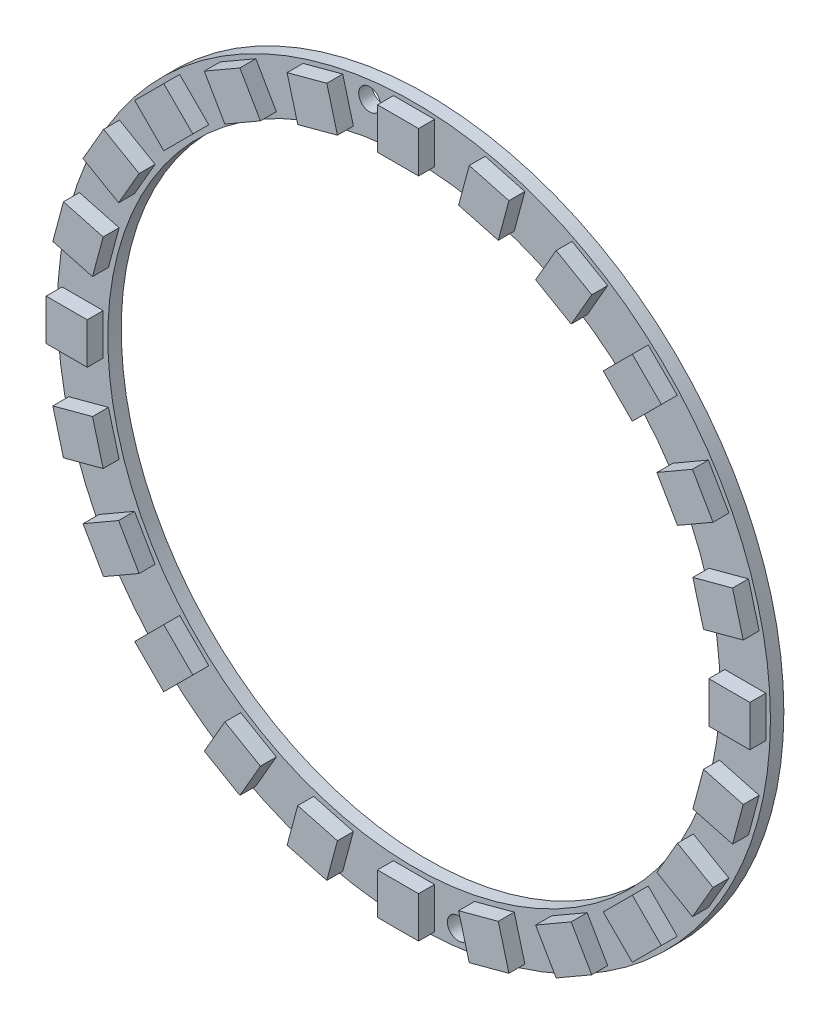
ISO-10303-21;
HEADER;
FILE_DESCRIPTION(('STEP AP214'),'2;1');
FILE_NAME('part.step','',(''),(''),'','','');
FILE_SCHEMA(('AUTOMOTIVE_DESIGN { 1 0 10303 214 1 1 1 1 }'));
ENDSEC;
DATA;
#1=APPLICATION_CONTEXT('core data for automotive mechanical design processes');
#2=APPLICATION_PROTOCOL_DEFINITION('international standard','automotive_design',2000,#1);
#3=PRODUCT_CONTEXT('',#1,'mechanical');
#4=PRODUCT('Part','Part','',(#3));
#5=PRODUCT_RELATED_PRODUCT_CATEGORY('part','',(#4));
#6=PRODUCT_DEFINITION_FORMATION('','',#4);
#7=PRODUCT_DEFINITION_CONTEXT('part definition',#1,'design');
#8=PRODUCT_DEFINITION('design','',#6,#7);
#9=PRODUCT_DEFINITION_SHAPE('','',#8);
#10=(LENGTH_UNIT() NAMED_UNIT(*) SI_UNIT(.MILLI.,.METRE.));
#11=(NAMED_UNIT(*) PLANE_ANGLE_UNIT() SI_UNIT($,.RADIAN.));
#12=(NAMED_UNIT(*) SI_UNIT($,.STERADIAN.) SOLID_ANGLE_UNIT());
#13=UNCERTAINTY_MEASURE_WITH_UNIT(LENGTH_MEASURE(1.E-05),#10,'distance_accuracy_value','');
#14=(GEOMETRIC_REPRESENTATION_CONTEXT(3) GLOBAL_UNCERTAINTY_ASSIGNED_CONTEXT((#13)) GLOBAL_UNIT_ASSIGNED_CONTEXT((#10,
#11,#12)) REPRESENTATION_CONTEXT('',''));
#15=CARTESIAN_POINT('',(0.,0.,0.));
#16=DIRECTION('',(0.,0.,1.));
#17=DIRECTION('',(1.,0.,0.));
#18=AXIS2_PLACEMENT_3D('',#15,#16,#17);
#19=CARTESIAN_POINT('',(0.,0.,1.6));
#20=DIRECTION('',(0.,0.,1.));
#21=DIRECTION('',(1.,0.,0.));
#22=AXIS2_PLACEMENT_3D('',#19,#20,#21);
#23=PLANE('',#22);
#24=CARTESIAN_POINT('',(-5.28631078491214,40.1535168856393,1.6));
#25=DIRECTION('',(0.,0.,1.));
#26=DIRECTION('',(1.,0.,0.));
#27=AXIS2_PLACEMENT_3D('',#24,#25,#26);
#28=CIRCLE('',#27,1.3);
#29=CARTESIAN_POINT('',(-3.98631078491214,40.1535168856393,1.6));
#30=VERTEX_POINT('',#29);
#31=EDGE_CURVE('E1371',#30,#30,#28,.T.);
#32=ORIENTED_EDGE('',*,*,#31,.F.);
#33=EDGE_LOOP('',(#32));
#34=FACE_BOUND('',#33,.T.);
#35=CARTESIAN_POINT('',(5.28631078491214,-40.1535168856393,1.6));
#36=DIRECTION('',(0.,0.,1.));
#37=DIRECTION('',(1.,0.,0.));
#38=AXIS2_PLACEMENT_3D('',#35,#36,#37);
#39=CIRCLE('',#38,1.3);
#40=CARTESIAN_POINT('',(6.58631078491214,-40.1535168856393,1.6));
#41=VERTEX_POINT('',#40);
#42=EDGE_CURVE('E1375',#41,#41,#39,.T.);
#43=ORIENTED_EDGE('',*,*,#42,.F.);
#44=EDGE_LOOP('',(#43));
#45=FACE_BOUND('',#44,.T.);
#46=CARTESIAN_POINT('',(0.,0.,1.6));
#47=DIRECTION('',(0.,0.,1.));
#48=DIRECTION('',(1.,0.,0.));
#49=AXIS2_PLACEMENT_3D('',#46,#47,#48);
#50=CIRCLE('',#49,42.5);
#51=CARTESIAN_POINT('',(42.5,0.,1.6));
#52=VERTEX_POINT('',#51);
#53=EDGE_CURVE('E11',#52,#52,#50,.T.);
#54=ORIENTED_EDGE('',*,*,#53,.T.);
#55=EDGE_LOOP('',(#54));
#56=FACE_BOUND('',#55,.T.);
#57=CARTESIAN_POINT('',(0.,0.,1.6));
#58=DIRECTION('',(0.,0.,1.));
#59=DIRECTION('',(1.,0.,0.));
#60=AXIS2_PLACEMENT_3D('',#57,#58,#59);
#61=CIRCLE('',#60,36.5);
#62=CARTESIAN_POINT('',(36.5,0.,1.6));
#63=VERTEX_POINT('',#62);
#64=EDGE_CURVE('E1340',#63,#63,#61,.T.);
#65=ORIENTED_EDGE('',*,*,#64,.F.);
#66=EDGE_LOOP('',(#65));
#67=FACE_BOUND('',#66,.T.);
#68=DIRECTION('',(-1.,0.,0.));
#69=VECTOR('',#68,1.);
#70=CARTESIAN_POINT('',(-2.45,41.95,1.6));
#71=LINE('',#70,#69);
#72=CARTESIAN_POINT('',(2.45,41.95,1.6));
#73=VERTEX_POINT('',#72);
#74=CARTESIAN_POINT('',(-2.45,41.95,1.6));
#75=VERTEX_POINT('',#74);
#76=EDGE_CURVE('E1324',#73,#75,#71,.T.);
#77=ORIENTED_EDGE('',*,*,#76,.F.);
#78=DIRECTION('',(0.,1.,0.));
#79=VECTOR('',#78,1.);
#80=CARTESIAN_POINT('',(2.45,37.05,1.6));
#81=LINE('',#80,#79);
#82=CARTESIAN_POINT('',(2.45,37.05,1.6));
#83=VERTEX_POINT('',#82);
#84=EDGE_CURVE('E1310',#83,#73,#81,.T.);
#85=ORIENTED_EDGE('',*,*,#84,.F.);
#86=DIRECTION('',(1.,0.,0.));
#87=VECTOR('',#86,1.);
#88=CARTESIAN_POINT('',(-2.45,37.05,1.6));
#89=LINE('',#88,#87);
#90=CARTESIAN_POINT('',(-2.45,37.05,1.6));
#91=VERTEX_POINT('',#90);
#92=EDGE_CURVE('E1315',#91,#83,#89,.T.);
#93=ORIENTED_EDGE('',*,*,#92,.F.);
#94=DIRECTION('',(0.,-1.,0.));
#95=VECTOR('',#94,1.);
#96=CARTESIAN_POINT('',(-2.45,37.05,1.6));
#97=LINE('',#96,#95);
#98=EDGE_CURVE('E1326',#75,#91,#97,.T.);
#99=ORIENTED_EDGE('',*,*,#98,.F.);
#100=EDGE_LOOP('',(#77,#85,#93,#99));
#101=FACE_BOUND('',#100,.T.);
#102=DIRECTION('',(-0.965925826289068,-0.258819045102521,0.));
#103=VECTOR('',#102,1.);
#104=CARTESIAN_POINT('',(-13.223977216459,39.8864817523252,1.6));
#105=LINE('',#104,#103);
#106=CARTESIAN_POINT('',(-8.49094066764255,41.1546950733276,1.6));
#107=VERTEX_POINT('',#106);
#108=CARTESIAN_POINT('',(-13.223977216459,39.8864817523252,1.6));
#109=VERTEX_POINT('',#108);
#110=EDGE_CURVE('E1295',#107,#109,#105,.T.);
#111=ORIENTED_EDGE('',*,*,#110,.F.);
#112=DIRECTION('',(-0.258819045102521,0.965925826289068,0.));
#113=VECTOR('',#112,1.);
#114=CARTESIAN_POINT('',(-7.2227273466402,36.4216585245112,1.6));
#115=LINE('',#114,#113);
#116=CARTESIAN_POINT('',(-7.2227273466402,36.4216585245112,1.6));
#117=VERTEX_POINT('',#116);
#118=EDGE_CURVE('E1281',#117,#107,#115,.T.);
#119=ORIENTED_EDGE('',*,*,#118,.F.);
#120=DIRECTION('',(0.965925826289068,0.258819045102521,0.));
#121=VECTOR('',#120,1.);
#122=CARTESIAN_POINT('',(-11.9557638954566,35.1534452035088,1.6));
#123=LINE('',#122,#121);
#124=CARTESIAN_POINT('',(-11.9557638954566,35.1534452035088,1.6));
#125=VERTEX_POINT('',#124);
#126=EDGE_CURVE('E1286',#125,#117,#123,.T.);
#127=ORIENTED_EDGE('',*,*,#126,.F.);
#128=DIRECTION('',(0.258819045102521,-0.965925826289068,0.));
#129=VECTOR('',#128,1.);
#130=CARTESIAN_POINT('',(-11.9557638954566,35.1534452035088,1.6));
#131=LINE('',#130,#129);
#132=EDGE_CURVE('E1297',#109,#125,#131,.T.);
#133=ORIENTED_EDGE('',*,*,#132,.F.);
#134=EDGE_LOOP('',(#111,#119,#127,#133));
#135=FACE_BOUND('',#134,.T.);
#136=DIRECTION('',(-0.866025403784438,-0.500000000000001,0.));
#137=VECTOR('',#136,1.);
#138=CARTESIAN_POINT('',(-23.0967622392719,35.1047656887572,1.6));
#139=LINE('',#138,#137);
#140=CARTESIAN_POINT('',(-18.8532377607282,37.5547656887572,1.6));
#141=VERTEX_POINT('',#140);
#142=CARTESIAN_POINT('',(-23.0967622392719,35.1047656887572,1.6));
#143=VERTEX_POINT('',#142);
#144=EDGE_CURVE('E1266',#141,#143,#139,.T.);
#145=ORIENTED_EDGE('',*,*,#144,.F.);
#146=DIRECTION('',(-0.500000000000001,0.866025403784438,0.));
#147=VECTOR('',#146,1.);
#148=CARTESIAN_POINT('',(-16.4032377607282,33.3112412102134,1.6));
#149=LINE('',#148,#147);
#150=CARTESIAN_POINT('',(-16.4032377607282,33.3112412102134,1.6));
#151=VERTEX_POINT('',#150);
#152=EDGE_CURVE('E1252',#151,#141,#149,.T.);
#153=ORIENTED_EDGE('',*,*,#152,.F.);
#154=DIRECTION('',(0.866025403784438,0.500000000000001,0.));
#155=VECTOR('',#154,1.);
#156=CARTESIAN_POINT('',(-20.6467622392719,30.8612412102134,1.6));
#157=LINE('',#156,#155);
#158=CARTESIAN_POINT('',(-20.6467622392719,30.8612412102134,1.6));
#159=VERTEX_POINT('',#158);
#160=EDGE_CURVE('E1257',#159,#151,#157,.T.);
#161=ORIENTED_EDGE('',*,*,#160,.F.);
#162=DIRECTION('',(0.500000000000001,-0.866025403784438,0.));
#163=VECTOR('',#162,1.);
#164=CARTESIAN_POINT('',(-20.6467622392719,30.8612412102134,1.6));
#165=LINE('',#164,#163);
#166=EDGE_CURVE('E1268',#143,#159,#165,.T.);
#167=ORIENTED_EDGE('',*,*,#166,.F.);
#168=EDGE_LOOP('',(#145,#153,#161,#167));
#169=FACE_BOUND('',#168,.T.);
#170=DIRECTION('',(-0.707106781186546,-0.707106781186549,0.));
#171=VECTOR('',#170,1.);
#172=CARTESIAN_POINT('',(-31.3955410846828,27.9307178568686,1.6));
#173=LINE('',#172,#171);
#174=CARTESIAN_POINT('',(-27.9307178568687,31.3955410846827,1.6));
#175=VERTEX_POINT('',#174);
#176=CARTESIAN_POINT('',(-31.3955410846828,27.9307178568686,1.6));
#177=VERTEX_POINT('',#176);
#178=EDGE_CURVE('E1237',#175,#177,#173,.T.);
#179=ORIENTED_EDGE('',*,*,#178,.F.);
#180=DIRECTION('',(-0.707106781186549,0.707106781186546,0.));
#181=VECTOR('',#180,1.);
#182=CARTESIAN_POINT('',(-24.4658946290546,27.9307178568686,1.6));
#183=LINE('',#182,#181);
#184=CARTESIAN_POINT('',(-24.4658946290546,27.9307178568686,1.6));
#185=VERTEX_POINT('',#184);
#186=EDGE_CURVE('E1223',#185,#175,#183,.T.);
#187=ORIENTED_EDGE('',*,*,#186,.F.);
#188=DIRECTION('',(0.707106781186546,0.707106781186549,0.));
#189=VECTOR('',#188,1.);
#190=CARTESIAN_POINT('',(-27.9307178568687,24.4658946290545,1.6));
#191=LINE('',#190,#189);
#192=CARTESIAN_POINT('',(-27.9307178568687,24.4658946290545,1.6));
#193=VERTEX_POINT('',#192);
#194=EDGE_CURVE('E1228',#193,#185,#191,.T.);
#195=ORIENTED_EDGE('',*,*,#194,.F.);
#196=DIRECTION('',(0.707106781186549,-0.707106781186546,0.));
#197=VECTOR('',#196,1.);
#198=CARTESIAN_POINT('',(-27.9307178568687,24.4658946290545,1.6));
#199=LINE('',#198,#197);
#200=EDGE_CURVE('E1239',#177,#193,#199,.T.);
#201=ORIENTED_EDGE('',*,*,#200,.F.);
#202=EDGE_LOOP('',(#179,#187,#195,#201));
#203=FACE_BOUND('',#202,.T.);
#204=DIRECTION('',(-0.499999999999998,-0.86602540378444,0.));
#205=VECTOR('',#204,1.);
#206=CARTESIAN_POINT('',(-37.5547656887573,18.853237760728,1.6));
#207=LINE('',#206,#205);
#208=CARTESIAN_POINT('',(-35.1047656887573,23.0967622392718,1.6));
#209=VERTEX_POINT('',#208);
#210=CARTESIAN_POINT('',(-37.5547656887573,18.853237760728,1.6));
#211=VERTEX_POINT('',#210);
#212=EDGE_CURVE('E1208',#209,#211,#207,.T.);
#213=ORIENTED_EDGE('',*,*,#212,.F.);
#214=DIRECTION('',(-0.86602540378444,0.499999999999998,0.));
#215=VECTOR('',#214,1.);
#216=CARTESIAN_POINT('',(-30.8612412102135,20.6467622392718,1.6));
#217=LINE('',#216,#215);
#218=CARTESIAN_POINT('',(-30.8612412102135,20.6467622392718,1.6));
#219=VERTEX_POINT('',#218);
#220=EDGE_CURVE('E1194',#219,#209,#217,.T.);
#221=ORIENTED_EDGE('',*,*,#220,.F.);
#222=DIRECTION('',(0.499999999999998,0.86602540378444,0.));
#223=VECTOR('',#222,1.);
#224=CARTESIAN_POINT('',(-33.3112412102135,16.4032377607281,1.6));
#225=LINE('',#224,#223);
#226=CARTESIAN_POINT('',(-33.3112412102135,16.4032377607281,1.6));
#227=VERTEX_POINT('',#226);
#228=EDGE_CURVE('E1199',#227,#219,#225,.T.);
#229=ORIENTED_EDGE('',*,*,#228,.F.);
#230=DIRECTION('',(0.86602540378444,-0.499999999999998,0.));
#231=VECTOR('',#230,1.);
#232=CARTESIAN_POINT('',(-33.3112412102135,16.4032377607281,1.6));
#233=LINE('',#232,#231);
#234=EDGE_CURVE('E1210',#211,#227,#233,.T.);
#235=ORIENTED_EDGE('',*,*,#234,.F.);
#236=EDGE_LOOP('',(#213,#221,#229,#235));
#237=FACE_BOUND('',#236,.T.);
#238=DIRECTION('',(-0.258819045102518,-0.965925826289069,0.));
#239=VECTOR('',#238,1.);
#240=CARTESIAN_POINT('',(-41.1546950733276,8.49094066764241,1.6));
#241=LINE('',#240,#239);
#242=CARTESIAN_POINT('',(-39.8864817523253,13.2239772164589,1.6));
#243=VERTEX_POINT('',#242);
#244=CARTESIAN_POINT('',(-41.1546950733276,8.49094066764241,1.6));
#245=VERTEX_POINT('',#244);
#246=EDGE_CURVE('E1179',#243,#245,#241,.T.);
#247=ORIENTED_EDGE('',*,*,#246,.F.);
#248=DIRECTION('',(-0.965925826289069,0.258819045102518,0.));
#249=VECTOR('',#248,1.);
#250=CARTESIAN_POINT('',(-35.1534452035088,11.9557638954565,1.6));
#251=LINE('',#250,#249);
#252=CARTESIAN_POINT('',(-35.1534452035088,11.9557638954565,1.6));
#253=VERTEX_POINT('',#252);
#254=EDGE_CURVE('E1165',#253,#243,#251,.T.);
#255=ORIENTED_EDGE('',*,*,#254,.F.);
#256=DIRECTION('',(0.258819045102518,0.965925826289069,0.));
#257=VECTOR('',#256,1.);
#258=CARTESIAN_POINT('',(-36.4216585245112,7.22272734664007,1.6));
#259=LINE('',#258,#257);
#260=CARTESIAN_POINT('',(-36.4216585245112,7.22272734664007,1.6));
#261=VERTEX_POINT('',#260);
#262=EDGE_CURVE('E1170',#261,#253,#259,.T.);
#263=ORIENTED_EDGE('',*,*,#262,.F.);
#264=DIRECTION('',(0.965925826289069,-0.258819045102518,0.));
#265=VECTOR('',#264,1.);
#266=CARTESIAN_POINT('',(-36.4216585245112,7.22272734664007,1.6));
#267=LINE('',#266,#265);
#268=EDGE_CURVE('E1181',#245,#261,#267,.T.);
#269=ORIENTED_EDGE('',*,*,#268,.F.);
#270=EDGE_LOOP('',(#247,#255,#263,#269));
#271=FACE_BOUND('',#270,.T.);
#272=DIRECTION('',(0.,-1.,0.));
#273=VECTOR('',#272,1.);
#274=CARTESIAN_POINT('',(-41.95,-2.45000000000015,1.6));
#275=LINE('',#274,#273);
#276=CARTESIAN_POINT('',(-41.95,2.44999999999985,1.6));
#277=VERTEX_POINT('',#276);
#278=CARTESIAN_POINT('',(-41.95,-2.45000000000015,1.6));
#279=VERTEX_POINT('',#278);
#280=EDGE_CURVE('E1150',#277,#279,#275,.T.);
#281=ORIENTED_EDGE('',*,*,#280,.F.);
#282=DIRECTION('',(-1.,0.,0.));
#283=VECTOR('',#282,1.);
#284=CARTESIAN_POINT('',(-37.05,2.44999999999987,1.6));
#285=LINE('',#284,#283);
#286=CARTESIAN_POINT('',(-37.05,2.44999999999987,1.6));
#287=VERTEX_POINT('',#286);
#288=EDGE_CURVE('E1136',#287,#277,#285,.T.);
#289=ORIENTED_EDGE('',*,*,#288,.F.);
#290=DIRECTION('',(0.,1.,0.));
#291=VECTOR('',#290,1.);
#292=CARTESIAN_POINT('',(-37.05,-2.45000000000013,1.6));
#293=LINE('',#292,#291);
#294=CARTESIAN_POINT('',(-37.05,-2.45000000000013,1.6));
#295=VERTEX_POINT('',#294);
#296=EDGE_CURVE('E1141',#295,#287,#293,.T.);
#297=ORIENTED_EDGE('',*,*,#296,.F.);
#298=DIRECTION('',(1.,0.,0.));
#299=VECTOR('',#298,1.);
#300=CARTESIAN_POINT('',(-37.05,-2.45000000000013,1.6));
#301=LINE('',#300,#299);
#302=EDGE_CURVE('E1152',#279,#295,#301,.T.);
#303=ORIENTED_EDGE('',*,*,#302,.F.);
#304=EDGE_LOOP('',(#281,#289,#297,#303));
#305=FACE_BOUND('',#304,.T.);
#306=DIRECTION('',(0.258819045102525,-0.965925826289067,0.));
#307=VECTOR('',#306,1.);
#308=CARTESIAN_POINT('',(-39.8864817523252,-13.2239772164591,1.6));
#309=LINE('',#308,#307);
#310=CARTESIAN_POINT('',(-41.1546950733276,-8.4909406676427,1.6));
#311=VERTEX_POINT('',#310);
#312=CARTESIAN_POINT('',(-39.8864817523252,-13.2239772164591,1.6));
#313=VERTEX_POINT('',#312);
#314=EDGE_CURVE('E1121',#311,#313,#309,.T.);
#315=ORIENTED_EDGE('',*,*,#314,.F.);
#316=DIRECTION('',(-0.965925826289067,-0.258819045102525,0.));
#317=VECTOR('',#316,1.);
#318=CARTESIAN_POINT('',(-36.4216585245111,-7.22272734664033,1.6));
#319=LINE('',#318,#317);
#320=CARTESIAN_POINT('',(-36.4216585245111,-7.22272734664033,1.6));
#321=VERTEX_POINT('',#320);
#322=EDGE_CURVE('E1107',#321,#311,#319,.T.);
#323=ORIENTED_EDGE('',*,*,#322,.F.);
#324=DIRECTION('',(-0.258819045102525,0.965925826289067,0.));
#325=VECTOR('',#324,1.);
#326=CARTESIAN_POINT('',(-35.1534452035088,-11.9557638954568,1.6));
#327=LINE('',#326,#325);
#328=CARTESIAN_POINT('',(-35.1534452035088,-11.9557638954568,1.6));
#329=VERTEX_POINT('',#328);
#330=EDGE_CURVE('E1112',#329,#321,#327,.T.);
#331=ORIENTED_EDGE('',*,*,#330,.F.);
#332=DIRECTION('',(0.965925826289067,0.258819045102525,0.));
#333=VECTOR('',#332,1.);
#334=CARTESIAN_POINT('',(-35.1534452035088,-11.9557638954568,1.6));
#335=LINE('',#334,#333);
#336=EDGE_CURVE('E1123',#313,#329,#335,.T.);
#337=ORIENTED_EDGE('',*,*,#336,.F.);
#338=EDGE_LOOP('',(#315,#323,#331,#337));
#339=FACE_BOUND('',#338,.T.);
#340=DIRECTION('',(0.500000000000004,-0.866025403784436,0.));
#341=VECTOR('',#340,1.);
#342=CARTESIAN_POINT('',(-35.1047656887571,-23.096762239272,1.6));
#343=LINE('',#342,#341);
#344=CARTESIAN_POINT('',(-37.5547656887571,-18.8532377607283,1.6));
#345=VERTEX_POINT('',#344);
#346=CARTESIAN_POINT('',(-35.1047656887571,-23.096762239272,1.6));
#347=VERTEX_POINT('',#346);
#348=EDGE_CURVE('E1092',#345,#347,#343,.T.);
#349=ORIENTED_EDGE('',*,*,#348,.F.);
#350=DIRECTION('',(-0.866025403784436,-0.500000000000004,0.));
#351=VECTOR('',#350,1.);
#352=CARTESIAN_POINT('',(-33.3112412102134,-16.4032377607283,1.6));
#353=LINE('',#352,#351);
#354=CARTESIAN_POINT('',(-33.3112412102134,-16.4032377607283,1.6));
#355=VERTEX_POINT('',#354);
#356=EDGE_CURVE('E1078',#355,#345,#353,.T.);
#357=ORIENTED_EDGE('',*,*,#356,.F.);
#358=DIRECTION('',(-0.500000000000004,0.866025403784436,0.));
#359=VECTOR('',#358,1.);
#360=CARTESIAN_POINT('',(-30.8612412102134,-20.646762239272,1.6));
#361=LINE('',#360,#359);
#362=CARTESIAN_POINT('',(-30.8612412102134,-20.646762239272,1.6));
#363=VERTEX_POINT('',#362);
#364=EDGE_CURVE('E1083',#363,#355,#361,.T.);
#365=ORIENTED_EDGE('',*,*,#364,.F.);
#366=DIRECTION('',(0.866025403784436,0.500000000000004,0.));
#367=VECTOR('',#366,1.);
#368=CARTESIAN_POINT('',(-30.8612412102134,-20.646762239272,1.6));
#369=LINE('',#368,#367);
#370=EDGE_CURVE('E1094',#347,#363,#369,.T.);
#371=ORIENTED_EDGE('',*,*,#370,.F.);
#372=EDGE_LOOP('',(#349,#357,#365,#371));
#373=FACE_BOUND('',#372,.T.);
#374=DIRECTION('',(0.707106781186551,-0.707106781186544,0.));
#375=VECTOR('',#374,1.);
#376=CARTESIAN_POINT('',(-27.9307178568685,-31.3955410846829,1.6));
#377=LINE('',#376,#375);
#378=CARTESIAN_POINT('',(-31.3955410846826,-27.9307178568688,1.6));
#379=VERTEX_POINT('',#378);
#380=CARTESIAN_POINT('',(-27.9307178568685,-31.3955410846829,1.6));
#381=VERTEX_POINT('',#380);
#382=EDGE_CURVE('E1063',#379,#381,#377,.T.);
#383=ORIENTED_EDGE('',*,*,#382,.F.);
#384=DIRECTION('',(-0.707106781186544,-0.707106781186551,0.));
#385=VECTOR('',#384,1.);
#386=CARTESIAN_POINT('',(-27.9307178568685,-24.4658946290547,1.6));
#387=LINE('',#386,#385);
#388=CARTESIAN_POINT('',(-27.9307178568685,-24.4658946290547,1.6));
#389=VERTEX_POINT('',#388);
#390=EDGE_CURVE('E1049',#389,#379,#387,.T.);
#391=ORIENTED_EDGE('',*,*,#390,.F.);
#392=DIRECTION('',(-0.707106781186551,0.707106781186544,0.));
#393=VECTOR('',#392,1.);
#394=CARTESIAN_POINT('',(-24.4658946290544,-27.9307178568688,1.6));
#395=LINE('',#394,#393);
#396=CARTESIAN_POINT('',(-24.4658946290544,-27.9307178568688,1.6));
#397=VERTEX_POINT('',#396);
#398=EDGE_CURVE('E1054',#397,#389,#395,.T.);
#399=ORIENTED_EDGE('',*,*,#398,.F.);
#400=DIRECTION('',(0.707106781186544,0.707106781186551,0.));
#401=VECTOR('',#400,1.);
#402=CARTESIAN_POINT('',(-24.4658946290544,-27.9307178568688,1.6));
#403=LINE('',#402,#401);
#404=EDGE_CURVE('E1065',#381,#397,#403,.T.);
#405=ORIENTED_EDGE('',*,*,#404,.F.);
#406=EDGE_LOOP('',(#383,#391,#399,#405));
#407=FACE_BOUND('',#406,.T.);
#408=DIRECTION('',(0.866025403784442,-0.499999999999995,0.));
#409=VECTOR('',#408,1.);
#410=CARTESIAN_POINT('',(-18.8532377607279,-37.5547656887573,1.6));
#411=LINE('',#410,#409);
#412=CARTESIAN_POINT('',(-23.0967622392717,-35.1047656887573,1.6));
#413=VERTEX_POINT('',#412);
#414=CARTESIAN_POINT('',(-18.8532377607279,-37.5547656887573,1.6));
#415=VERTEX_POINT('',#414);
#416=EDGE_CURVE('E1034',#413,#415,#411,.T.);
#417=ORIENTED_EDGE('',*,*,#416,.F.);
#418=DIRECTION('',(-0.499999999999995,-0.866025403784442,0.));
#419=VECTOR('',#418,1.);
#420=CARTESIAN_POINT('',(-20.6467622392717,-30.8612412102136,1.6));
#421=LINE('',#420,#419);
#422=CARTESIAN_POINT('',(-20.6467622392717,-30.8612412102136,1.6));
#423=VERTEX_POINT('',#422);
#424=EDGE_CURVE('E1020',#423,#413,#421,.T.);
#425=ORIENTED_EDGE('',*,*,#424,.F.);
#426=DIRECTION('',(-0.866025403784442,0.499999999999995,0.));
#427=VECTOR('',#426,1.);
#428=CARTESIAN_POINT('',(-16.4032377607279,-33.3112412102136,1.6));
#429=LINE('',#428,#427);
#430=CARTESIAN_POINT('',(-16.4032377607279,-33.3112412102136,1.6));
#431=VERTEX_POINT('',#430);
#432=EDGE_CURVE('E1025',#431,#423,#429,.T.);
#433=ORIENTED_EDGE('',*,*,#432,.F.);
#434=DIRECTION('',(0.499999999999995,0.866025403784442,0.));
#435=VECTOR('',#434,1.);
#436=CARTESIAN_POINT('',(-16.4032377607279,-33.3112412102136,1.6));
#437=LINE('',#436,#435);
#438=EDGE_CURVE('E1036',#415,#431,#437,.T.);
#439=ORIENTED_EDGE('',*,*,#438,.F.);
#440=EDGE_LOOP('',(#417,#425,#433,#439));
#441=FACE_BOUND('',#440,.T.);
#442=DIRECTION('',(0.96592582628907,-0.258819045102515,0.));
#443=VECTOR('',#442,1.);
#444=CARTESIAN_POINT('',(-8.49094066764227,-41.1546950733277,1.6));
#445=LINE('',#444,#443);
#446=CARTESIAN_POINT('',(-13.2239772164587,-39.8864817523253,1.6));
#447=VERTEX_POINT('',#446);
#448=CARTESIAN_POINT('',(-8.49094066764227,-41.1546950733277,1.6));
#449=VERTEX_POINT('',#448);
#450=EDGE_CURVE('E1005',#447,#449,#445,.T.);
#451=ORIENTED_EDGE('',*,*,#450,.F.);
#452=DIRECTION('',(-0.258819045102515,-0.96592582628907,0.));
#453=VECTOR('',#452,1.);
#454=CARTESIAN_POINT('',(-11.9557638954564,-35.1534452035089,1.6));
#455=LINE('',#454,#453);
#456=CARTESIAN_POINT('',(-11.9557638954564,-35.1534452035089,1.6));
#457=VERTEX_POINT('',#456);
#458=EDGE_CURVE('E991',#457,#447,#455,.T.);
#459=ORIENTED_EDGE('',*,*,#458,.F.);
#460=DIRECTION('',(-0.96592582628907,0.258819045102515,0.));
#461=VECTOR('',#460,1.);
#462=CARTESIAN_POINT('',(-7.22272734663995,-36.4216585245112,1.6));
#463=LINE('',#462,#461);
#464=CARTESIAN_POINT('',(-7.22272734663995,-36.4216585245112,1.6));
#465=VERTEX_POINT('',#464);
#466=EDGE_CURVE('E996',#465,#457,#463,.T.);
#467=ORIENTED_EDGE('',*,*,#466,.F.);
#468=DIRECTION('',(0.258819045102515,0.96592582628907,0.));
#469=VECTOR('',#468,1.);
#470=CARTESIAN_POINT('',(-7.22272734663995,-36.4216585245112,1.6));
#471=LINE('',#470,#469);
#472=EDGE_CURVE('E1007',#449,#465,#471,.T.);
#473=ORIENTED_EDGE('',*,*,#472,.F.);
#474=EDGE_LOOP('',(#451,#459,#467,#473));
#475=FACE_BOUND('',#474,.T.);
#476=DIRECTION('',(1.,0.,0.));
#477=VECTOR('',#476,1.);
#478=CARTESIAN_POINT('',(2.45,-41.95,1.6));
#479=LINE('',#478,#477);
#480=CARTESIAN_POINT('',(-2.45,-41.95,1.6));
#481=VERTEX_POINT('',#480);
#482=CARTESIAN_POINT('',(2.45,-41.95,1.6));
#483=VERTEX_POINT('',#482);
#484=EDGE_CURVE('E976',#481,#483,#479,.T.);
#485=ORIENTED_EDGE('',*,*,#484,.F.);
#486=DIRECTION('',(0.,-1.,0.));
#487=VECTOR('',#486,1.);
#488=CARTESIAN_POINT('',(-2.45,-37.05,1.6));
#489=LINE('',#488,#487);
#490=CARTESIAN_POINT('',(-2.45,-37.05,1.6));
#491=VERTEX_POINT('',#490);
#492=EDGE_CURVE('E962',#491,#481,#489,.T.);
#493=ORIENTED_EDGE('',*,*,#492,.F.);
#494=DIRECTION('',(-1.,0.,0.));
#495=VECTOR('',#494,1.);
#496=CARTESIAN_POINT('',(2.45,-37.05,1.6));
#497=LINE('',#496,#495);
#498=CARTESIAN_POINT('',(2.45,-37.05,1.6));
#499=VERTEX_POINT('',#498);
#500=EDGE_CURVE('E967',#499,#491,#497,.T.);
#501=ORIENTED_EDGE('',*,*,#500,.F.);
#502=DIRECTION('',(0.,1.,0.));
#503=VECTOR('',#502,1.);
#504=CARTESIAN_POINT('',(2.45,-37.05,1.6));
#505=LINE('',#504,#503);
#506=EDGE_CURVE('E978',#483,#499,#505,.T.);
#507=ORIENTED_EDGE('',*,*,#506,.F.);
#508=EDGE_LOOP('',(#485,#493,#501,#507));
#509=FACE_BOUND('',#508,.T.);
#510=DIRECTION('',(0.965925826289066,0.258819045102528,0.));
#511=VECTOR('',#510,1.);
#512=CARTESIAN_POINT('',(13.2239772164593,-39.8864817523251,1.6));
#513=LINE('',#512,#511);
#514=CARTESIAN_POINT('',(8.49094066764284,-41.1546950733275,1.6));
#515=VERTEX_POINT('',#514);
#516=CARTESIAN_POINT('',(13.2239772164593,-39.8864817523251,1.6));
#517=VERTEX_POINT('',#516);
#518=EDGE_CURVE('E947',#515,#517,#513,.T.);
#519=ORIENTED_EDGE('',*,*,#518,.F.);
#520=DIRECTION('',(0.258819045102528,-0.965925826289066,0.));
#521=VECTOR('',#520,1.);
#522=CARTESIAN_POINT('',(7.22272734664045,-36.4216585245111,1.6));
#523=LINE('',#522,#521);
#524=CARTESIAN_POINT('',(7.22272734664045,-36.4216585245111,1.6));
#525=VERTEX_POINT('',#524);
#526=EDGE_CURVE('E933',#525,#515,#523,.T.);
#527=ORIENTED_EDGE('',*,*,#526,.F.);
#528=DIRECTION('',(-0.965925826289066,-0.258819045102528,0.));
#529=VECTOR('',#528,1.);
#530=CARTESIAN_POINT('',(11.9557638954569,-35.1534452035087,1.6));
#531=LINE('',#530,#529);
#532=CARTESIAN_POINT('',(11.9557638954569,-35.1534452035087,1.6));
#533=VERTEX_POINT('',#532);
#534=EDGE_CURVE('E938',#533,#525,#531,.T.);
#535=ORIENTED_EDGE('',*,*,#534,.F.);
#536=DIRECTION('',(-0.258819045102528,0.965925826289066,0.));
#537=VECTOR('',#536,1.);
#538=CARTESIAN_POINT('',(11.9557638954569,-35.1534452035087,1.6));
#539=LINE('',#538,#537);
#540=EDGE_CURVE('E949',#517,#533,#539,.T.);
#541=ORIENTED_EDGE('',*,*,#540,.F.);
#542=EDGE_LOOP('',(#519,#527,#535,#541));
#543=FACE_BOUND('',#542,.T.);
#544=DIRECTION('',(0.866025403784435,0.500000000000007,0.));
#545=VECTOR('',#544,1.);
#546=CARTESIAN_POINT('',(23.0967622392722,-35.104765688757,1.6));
#547=LINE('',#546,#545);
#548=CARTESIAN_POINT('',(18.8532377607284,-37.5547656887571,1.6));
#549=VERTEX_POINT('',#548);
#550=CARTESIAN_POINT('',(23.0967622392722,-35.104765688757,1.6));
#551=VERTEX_POINT('',#550);
#552=EDGE_CURVE('E918',#549,#551,#547,.T.);
#553=ORIENTED_EDGE('',*,*,#552,.F.);
#554=DIRECTION('',(0.500000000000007,-0.866025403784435,0.));
#555=VECTOR('',#554,1.);
#556=CARTESIAN_POINT('',(16.4032377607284,-33.3112412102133,1.6));
#557=LINE('',#556,#555);
#558=CARTESIAN_POINT('',(16.4032377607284,-33.3112412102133,1.6));
#559=VERTEX_POINT('',#558);
#560=EDGE_CURVE('E904',#559,#549,#557,.T.);
#561=ORIENTED_EDGE('',*,*,#560,.F.);
#562=DIRECTION('',(-0.866025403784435,-0.500000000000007,0.));
#563=VECTOR('',#562,1.);
#564=CARTESIAN_POINT('',(20.6467622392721,-30.8612412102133,1.6));
#565=LINE('',#564,#563);
#566=CARTESIAN_POINT('',(20.6467622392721,-30.8612412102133,1.6));
#567=VERTEX_POINT('',#566);
#568=EDGE_CURVE('E909',#567,#559,#565,.T.);
#569=ORIENTED_EDGE('',*,*,#568,.F.);
#570=DIRECTION('',(-0.500000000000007,0.866025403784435,0.));
#571=VECTOR('',#570,1.);
#572=CARTESIAN_POINT('',(20.6467622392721,-30.8612412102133,1.6));
#573=LINE('',#572,#571);
#574=EDGE_CURVE('E920',#551,#567,#573,.T.);
#575=ORIENTED_EDGE('',*,*,#574,.F.);
#576=EDGE_LOOP('',(#553,#561,#569,#575));
#577=FACE_BOUND('',#576,.T.);
#578=DIRECTION('',(0.707106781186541,0.707106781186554,0.));
#579=VECTOR('',#578,1.);
#580=CARTESIAN_POINT('',(31.395541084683,-27.9307178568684,1.6));
#581=LINE('',#580,#579);
#582=CARTESIAN_POINT('',(27.9307178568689,-31.3955410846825,1.6));
#583=VERTEX_POINT('',#582);
#584=CARTESIAN_POINT('',(31.395541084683,-27.9307178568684,1.6));
#585=VERTEX_POINT('',#584);
#586=EDGE_CURVE('E889',#583,#585,#581,.T.);
#587=ORIENTED_EDGE('',*,*,#586,.F.);
#588=DIRECTION('',(0.707106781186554,-0.707106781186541,0.));
#589=VECTOR('',#588,1.);
#590=CARTESIAN_POINT('',(24.4658946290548,-27.9307178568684,1.6));
#591=LINE('',#590,#589);
#592=CARTESIAN_POINT('',(24.4658946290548,-27.9307178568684,1.6));
#593=VERTEX_POINT('',#592);
#594=EDGE_CURVE('E875',#593,#583,#591,.T.);
#595=ORIENTED_EDGE('',*,*,#594,.F.);
#596=DIRECTION('',(-0.707106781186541,-0.707106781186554,0.));
#597=VECTOR('',#596,1.);
#598=CARTESIAN_POINT('',(27.9307178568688,-24.4658946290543,1.6));
#599=LINE('',#598,#597);
#600=CARTESIAN_POINT('',(27.9307178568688,-24.4658946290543,1.6));
#601=VERTEX_POINT('',#600);
#602=EDGE_CURVE('E880',#601,#593,#599,.T.);
#603=ORIENTED_EDGE('',*,*,#602,.F.);
#604=DIRECTION('',(-0.707106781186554,0.707106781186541,0.));
#605=VECTOR('',#604,1.);
#606=CARTESIAN_POINT('',(27.9307178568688,-24.4658946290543,1.6));
#607=LINE('',#606,#605);
#608=EDGE_CURVE('E891',#585,#601,#607,.T.);
#609=ORIENTED_EDGE('',*,*,#608,.F.);
#610=EDGE_LOOP('',(#587,#595,#603,#609));
#611=FACE_BOUND('',#610,.T.);
#612=DIRECTION('',(0.499999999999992,0.866025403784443,0.));
#613=VECTOR('',#612,1.);
#614=CARTESIAN_POINT('',(37.5547656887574,-18.8532377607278,1.6));
#615=LINE('',#614,#613);
#616=CARTESIAN_POINT('',(35.1047656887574,-23.0967622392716,1.6));
#617=VERTEX_POINT('',#616);
#618=CARTESIAN_POINT('',(37.5547656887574,-18.8532377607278,1.6));
#619=VERTEX_POINT('',#618);
#620=EDGE_CURVE('E860',#617,#619,#615,.T.);
#621=ORIENTED_EDGE('',*,*,#620,.F.);
#622=DIRECTION('',(0.866025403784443,-0.499999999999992,0.));
#623=VECTOR('',#622,1.);
#624=CARTESIAN_POINT('',(30.8612412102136,-20.6467622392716,1.6));
#625=LINE('',#624,#623);
#626=CARTESIAN_POINT('',(30.8612412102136,-20.6467622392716,1.6));
#627=VERTEX_POINT('',#626);
#628=EDGE_CURVE('E846',#627,#617,#625,.T.);
#629=ORIENTED_EDGE('',*,*,#628,.F.);
#630=DIRECTION('',(-0.499999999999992,-0.866025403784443,0.));
#631=VECTOR('',#630,1.);
#632=CARTESIAN_POINT('',(33.3112412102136,-16.4032377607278,1.6));
#633=LINE('',#632,#631);
#634=CARTESIAN_POINT('',(33.3112412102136,-16.4032377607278,1.6));
#635=VERTEX_POINT('',#634);
#636=EDGE_CURVE('E851',#635,#627,#633,.T.);
#637=ORIENTED_EDGE('',*,*,#636,.F.);
#638=DIRECTION('',(-0.866025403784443,0.499999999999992,0.));
#639=VECTOR('',#638,1.);
#640=CARTESIAN_POINT('',(33.3112412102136,-16.4032377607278,1.6));
#641=LINE('',#640,#639);
#642=EDGE_CURVE('E862',#619,#635,#641,.T.);
#643=ORIENTED_EDGE('',*,*,#642,.F.);
#644=EDGE_LOOP('',(#621,#629,#637,#643));
#645=FACE_BOUND('',#644,.T.);
#646=DIRECTION('',(0.258819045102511,0.965925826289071,0.));
#647=VECTOR('',#646,1.);
#648=CARTESIAN_POINT('',(41.1546950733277,-8.49094066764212,1.6));
#649=LINE('',#648,#647);
#650=CARTESIAN_POINT('',(39.8864817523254,-13.2239772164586,1.6));
#651=VERTEX_POINT('',#650);
#652=CARTESIAN_POINT('',(41.1546950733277,-8.49094066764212,1.6));
#653=VERTEX_POINT('',#652);
#654=EDGE_CURVE('E831',#651,#653,#649,.T.);
#655=ORIENTED_EDGE('',*,*,#654,.F.);
#656=DIRECTION('',(0.965925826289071,-0.258819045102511,0.));
#657=VECTOR('',#656,1.);
#658=CARTESIAN_POINT('',(35.1534452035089,-11.9557638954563,1.6));
#659=LINE('',#658,#657);
#660=CARTESIAN_POINT('',(35.1534452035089,-11.9557638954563,1.6));
#661=VERTEX_POINT('',#660);
#662=EDGE_CURVE('E817',#661,#651,#659,.T.);
#663=ORIENTED_EDGE('',*,*,#662,.F.);
#664=DIRECTION('',(-0.258819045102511,-0.965925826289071,0.));
#665=VECTOR('',#664,1.);
#666=CARTESIAN_POINT('',(36.4216585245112,-7.22272734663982,1.6));
#667=LINE('',#666,#665);
#668=CARTESIAN_POINT('',(36.4216585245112,-7.22272734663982,1.6));
#669=VERTEX_POINT('',#668);
#670=EDGE_CURVE('E822',#669,#661,#667,.T.);
#671=ORIENTED_EDGE('',*,*,#670,.F.);
#672=DIRECTION('',(-0.965925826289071,0.258819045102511,0.));
#673=VECTOR('',#672,1.);
#674=CARTESIAN_POINT('',(36.4216585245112,-7.22272734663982,1.6));
#675=LINE('',#674,#673);
#676=EDGE_CURVE('E833',#653,#669,#675,.T.);
#677=ORIENTED_EDGE('',*,*,#676,.F.);
#678=EDGE_LOOP('',(#655,#663,#671,#677));
#679=FACE_BOUND('',#678,.T.);
#680=DIRECTION('',(0.,1.,0.));
#681=VECTOR('',#680,1.);
#682=CARTESIAN_POINT('',(41.95,2.45000000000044,1.6));
#683=LINE('',#682,#681);
#684=CARTESIAN_POINT('',(41.95,-2.44999999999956,1.6));
#685=VERTEX_POINT('',#684);
#686=CARTESIAN_POINT('',(41.95,2.45000000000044,1.6));
#687=VERTEX_POINT('',#686);
#688=EDGE_CURVE('E802',#685,#687,#683,.T.);
#689=ORIENTED_EDGE('',*,*,#688,.F.);
#690=DIRECTION('',(1.,0.,0.));
#691=VECTOR('',#690,1.);
#692=CARTESIAN_POINT('',(37.05,-2.44999999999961,1.6));
#693=LINE('',#692,#691);
#694=CARTESIAN_POINT('',(37.05,-2.44999999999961,1.6));
#695=VERTEX_POINT('',#694);
#696=EDGE_CURVE('E788',#695,#685,#693,.T.);
#697=ORIENTED_EDGE('',*,*,#696,.F.);
#698=DIRECTION('',(0.,-1.,0.));
#699=VECTOR('',#698,1.);
#700=CARTESIAN_POINT('',(37.05,2.45000000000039,1.6));
#701=LINE('',#700,#699);
#702=CARTESIAN_POINT('',(37.05,2.45000000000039,1.6));
#703=VERTEX_POINT('',#702);
#704=EDGE_CURVE('E793',#703,#695,#701,.T.);
#705=ORIENTED_EDGE('',*,*,#704,.F.);
#706=DIRECTION('',(-1.,0.,0.));
#707=VECTOR('',#706,1.);
#708=CARTESIAN_POINT('',(37.05,2.45000000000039,1.6));
#709=LINE('',#708,#707);
#710=EDGE_CURVE('E804',#687,#703,#709,.T.);
#711=ORIENTED_EDGE('',*,*,#710,.F.);
#712=EDGE_LOOP('',(#689,#697,#705,#711));
#713=FACE_BOUND('',#712,.T.);
#714=DIRECTION('',(-0.258819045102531,0.965925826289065,0.));
#715=VECTOR('',#714,1.);
#716=CARTESIAN_POINT('',(39.8864817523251,13.2239772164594,1.6));
#717=LINE('',#716,#715);
#718=CARTESIAN_POINT('',(41.1546950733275,8.49094066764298,1.6));
#719=VERTEX_POINT('',#718);
#720=CARTESIAN_POINT('',(39.8864817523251,13.2239772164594,1.6));
#721=VERTEX_POINT('',#720);
#722=EDGE_CURVE('E773',#719,#721,#717,.T.);
#723=ORIENTED_EDGE('',*,*,#722,.F.);
#724=DIRECTION('',(0.965925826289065,0.258819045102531,0.));
#725=VECTOR('',#724,1.);
#726=CARTESIAN_POINT('',(36.4216585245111,7.22272734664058,1.6));
#727=LINE('',#726,#725);
#728=CARTESIAN_POINT('',(36.4216585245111,7.22272734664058,1.6));
#729=VERTEX_POINT('',#728);
#730=EDGE_CURVE('E759',#729,#719,#727,.T.);
#731=ORIENTED_EDGE('',*,*,#730,.F.);
#732=DIRECTION('',(0.258819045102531,-0.965925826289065,0.));
#733=VECTOR('',#732,1.);
#734=CARTESIAN_POINT('',(35.1534452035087,11.955763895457,1.6));
#735=LINE('',#734,#733);
#736=CARTESIAN_POINT('',(35.1534452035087,11.955763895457,1.6));
#737=VERTEX_POINT('',#736);
#738=EDGE_CURVE('E764',#737,#729,#735,.T.);
#739=ORIENTED_EDGE('',*,*,#738,.F.);
#740=DIRECTION('',(-0.965925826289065,-0.258819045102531,0.));
#741=VECTOR('',#740,1.);
#742=CARTESIAN_POINT('',(35.1534452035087,11.955763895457,1.6));
#743=LINE('',#742,#741);
#744=EDGE_CURVE('E775',#721,#737,#743,.T.);
#745=ORIENTED_EDGE('',*,*,#744,.F.);
#746=EDGE_LOOP('',(#723,#731,#739,#745));
#747=FACE_BOUND('',#746,.T.);
#748=DIRECTION('',(-0.50000000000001,0.866025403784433,0.));
#749=VECTOR('',#748,1.);
#750=CARTESIAN_POINT('',(35.1047656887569,23.0967622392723,1.6));
#751=LINE('',#750,#749);
#752=CARTESIAN_POINT('',(37.554765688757,18.8532377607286,1.6));
#753=VERTEX_POINT('',#752);
#754=CARTESIAN_POINT('',(35.1047656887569,23.0967622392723,1.6));
#755=VERTEX_POINT('',#754);
#756=EDGE_CURVE('E744',#753,#755,#751,.T.);
#757=ORIENTED_EDGE('',*,*,#756,.F.);
#758=DIRECTION('',(0.866025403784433,0.50000000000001,0.));
#759=VECTOR('',#758,1.);
#760=CARTESIAN_POINT('',(33.3112412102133,16.4032377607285,1.6));
#761=LINE('',#760,#759);
#762=CARTESIAN_POINT('',(33.3112412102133,16.4032377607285,1.6));
#763=VERTEX_POINT('',#762);
#764=EDGE_CURVE('E730',#763,#753,#761,.T.);
#765=ORIENTED_EDGE('',*,*,#764,.F.);
#766=DIRECTION('',(0.50000000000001,-0.866025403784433,0.));
#767=VECTOR('',#766,1.);
#768=CARTESIAN_POINT('',(30.8612412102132,20.6467622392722,1.6));
#769=LINE('',#768,#767);
#770=CARTESIAN_POINT('',(30.8612412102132,20.6467622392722,1.6));
#771=VERTEX_POINT('',#770);
#772=EDGE_CURVE('E735',#771,#763,#769,.T.);
#773=ORIENTED_EDGE('',*,*,#772,.F.);
#774=DIRECTION('',(-0.866025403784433,-0.50000000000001,0.));
#775=VECTOR('',#774,1.);
#776=CARTESIAN_POINT('',(30.8612412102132,20.6467622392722,1.6));
#777=LINE('',#776,#775);
#778=EDGE_CURVE('E746',#755,#771,#777,.T.);
#779=ORIENTED_EDGE('',*,*,#778,.F.);
#780=EDGE_LOOP('',(#757,#765,#773,#779));
#781=FACE_BOUND('',#780,.T.);
#782=DIRECTION('',(-0.707106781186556,0.707106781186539,0.));
#783=VECTOR('',#782,1.);
#784=CARTESIAN_POINT('',(27.9307178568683,31.3955410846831,1.6));
#785=LINE('',#784,#783);
#786=CARTESIAN_POINT('',(31.3955410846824,27.930717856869,1.6));
#787=VERTEX_POINT('',#786);
#788=CARTESIAN_POINT('',(27.9307178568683,31.3955410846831,1.6));
#789=VERTEX_POINT('',#788);
#790=EDGE_CURVE('E715',#787,#789,#785,.T.);
#791=ORIENTED_EDGE('',*,*,#790,.F.);
#792=DIRECTION('',(0.707106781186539,0.707106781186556,0.));
#793=VECTOR('',#792,1.);
#794=CARTESIAN_POINT('',(27.9307178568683,24.4658946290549,1.6));
#795=LINE('',#794,#793);
#796=CARTESIAN_POINT('',(27.9307178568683,24.4658946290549,1.6));
#797=VERTEX_POINT('',#796);
#798=EDGE_CURVE('E701',#797,#787,#795,.T.);
#799=ORIENTED_EDGE('',*,*,#798,.F.);
#800=DIRECTION('',(0.707106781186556,-0.707106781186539,0.));
#801=VECTOR('',#800,1.);
#802=CARTESIAN_POINT('',(24.4658946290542,27.9307178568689,1.6));
#803=LINE('',#802,#801);
#804=CARTESIAN_POINT('',(24.4658946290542,27.9307178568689,1.6));
#805=VERTEX_POINT('',#804);
#806=EDGE_CURVE('E706',#805,#797,#803,.T.);
#807=ORIENTED_EDGE('',*,*,#806,.F.);
#808=DIRECTION('',(-0.707106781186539,-0.707106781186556,0.));
#809=VECTOR('',#808,1.);
#810=CARTESIAN_POINT('',(24.4658946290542,27.9307178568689,1.6));
#811=LINE('',#810,#809);
#812=EDGE_CURVE('E717',#789,#805,#811,.T.);
#813=ORIENTED_EDGE('',*,*,#812,.F.);
#814=EDGE_LOOP('',(#791,#799,#807,#813));
#815=FACE_BOUND('',#814,.T.);
#816=DIRECTION('',(-0.866025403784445,0.499999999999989,0.));
#817=VECTOR('',#816,1.);
#818=CARTESIAN_POINT('',(18.8532377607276,37.5547656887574,1.6));
#819=LINE('',#818,#817);
#820=CARTESIAN_POINT('',(23.0967622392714,35.1047656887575,1.6));
#821=VERTEX_POINT('',#820);
#822=CARTESIAN_POINT('',(18.8532377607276,37.5547656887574,1.6));
#823=VERTEX_POINT('',#822);
#824=EDGE_CURVE('E673',#821,#823,#819,.T.);
#825=ORIENTED_EDGE('',*,*,#824,.F.);
#826=DIRECTION('',(0.499999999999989,0.866025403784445,0.));
#827=VECTOR('',#826,1.);
#828=CARTESIAN_POINT('',(20.6467622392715,30.8612412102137,1.6));
#829=LINE('',#828,#827);
#830=CARTESIAN_POINT('',(20.6467622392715,30.8612412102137,1.6));
#831=VERTEX_POINT('',#830);
#832=EDGE_CURVE('E670',#831,#821,#829,.T.);
#833=ORIENTED_EDGE('',*,*,#832,.F.);
#834=DIRECTION('',(0.866025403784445,-0.499999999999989,0.));
#835=VECTOR('',#834,1.);
#836=CARTESIAN_POINT('',(16.4032377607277,33.3112412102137,1.6));
#837=LINE('',#836,#835);
#838=CARTESIAN_POINT('',(16.4032377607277,33.3112412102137,1.6));
#839=VERTEX_POINT('',#838);
#840=EDGE_CURVE('E682',#839,#831,#837,.T.);
#841=ORIENTED_EDGE('',*,*,#840,.F.);
#842=DIRECTION('',(-0.499999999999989,-0.866025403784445,0.));
#843=VECTOR('',#842,1.);
#844=CARTESIAN_POINT('',(16.4032377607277,33.3112412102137,1.6));
#845=LINE('',#844,#843);
#846=EDGE_CURVE('E690',#823,#839,#845,.T.);
#847=ORIENTED_EDGE('',*,*,#846,.F.);
#848=EDGE_LOOP('',(#825,#833,#841,#847));
#849=FACE_BOUND('',#848,.T.);
#850=DIRECTION('',(-0.965925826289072,0.258819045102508,0.));
#851=VECTOR('',#850,1.);
#852=CARTESIAN_POINT('',(8.49094066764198,41.1546950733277,1.6));
#853=LINE('',#852,#851);
#854=CARTESIAN_POINT('',(13.2239772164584,39.8864817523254,1.6));
#855=VERTEX_POINT('',#854);
#856=CARTESIAN_POINT('',(8.49094066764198,41.1546950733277,1.6));
#857=VERTEX_POINT('',#856);
#858=EDGE_CURVE('E1473',#855,#857,#853,.T.);
#859=ORIENTED_EDGE('',*,*,#858,.F.);
#860=DIRECTION('',(0.258819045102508,0.965925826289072,0.));
#861=VECTOR('',#860,1.);
#862=CARTESIAN_POINT('',(11.9557638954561,35.153445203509,1.6));
#863=LINE('',#862,#861);
#864=CARTESIAN_POINT('',(11.9557638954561,35.153445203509,1.6));
#865=VERTEX_POINT('',#864);
#866=EDGE_CURVE('E668',#865,#855,#863,.T.);
#867=ORIENTED_EDGE('',*,*,#866,.F.);
#868=DIRECTION('',(0.965925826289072,-0.258819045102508,0.));
#869=VECTOR('',#868,1.);
#870=CARTESIAN_POINT('',(7.22272734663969,36.4216585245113,1.6));
#871=LINE('',#870,#869);
#872=CARTESIAN_POINT('',(7.22272734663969,36.4216585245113,1.6));
#873=VERTEX_POINT('',#872);
#874=EDGE_CURVE('E664',#873,#865,#871,.T.);
#875=ORIENTED_EDGE('',*,*,#874,.F.);
#876=DIRECTION('',(-0.258819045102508,-0.965925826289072,0.));
#877=VECTOR('',#876,1.);
#878=CARTESIAN_POINT('',(7.22272734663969,36.4216585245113,1.6));
#879=LINE('',#878,#877);
#880=EDGE_CURVE('E1475',#857,#873,#879,.T.);
#881=ORIENTED_EDGE('',*,*,#880,.F.);
#882=EDGE_LOOP('',(#859,#867,#875,#881));
#883=FACE_BOUND('',#882,.T.);
#884=ADVANCED_FACE('F51',(#34,#45,#56,#67,#101,#135,#169,#203,#237,#271,#305,#339,#373,#407,
#441,#475,#509,#543,#577,#611,#645,#679,#713,#747,#781,#815,#849,#883),#23,.T.);
#885=CARTESIAN_POINT('',(0.,0.,0.));
#886=DIRECTION('',(0.,0.,1.));
#887=DIRECTION('',(1.,0.,0.));
#888=AXIS2_PLACEMENT_3D('',#885,#886,#887);
#889=PLANE('',#888);
#890=CARTESIAN_POINT('',(-5.28631078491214,40.1535168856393,0.));
#891=DIRECTION('',(0.,0.,1.));
#892=DIRECTION('',(1.,0.,0.));
#893=AXIS2_PLACEMENT_3D('',#890,#891,#892);
#894=CIRCLE('',#893,1.3);
#895=CARTESIAN_POINT('',(-3.98631078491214,40.1535168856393,0.));
#896=VERTEX_POINT('',#895);
#897=EDGE_CURVE('E1489',#896,#896,#894,.T.);
#898=ORIENTED_EDGE('',*,*,#897,.T.);
#899=EDGE_LOOP('',(#898));
#900=FACE_BOUND('',#899,.T.);
#901=CARTESIAN_POINT('',(5.28631078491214,-40.1535168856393,0.));
#902=DIRECTION('',(0.,0.,1.));
#903=DIRECTION('',(1.,0.,0.));
#904=AXIS2_PLACEMENT_3D('',#901,#902,#903);
#905=CIRCLE('',#904,1.3);
#906=CARTESIAN_POINT('',(6.58631078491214,-40.1535168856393,0.));
#907=VERTEX_POINT('',#906);
#908=EDGE_CURVE('E1478',#907,#907,#905,.T.);
#909=ORIENTED_EDGE('',*,*,#908,.T.);
#910=EDGE_LOOP('',(#909));
#911=FACE_BOUND('',#910,.T.);
#912=CARTESIAN_POINT('',(0.,0.,0.));
#913=DIRECTION('',(0.,0.,1.));
#914=DIRECTION('',(1.,0.,0.));
#915=AXIS2_PLACEMENT_3D('',#912,#913,#914);
#916=CIRCLE('',#915,42.5);
#917=CARTESIAN_POINT('',(42.5,0.,0.));
#918=VERTEX_POINT('',#917);
#919=EDGE_CURVE('E55',#918,#918,#916,.T.);
#920=ORIENTED_EDGE('',*,*,#919,.F.);
#921=EDGE_LOOP('',(#920));
#922=FACE_BOUND('',#921,.T.);
#923=CARTESIAN_POINT('',(0.,0.,0.));
#924=DIRECTION('',(0.,0.,1.));
#925=DIRECTION('',(1.,0.,0.));
#926=AXIS2_PLACEMENT_3D('',#923,#924,#925);
#927=CIRCLE('',#926,36.5);
#928=CARTESIAN_POINT('',(36.5,0.,0.));
#929=VERTEX_POINT('',#928);
#930=EDGE_CURVE('E1339',#929,#929,#927,.T.);
#931=ORIENTED_EDGE('',*,*,#930,.T.);
#932=EDGE_LOOP('',(#931));
#933=FACE_BOUND('',#932,.T.);
#934=ADVANCED_FACE('F1346',(#900,#911,#922,#933),#889,.F.);
#935=CARTESIAN_POINT('',(0.,0.,1.6));
#936=DIRECTION('',(0.,0.,-1.));
#937=DIRECTION('',(-1.,0.,0.));
#938=AXIS2_PLACEMENT_3D('',#935,#936,#937);
#939=CYLINDRICAL_SURFACE('',#938,42.5);
#940=ORIENTED_EDGE('',*,*,#53,.F.);
#941=EDGE_LOOP('',(#940));
#942=FACE_BOUND('',#941,.T.);
#943=ORIENTED_EDGE('',*,*,#919,.T.);
#944=EDGE_LOOP('',(#943));
#945=FACE_BOUND('',#944,.T.);
#946=ADVANCED_FACE('F53',(#942,#945),#939,.T.);
#947=CARTESIAN_POINT('',(0.,0.,1.6));
#948=DIRECTION('',(0.,0.,-1.));
#949=DIRECTION('',(-1.,0.,0.));
#950=AXIS2_PLACEMENT_3D('',#947,#948,#949);
#951=CYLINDRICAL_SURFACE('',#950,36.5);
#952=ORIENTED_EDGE('',*,*,#64,.T.);
#953=EDGE_LOOP('',(#952));
#954=FACE_BOUND('',#953,.T.);
#955=ORIENTED_EDGE('',*,*,#930,.F.);
#956=EDGE_LOOP('',(#955));
#957=FACE_BOUND('',#956,.T.);
#958=ADVANCED_FACE('F1348',(#954,#957),#951,.F.);
#959=CARTESIAN_POINT('',(2.45,37.05,3.5));
#960=DIRECTION('',(-1.,0.,0.));
#961=DIRECTION('',(0.,0.,1.));
#962=AXIS2_PLACEMENT_3D('',#959,#960,#961);
#963=PLANE('',#962);
#964=ORIENTED_EDGE('',*,*,#84,.T.);
#965=DIRECTION('',(0.,0.,-1.));
#966=VECTOR('',#965,1.);
#967=CARTESIAN_POINT('',(2.45,41.95,3.5));
#968=LINE('',#967,#966);
#969=CARTESIAN_POINT('',(2.45,41.95,3.5));
#970=VERTEX_POINT('',#969);
#971=EDGE_CURVE('E1337',#970,#73,#968,.T.);
#972=ORIENTED_EDGE('',*,*,#971,.F.);
#973=DIRECTION('',(0.,1.,0.));
#974=VECTOR('',#973,1.);
#975=CARTESIAN_POINT('',(2.45,37.05,3.5));
#976=LINE('',#975,#974);
#977=CARTESIAN_POINT('',(2.45,37.05,3.5));
#978=VERTEX_POINT('',#977);
#979=EDGE_CURVE('E1311',#978,#970,#976,.T.);
#980=ORIENTED_EDGE('',*,*,#979,.F.);
#981=DIRECTION('',(0.,0.,-1.));
#982=VECTOR('',#981,1.);
#983=CARTESIAN_POINT('',(2.45,37.05,3.5));
#984=LINE('',#983,#982);
#985=EDGE_CURVE('E1321',#978,#83,#984,.T.);
#986=ORIENTED_EDGE('',*,*,#985,.T.);
#987=EDGE_LOOP('',(#964,#972,#980,#986));
#988=FACE_BOUND('',#987,.T.);
#989=ADVANCED_FACE('F1350',(#988),#963,.F.);
#990=CARTESIAN_POINT('',(-2.45,41.95,3.5));
#991=DIRECTION('',(0.,-1.,0.));
#992=DIRECTION('',(0.,0.,-1.));
#993=AXIS2_PLACEMENT_3D('',#990,#991,#992);
#994=PLANE('',#993);
#995=ORIENTED_EDGE('',*,*,#76,.T.);
#996=DIRECTION('',(0.,0.,-1.));
#997=VECTOR('',#996,1.);
#998=CARTESIAN_POINT('',(-2.45,41.95,3.5));
#999=LINE('',#998,#997);
#1000=CARTESIAN_POINT('',(-2.45,41.95,3.5));
#1001=VERTEX_POINT('',#1000);
#1002=EDGE_CURVE('E1334',#1001,#75,#999,.T.);
#1003=ORIENTED_EDGE('',*,*,#1002,.F.);
#1004=DIRECTION('',(-1.,0.,0.));
#1005=VECTOR('',#1004,1.);
#1006=CARTESIAN_POINT('',(-2.45,41.95,3.5));
#1007=LINE('',#1006,#1005);
#1008=EDGE_CURVE('E1314',#970,#1001,#1007,.T.);
#1009=ORIENTED_EDGE('',*,*,#1008,.F.);
#1010=ORIENTED_EDGE('',*,*,#971,.T.);
#1011=EDGE_LOOP('',(#995,#1003,#1009,#1010));
#1012=FACE_BOUND('',#1011,.T.);
#1013=ADVANCED_FACE('F1357',(#1012),#994,.F.);
#1014=CARTESIAN_POINT('',(-2.45,37.05,3.5));
#1015=DIRECTION('',(1.,0.,0.));
#1016=DIRECTION('',(0.,0.,-1.));
#1017=AXIS2_PLACEMENT_3D('',#1014,#1015,#1016);
#1018=PLANE('',#1017);
#1019=ORIENTED_EDGE('',*,*,#98,.T.);
#1020=DIRECTION('',(0.,0.,-1.));
#1021=VECTOR('',#1020,1.);
#1022=CARTESIAN_POINT('',(-2.45,37.05,3.5));
#1023=LINE('',#1022,#1021);
#1024=CARTESIAN_POINT('',(-2.45,37.05,3.5));
#1025=VERTEX_POINT('',#1024);
#1026=EDGE_CURVE('E1332',#1025,#91,#1023,.T.);
#1027=ORIENTED_EDGE('',*,*,#1026,.F.);
#1028=DIRECTION('',(0.,-1.,0.));
#1029=VECTOR('',#1028,1.);
#1030=CARTESIAN_POINT('',(-2.45,37.05,3.5));
#1031=LINE('',#1030,#1029);
#1032=EDGE_CURVE('E1317',#1001,#1025,#1031,.T.);
#1033=ORIENTED_EDGE('',*,*,#1032,.F.);
#1034=ORIENTED_EDGE('',*,*,#1002,.T.);
#1035=EDGE_LOOP('',(#1019,#1027,#1033,#1034));
#1036=FACE_BOUND('',#1035,.T.);
#1037=ADVANCED_FACE('F1964',(#1036),#1018,.F.);
#1038=CARTESIAN_POINT('',(-2.45,37.05,3.5));
#1039=DIRECTION('',(0.,1.,0.));
#1040=DIRECTION('',(0.,0.,1.));
#1041=AXIS2_PLACEMENT_3D('',#1038,#1039,#1040);
#1042=PLANE('',#1041);
#1043=ORIENTED_EDGE('',*,*,#92,.T.);
#1044=ORIENTED_EDGE('',*,*,#985,.F.);
#1045=DIRECTION('',(1.,0.,0.));
#1046=VECTOR('',#1045,1.);
#1047=CARTESIAN_POINT('',(-2.45,37.05,3.5));
#1048=LINE('',#1047,#1046);
#1049=EDGE_CURVE('E1319',#1025,#978,#1048,.T.);
#1050=ORIENTED_EDGE('',*,*,#1049,.F.);
#1051=ORIENTED_EDGE('',*,*,#1026,.T.);
#1052=EDGE_LOOP('',(#1043,#1044,#1050,#1051));
#1053=FACE_BOUND('',#1052,.T.);
#1054=ADVANCED_FACE('F1960',(#1053),#1042,.F.);
#1055=CARTESIAN_POINT('',(0.,0.,3.5));
#1056=DIRECTION('',(0.,0.,-1.));
#1057=DIRECTION('',(-1.,0.,0.));
#1058=AXIS2_PLACEMENT_3D('',#1055,#1056,#1057);
#1059=PLANE('',#1058);
#1060=ORIENTED_EDGE('',*,*,#979,.T.);
#1061=ORIENTED_EDGE('',*,*,#1008,.T.);
#1062=ORIENTED_EDGE('',*,*,#1032,.T.);
#1063=ORIENTED_EDGE('',*,*,#1049,.T.);
#1064=EDGE_LOOP('',(#1060,#1061,#1062,#1063));
#1065=FACE_BOUND('',#1064,.T.);
#1066=ADVANCED_FACE('F1956',(#1065),#1059,.F.);
#1067=CARTESIAN_POINT('',(-7.2227273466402,36.4216585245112,3.5));
#1068=DIRECTION('',(-0.965925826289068,-0.258819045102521,0.));
#1069=DIRECTION('',(0.258819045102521,-0.965925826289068,0.));
#1070=AXIS2_PLACEMENT_3D('',#1067,#1068,#1069);
#1071=PLANE('',#1070);
#1072=ORIENTED_EDGE('',*,*,#118,.T.);
#1073=DIRECTION('',(0.,0.,-1.));
#1074=VECTOR('',#1073,1.);
#1075=CARTESIAN_POINT('',(-8.49094066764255,41.1546950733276,3.5));
#1076=LINE('',#1075,#1074);
#1077=CARTESIAN_POINT('',(-8.49094066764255,41.1546950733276,3.5));
#1078=VERTEX_POINT('',#1077);
#1079=EDGE_CURVE('E1308',#1078,#107,#1076,.T.);
#1080=ORIENTED_EDGE('',*,*,#1079,.F.);
#1081=DIRECTION('',(-0.258819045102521,0.965925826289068,0.));
#1082=VECTOR('',#1081,1.);
#1083=CARTESIAN_POINT('',(-7.2227273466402,36.4216585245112,3.5));
#1084=LINE('',#1083,#1082);
#1085=CARTESIAN_POINT('',(-7.2227273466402,36.4216585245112,3.5));
#1086=VERTEX_POINT('',#1085);
#1087=EDGE_CURVE('E1282',#1086,#1078,#1084,.T.);
#1088=ORIENTED_EDGE('',*,*,#1087,.F.);
#1089=DIRECTION('',(0.,0.,-1.));
#1090=VECTOR('',#1089,1.);
#1091=CARTESIAN_POINT('',(-7.2227273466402,36.4216585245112,3.5));
#1092=LINE('',#1091,#1090);
#1093=EDGE_CURVE('E1292',#1086,#117,#1092,.T.);
#1094=ORIENTED_EDGE('',*,*,#1093,.T.);
#1095=EDGE_LOOP('',(#1072,#1080,#1088,#1094));
#1096=FACE_BOUND('',#1095,.T.);
#1097=ADVANCED_FACE('F1952',(#1096),#1071,.F.);
#1098=CARTESIAN_POINT('',(-13.223977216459,39.8864817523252,3.5));
#1099=DIRECTION('',(0.258819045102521,-0.965925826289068,0.));
#1100=DIRECTION('',(0.965925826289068,0.258819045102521,0.));
#1101=AXIS2_PLACEMENT_3D('',#1098,#1099,#1100);
#1102=PLANE('',#1101);
#1103=ORIENTED_EDGE('',*,*,#110,.T.);
#1104=DIRECTION('',(0.,0.,-1.));
#1105=VECTOR('',#1104,1.);
#1106=CARTESIAN_POINT('',(-13.223977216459,39.8864817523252,3.5));
#1107=LINE('',#1106,#1105);
#1108=CARTESIAN_POINT('',(-13.223977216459,39.8864817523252,3.5));
#1109=VERTEX_POINT('',#1108);
#1110=EDGE_CURVE('E1305',#1109,#109,#1107,.T.);
#1111=ORIENTED_EDGE('',*,*,#1110,.F.);
#1112=DIRECTION('',(-0.965925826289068,-0.258819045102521,0.));
#1113=VECTOR('',#1112,1.);
#1114=CARTESIAN_POINT('',(-13.223977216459,39.8864817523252,3.5));
#1115=LINE('',#1114,#1113);
#1116=EDGE_CURVE('E1285',#1078,#1109,#1115,.T.);
#1117=ORIENTED_EDGE('',*,*,#1116,.F.);
#1118=ORIENTED_EDGE('',*,*,#1079,.T.);
#1119=EDGE_LOOP('',(#1103,#1111,#1117,#1118));
#1120=FACE_BOUND('',#1119,.T.);
#1121=ADVANCED_FACE('F1948',(#1120),#1102,.F.);
#1122=CARTESIAN_POINT('',(-11.9557638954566,35.1534452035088,3.5));
#1123=DIRECTION('',(0.965925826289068,0.258819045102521,0.));
#1124=DIRECTION('',(-0.258819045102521,0.965925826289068,0.));
#1125=AXIS2_PLACEMENT_3D('',#1122,#1123,#1124);
#1126=PLANE('',#1125);
#1127=ORIENTED_EDGE('',*,*,#132,.T.);
#1128=DIRECTION('',(0.,0.,-1.));
#1129=VECTOR('',#1128,1.);
#1130=CARTESIAN_POINT('',(-11.9557638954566,35.1534452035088,3.5));
#1131=LINE('',#1130,#1129);
#1132=CARTESIAN_POINT('',(-11.9557638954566,35.1534452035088,3.5));
#1133=VERTEX_POINT('',#1132);
#1134=EDGE_CURVE('E1303',#1133,#125,#1131,.T.);
#1135=ORIENTED_EDGE('',*,*,#1134,.F.);
#1136=DIRECTION('',(0.258819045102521,-0.965925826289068,0.));
#1137=VECTOR('',#1136,1.);
#1138=CARTESIAN_POINT('',(-11.9557638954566,35.1534452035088,3.5));
#1139=LINE('',#1138,#1137);
#1140=EDGE_CURVE('E1288',#1109,#1133,#1139,.T.);
#1141=ORIENTED_EDGE('',*,*,#1140,.F.);
#1142=ORIENTED_EDGE('',*,*,#1110,.T.);
#1143=EDGE_LOOP('',(#1127,#1135,#1141,#1142));
#1144=FACE_BOUND('',#1143,.T.);
#1145=ADVANCED_FACE('F1944',(#1144),#1126,.F.);
#1146=CARTESIAN_POINT('',(-11.9557638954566,35.1534452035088,3.5));
#1147=DIRECTION('',(-0.258819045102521,0.965925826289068,0.));
#1148=DIRECTION('',(-0.965925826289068,-0.258819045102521,0.));
#1149=AXIS2_PLACEMENT_3D('',#1146,#1147,#1148);
#1150=PLANE('',#1149);
#1151=ORIENTED_EDGE('',*,*,#126,.T.);
#1152=ORIENTED_EDGE('',*,*,#1093,.F.);
#1153=DIRECTION('',(0.965925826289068,0.258819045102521,0.));
#1154=VECTOR('',#1153,1.);
#1155=CARTESIAN_POINT('',(-11.9557638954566,35.1534452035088,3.5));
#1156=LINE('',#1155,#1154);
#1157=EDGE_CURVE('E1290',#1133,#1086,#1156,.T.);
#1158=ORIENTED_EDGE('',*,*,#1157,.F.);
#1159=ORIENTED_EDGE('',*,*,#1134,.T.);
#1160=EDGE_LOOP('',(#1151,#1152,#1158,#1159));
#1161=FACE_BOUND('',#1160,.T.);
#1162=ADVANCED_FACE('F1940',(#1161),#1150,.F.);
#1163=CARTESIAN_POINT('',(0.,0.,3.5));
#1164=DIRECTION('',(0.,0.,-1.));
#1165=DIRECTION('',(-0.965925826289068,-0.258819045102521,0.));
#1166=AXIS2_PLACEMENT_3D('',#1163,#1164,#1165);
#1167=PLANE('',#1166);
#1168=ORIENTED_EDGE('',*,*,#1087,.T.);
#1169=ORIENTED_EDGE('',*,*,#1116,.T.);
#1170=ORIENTED_EDGE('',*,*,#1140,.T.);
#1171=ORIENTED_EDGE('',*,*,#1157,.T.);
#1172=EDGE_LOOP('',(#1168,#1169,#1170,#1171));
#1173=FACE_BOUND('',#1172,.T.);
#1174=ADVANCED_FACE('F1936',(#1173),#1167,.F.);
#1175=CARTESIAN_POINT('',(-16.4032377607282,33.3112412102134,3.5));
#1176=DIRECTION('',(-0.866025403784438,-0.500000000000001,0.));
#1177=DIRECTION('',(0.500000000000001,-0.866025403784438,0.));
#1178=AXIS2_PLACEMENT_3D('',#1175,#1176,#1177);
#1179=PLANE('',#1178);
#1180=ORIENTED_EDGE('',*,*,#152,.T.);
#1181=DIRECTION('',(0.,0.,-1.));
#1182=VECTOR('',#1181,1.);
#1183=CARTESIAN_POINT('',(-18.8532377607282,37.5547656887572,3.5));
#1184=LINE('',#1183,#1182);
#1185=CARTESIAN_POINT('',(-18.8532377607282,37.5547656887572,3.5));
#1186=VERTEX_POINT('',#1185);
#1187=EDGE_CURVE('E1279',#1186,#141,#1184,.T.);
#1188=ORIENTED_EDGE('',*,*,#1187,.F.);
#1189=DIRECTION('',(-0.500000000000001,0.866025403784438,0.));
#1190=VECTOR('',#1189,1.);
#1191=CARTESIAN_POINT('',(-16.4032377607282,33.3112412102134,3.5));
#1192=LINE('',#1191,#1190);
#1193=CARTESIAN_POINT('',(-16.4032377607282,33.3112412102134,3.5));
#1194=VERTEX_POINT('',#1193);
#1195=EDGE_CURVE('E1253',#1194,#1186,#1192,.T.);
#1196=ORIENTED_EDGE('',*,*,#1195,.F.);
#1197=DIRECTION('',(0.,0.,-1.));
#1198=VECTOR('',#1197,1.);
#1199=CARTESIAN_POINT('',(-16.4032377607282,33.3112412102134,3.5));
#1200=LINE('',#1199,#1198);
#1201=EDGE_CURVE('E1263',#1194,#151,#1200,.T.);
#1202=ORIENTED_EDGE('',*,*,#1201,.T.);
#1203=EDGE_LOOP('',(#1180,#1188,#1196,#1202));
#1204=FACE_BOUND('',#1203,.T.);
#1205=ADVANCED_FACE('F1932',(#1204),#1179,.F.);
#1206=CARTESIAN_POINT('',(-23.0967622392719,35.1047656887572,3.5));
#1207=DIRECTION('',(0.500000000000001,-0.866025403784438,0.));
#1208=DIRECTION('',(0.866025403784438,0.500000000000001,0.));
#1209=AXIS2_PLACEMENT_3D('',#1206,#1207,#1208);
#1210=PLANE('',#1209);
#1211=ORIENTED_EDGE('',*,*,#144,.T.);
#1212=DIRECTION('',(0.,0.,-1.));
#1213=VECTOR('',#1212,1.);
#1214=CARTESIAN_POINT('',(-23.0967622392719,35.1047656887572,3.5));
#1215=LINE('',#1214,#1213);
#1216=CARTESIAN_POINT('',(-23.0967622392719,35.1047656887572,3.5));
#1217=VERTEX_POINT('',#1216);
#1218=EDGE_CURVE('E1276',#1217,#143,#1215,.T.);
#1219=ORIENTED_EDGE('',*,*,#1218,.F.);
#1220=DIRECTION('',(-0.866025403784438,-0.500000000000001,0.));
#1221=VECTOR('',#1220,1.);
#1222=CARTESIAN_POINT('',(-23.0967622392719,35.1047656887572,3.5));
#1223=LINE('',#1222,#1221);
#1224=EDGE_CURVE('E1256',#1186,#1217,#1223,.T.);
#1225=ORIENTED_EDGE('',*,*,#1224,.F.);
#1226=ORIENTED_EDGE('',*,*,#1187,.T.);
#1227=EDGE_LOOP('',(#1211,#1219,#1225,#1226));
#1228=FACE_BOUND('',#1227,.T.);
#1229=ADVANCED_FACE('F1928',(#1228),#1210,.F.);
#1230=CARTESIAN_POINT('',(-20.6467622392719,30.8612412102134,3.5));
#1231=DIRECTION('',(0.866025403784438,0.500000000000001,0.));
#1232=DIRECTION('',(-0.500000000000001,0.866025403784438,0.));
#1233=AXIS2_PLACEMENT_3D('',#1230,#1231,#1232);
#1234=PLANE('',#1233);
#1235=ORIENTED_EDGE('',*,*,#166,.T.);
#1236=DIRECTION('',(0.,0.,-1.));
#1237=VECTOR('',#1236,1.);
#1238=CARTESIAN_POINT('',(-20.6467622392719,30.8612412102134,3.5));
#1239=LINE('',#1238,#1237);
#1240=CARTESIAN_POINT('',(-20.6467622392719,30.8612412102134,3.5));
#1241=VERTEX_POINT('',#1240);
#1242=EDGE_CURVE('E1274',#1241,#159,#1239,.T.);
#1243=ORIENTED_EDGE('',*,*,#1242,.F.);
#1244=DIRECTION('',(0.500000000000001,-0.866025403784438,0.));
#1245=VECTOR('',#1244,1.);
#1246=CARTESIAN_POINT('',(-20.6467622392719,30.8612412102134,3.5));
#1247=LINE('',#1246,#1245);
#1248=EDGE_CURVE('E1259',#1217,#1241,#1247,.T.);
#1249=ORIENTED_EDGE('',*,*,#1248,.F.);
#1250=ORIENTED_EDGE('',*,*,#1218,.T.);
#1251=EDGE_LOOP('',(#1235,#1243,#1249,#1250));
#1252=FACE_BOUND('',#1251,.T.);
#1253=ADVANCED_FACE('F1924',(#1252),#1234,.F.);
#1254=CARTESIAN_POINT('',(-20.6467622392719,30.8612412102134,3.5));
#1255=DIRECTION('',(-0.500000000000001,0.866025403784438,0.));
#1256=DIRECTION('',(-0.866025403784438,-0.500000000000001,0.));
#1257=AXIS2_PLACEMENT_3D('',#1254,#1255,#1256);
#1258=PLANE('',#1257);
#1259=ORIENTED_EDGE('',*,*,#160,.T.);
#1260=ORIENTED_EDGE('',*,*,#1201,.F.);
#1261=DIRECTION('',(0.866025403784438,0.500000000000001,0.));
#1262=VECTOR('',#1261,1.);
#1263=CARTESIAN_POINT('',(-20.6467622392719,30.8612412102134,3.5));
#1264=LINE('',#1263,#1262);
#1265=EDGE_CURVE('E1261',#1241,#1194,#1264,.T.);
#1266=ORIENTED_EDGE('',*,*,#1265,.F.);
#1267=ORIENTED_EDGE('',*,*,#1242,.T.);
#1268=EDGE_LOOP('',(#1259,#1260,#1266,#1267));
#1269=FACE_BOUND('',#1268,.T.);
#1270=ADVANCED_FACE('F1920',(#1269),#1258,.F.);
#1271=CARTESIAN_POINT('',(0.,0.,3.5));
#1272=DIRECTION('',(0.,0.,-1.));
#1273=DIRECTION('',(-0.866025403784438,-0.500000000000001,0.));
#1274=AXIS2_PLACEMENT_3D('',#1271,#1272,#1273);
#1275=PLANE('',#1274);
#1276=ORIENTED_EDGE('',*,*,#1195,.T.);
#1277=ORIENTED_EDGE('',*,*,#1224,.T.);
#1278=ORIENTED_EDGE('',*,*,#1248,.T.);
#1279=ORIENTED_EDGE('',*,*,#1265,.T.);
#1280=EDGE_LOOP('',(#1276,#1277,#1278,#1279));
#1281=FACE_BOUND('',#1280,.T.);
#1282=ADVANCED_FACE('F1916',(#1281),#1275,.F.);
#1283=CARTESIAN_POINT('',(-24.4658946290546,27.9307178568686,3.5));
#1284=DIRECTION('',(-0.707106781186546,-0.707106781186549,0.));
#1285=DIRECTION('',(0.707106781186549,-0.707106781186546,0.));
#1286=AXIS2_PLACEMENT_3D('',#1283,#1284,#1285);
#1287=PLANE('',#1286);
#1288=ORIENTED_EDGE('',*,*,#186,.T.);
#1289=DIRECTION('',(0.,0.,-1.));
#1290=VECTOR('',#1289,1.);
#1291=CARTESIAN_POINT('',(-27.9307178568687,31.3955410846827,3.5));
#1292=LINE('',#1291,#1290);
#1293=CARTESIAN_POINT('',(-27.9307178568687,31.3955410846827,3.5));
#1294=VERTEX_POINT('',#1293);
#1295=EDGE_CURVE('E1250',#1294,#175,#1292,.T.);
#1296=ORIENTED_EDGE('',*,*,#1295,.F.);
#1297=DIRECTION('',(-0.707106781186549,0.707106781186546,0.));
#1298=VECTOR('',#1297,1.);
#1299=CARTESIAN_POINT('',(-24.4658946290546,27.9307178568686,3.5));
#1300=LINE('',#1299,#1298);
#1301=CARTESIAN_POINT('',(-24.4658946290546,27.9307178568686,3.5));
#1302=VERTEX_POINT('',#1301);
#1303=EDGE_CURVE('E1224',#1302,#1294,#1300,.T.);
#1304=ORIENTED_EDGE('',*,*,#1303,.F.);
#1305=DIRECTION('',(0.,0.,-1.));
#1306=VECTOR('',#1305,1.);
#1307=CARTESIAN_POINT('',(-24.4658946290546,27.9307178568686,3.5));
#1308=LINE('',#1307,#1306);
#1309=EDGE_CURVE('E1234',#1302,#185,#1308,.T.);
#1310=ORIENTED_EDGE('',*,*,#1309,.T.);
#1311=EDGE_LOOP('',(#1288,#1296,#1304,#1310));
#1312=FACE_BOUND('',#1311,.T.);
#1313=ADVANCED_FACE('F1912',(#1312),#1287,.F.);
#1314=CARTESIAN_POINT('',(-31.3955410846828,27.9307178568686,3.5));
#1315=DIRECTION('',(0.707106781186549,-0.707106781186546,0.));
#1316=DIRECTION('',(0.707106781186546,0.707106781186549,0.));
#1317=AXIS2_PLACEMENT_3D('',#1314,#1315,#1316);
#1318=PLANE('',#1317);
#1319=ORIENTED_EDGE('',*,*,#178,.T.);
#1320=DIRECTION('',(0.,0.,-1.));
#1321=VECTOR('',#1320,1.);
#1322=CARTESIAN_POINT('',(-31.3955410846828,27.9307178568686,3.5));
#1323=LINE('',#1322,#1321);
#1324=CARTESIAN_POINT('',(-31.3955410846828,27.9307178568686,3.5));
#1325=VERTEX_POINT('',#1324);
#1326=EDGE_CURVE('E1247',#1325,#177,#1323,.T.);
#1327=ORIENTED_EDGE('',*,*,#1326,.F.);
#1328=DIRECTION('',(-0.707106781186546,-0.707106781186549,0.));
#1329=VECTOR('',#1328,1.);
#1330=CARTESIAN_POINT('',(-31.3955410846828,27.9307178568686,3.5));
#1331=LINE('',#1330,#1329);
#1332=EDGE_CURVE('E1227',#1294,#1325,#1331,.T.);
#1333=ORIENTED_EDGE('',*,*,#1332,.F.);
#1334=ORIENTED_EDGE('',*,*,#1295,.T.);
#1335=EDGE_LOOP('',(#1319,#1327,#1333,#1334));
#1336=FACE_BOUND('',#1335,.T.);
#1337=ADVANCED_FACE('F1908',(#1336),#1318,.F.);
#1338=CARTESIAN_POINT('',(-27.9307178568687,24.4658946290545,3.5));
#1339=DIRECTION('',(0.707106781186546,0.707106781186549,0.));
#1340=DIRECTION('',(-0.707106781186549,0.707106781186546,0.));
#1341=AXIS2_PLACEMENT_3D('',#1338,#1339,#1340);
#1342=PLANE('',#1341);
#1343=ORIENTED_EDGE('',*,*,#200,.T.);
#1344=DIRECTION('',(0.,0.,-1.));
#1345=VECTOR('',#1344,1.);
#1346=CARTESIAN_POINT('',(-27.9307178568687,24.4658946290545,3.5));
#1347=LINE('',#1346,#1345);
#1348=CARTESIAN_POINT('',(-27.9307178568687,24.4658946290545,3.5));
#1349=VERTEX_POINT('',#1348);
#1350=EDGE_CURVE('E1245',#1349,#193,#1347,.T.);
#1351=ORIENTED_EDGE('',*,*,#1350,.F.);
#1352=DIRECTION('',(0.707106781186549,-0.707106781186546,0.));
#1353=VECTOR('',#1352,1.);
#1354=CARTESIAN_POINT('',(-27.9307178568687,24.4658946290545,3.5));
#1355=LINE('',#1354,#1353);
#1356=EDGE_CURVE('E1230',#1325,#1349,#1355,.T.);
#1357=ORIENTED_EDGE('',*,*,#1356,.F.);
#1358=ORIENTED_EDGE('',*,*,#1326,.T.);
#1359=EDGE_LOOP('',(#1343,#1351,#1357,#1358));
#1360=FACE_BOUND('',#1359,.T.);
#1361=ADVANCED_FACE('F1904',(#1360),#1342,.F.);
#1362=CARTESIAN_POINT('',(-27.9307178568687,24.4658946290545,3.5));
#1363=DIRECTION('',(-0.707106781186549,0.707106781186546,0.));
#1364=DIRECTION('',(-0.707106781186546,-0.707106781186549,0.));
#1365=AXIS2_PLACEMENT_3D('',#1362,#1363,#1364);
#1366=PLANE('',#1365);
#1367=ORIENTED_EDGE('',*,*,#194,.T.);
#1368=ORIENTED_EDGE('',*,*,#1309,.F.);
#1369=DIRECTION('',(0.707106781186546,0.707106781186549,0.));
#1370=VECTOR('',#1369,1.);
#1371=CARTESIAN_POINT('',(-27.9307178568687,24.4658946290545,3.5));
#1372=LINE('',#1371,#1370);
#1373=EDGE_CURVE('E1232',#1349,#1302,#1372,.T.);
#1374=ORIENTED_EDGE('',*,*,#1373,.F.);
#1375=ORIENTED_EDGE('',*,*,#1350,.T.);
#1376=EDGE_LOOP('',(#1367,#1368,#1374,#1375));
#1377=FACE_BOUND('',#1376,.T.);
#1378=ADVANCED_FACE('F1900',(#1377),#1366,.F.);
#1379=CARTESIAN_POINT('',(0.,0.,3.5));
#1380=DIRECTION('',(0.,0.,-1.));
#1381=DIRECTION('',(-0.707106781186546,-0.707106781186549,0.));
#1382=AXIS2_PLACEMENT_3D('',#1379,#1380,#1381);
#1383=PLANE('',#1382);
#1384=ORIENTED_EDGE('',*,*,#1303,.T.);
#1385=ORIENTED_EDGE('',*,*,#1332,.T.);
#1386=ORIENTED_EDGE('',*,*,#1356,.T.);
#1387=ORIENTED_EDGE('',*,*,#1373,.T.);
#1388=EDGE_LOOP('',(#1384,#1385,#1386,#1387));
#1389=FACE_BOUND('',#1388,.T.);
#1390=ADVANCED_FACE('F1896',(#1389),#1383,.F.);
#1391=CARTESIAN_POINT('',(-30.8612412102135,20.6467622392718,3.5));
#1392=DIRECTION('',(-0.499999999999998,-0.86602540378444,0.));
#1393=DIRECTION('',(0.86602540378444,-0.499999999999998,0.));
#1394=AXIS2_PLACEMENT_3D('',#1391,#1392,#1393);
#1395=PLANE('',#1394);
#1396=ORIENTED_EDGE('',*,*,#220,.T.);
#1397=DIRECTION('',(0.,0.,-1.));
#1398=VECTOR('',#1397,1.);
#1399=CARTESIAN_POINT('',(-35.1047656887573,23.0967622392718,3.5));
#1400=LINE('',#1399,#1398);
#1401=CARTESIAN_POINT('',(-35.1047656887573,23.0967622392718,3.5));
#1402=VERTEX_POINT('',#1401);
#1403=EDGE_CURVE('E1221',#1402,#209,#1400,.T.);
#1404=ORIENTED_EDGE('',*,*,#1403,.F.);
#1405=DIRECTION('',(-0.86602540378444,0.499999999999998,0.));
#1406=VECTOR('',#1405,1.);
#1407=CARTESIAN_POINT('',(-30.8612412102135,20.6467622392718,3.5));
#1408=LINE('',#1407,#1406);
#1409=CARTESIAN_POINT('',(-30.8612412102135,20.6467622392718,3.5));
#1410=VERTEX_POINT('',#1409);
#1411=EDGE_CURVE('E1195',#1410,#1402,#1408,.T.);
#1412=ORIENTED_EDGE('',*,*,#1411,.F.);
#1413=DIRECTION('',(0.,0.,-1.));
#1414=VECTOR('',#1413,1.);
#1415=CARTESIAN_POINT('',(-30.8612412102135,20.6467622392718,3.5));
#1416=LINE('',#1415,#1414);
#1417=EDGE_CURVE('E1205',#1410,#219,#1416,.T.);
#1418=ORIENTED_EDGE('',*,*,#1417,.T.);
#1419=EDGE_LOOP('',(#1396,#1404,#1412,#1418));
#1420=FACE_BOUND('',#1419,.T.);
#1421=ADVANCED_FACE('F1892',(#1420),#1395,.F.);
#1422=CARTESIAN_POINT('',(-37.5547656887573,18.853237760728,3.5));
#1423=DIRECTION('',(0.86602540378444,-0.499999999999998,0.));
#1424=DIRECTION('',(0.499999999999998,0.86602540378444,0.));
#1425=AXIS2_PLACEMENT_3D('',#1422,#1423,#1424);
#1426=PLANE('',#1425);
#1427=ORIENTED_EDGE('',*,*,#212,.T.);
#1428=DIRECTION('',(0.,0.,-1.));
#1429=VECTOR('',#1428,1.);
#1430=CARTESIAN_POINT('',(-37.5547656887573,18.853237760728,3.5));
#1431=LINE('',#1430,#1429);
#1432=CARTESIAN_POINT('',(-37.5547656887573,18.853237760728,3.5));
#1433=VERTEX_POINT('',#1432);
#1434=EDGE_CURVE('E1218',#1433,#211,#1431,.T.);
#1435=ORIENTED_EDGE('',*,*,#1434,.F.);
#1436=DIRECTION('',(-0.499999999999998,-0.86602540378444,0.));
#1437=VECTOR('',#1436,1.);
#1438=CARTESIAN_POINT('',(-37.5547656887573,18.853237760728,3.5));
#1439=LINE('',#1438,#1437);
#1440=EDGE_CURVE('E1198',#1402,#1433,#1439,.T.);
#1441=ORIENTED_EDGE('',*,*,#1440,.F.);
#1442=ORIENTED_EDGE('',*,*,#1403,.T.);
#1443=EDGE_LOOP('',(#1427,#1435,#1441,#1442));
#1444=FACE_BOUND('',#1443,.T.);
#1445=ADVANCED_FACE('F1888',(#1444),#1426,.F.);
#1446=CARTESIAN_POINT('',(-33.3112412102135,16.4032377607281,3.5));
#1447=DIRECTION('',(0.499999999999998,0.86602540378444,0.));
#1448=DIRECTION('',(-0.86602540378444,0.499999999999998,0.));
#1449=AXIS2_PLACEMENT_3D('',#1446,#1447,#1448);
#1450=PLANE('',#1449);
#1451=ORIENTED_EDGE('',*,*,#234,.T.);
#1452=DIRECTION('',(0.,0.,-1.));
#1453=VECTOR('',#1452,1.);
#1454=CARTESIAN_POINT('',(-33.3112412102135,16.4032377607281,3.5));
#1455=LINE('',#1454,#1453);
#1456=CARTESIAN_POINT('',(-33.3112412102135,16.4032377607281,3.5));
#1457=VERTEX_POINT('',#1456);
#1458=EDGE_CURVE('E1216',#1457,#227,#1455,.T.);
#1459=ORIENTED_EDGE('',*,*,#1458,.F.);
#1460=DIRECTION('',(0.86602540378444,-0.499999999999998,0.));
#1461=VECTOR('',#1460,1.);
#1462=CARTESIAN_POINT('',(-33.3112412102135,16.4032377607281,3.5));
#1463=LINE('',#1462,#1461);
#1464=EDGE_CURVE('E1201',#1433,#1457,#1463,.T.);
#1465=ORIENTED_EDGE('',*,*,#1464,.F.);
#1466=ORIENTED_EDGE('',*,*,#1434,.T.);
#1467=EDGE_LOOP('',(#1451,#1459,#1465,#1466));
#1468=FACE_BOUND('',#1467,.T.);
#1469=ADVANCED_FACE('F1884',(#1468),#1450,.F.);
#1470=CARTESIAN_POINT('',(-33.3112412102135,16.4032377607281,3.5));
#1471=DIRECTION('',(-0.86602540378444,0.499999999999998,0.));
#1472=DIRECTION('',(-0.499999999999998,-0.86602540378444,0.));
#1473=AXIS2_PLACEMENT_3D('',#1470,#1471,#1472);
#1474=PLANE('',#1473);
#1475=ORIENTED_EDGE('',*,*,#228,.T.);
#1476=ORIENTED_EDGE('',*,*,#1417,.F.);
#1477=DIRECTION('',(0.499999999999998,0.86602540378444,0.));
#1478=VECTOR('',#1477,1.);
#1479=CARTESIAN_POINT('',(-33.3112412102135,16.4032377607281,3.5));
#1480=LINE('',#1479,#1478);
#1481=EDGE_CURVE('E1203',#1457,#1410,#1480,.T.);
#1482=ORIENTED_EDGE('',*,*,#1481,.F.);
#1483=ORIENTED_EDGE('',*,*,#1458,.T.);
#1484=EDGE_LOOP('',(#1475,#1476,#1482,#1483));
#1485=FACE_BOUND('',#1484,.T.);
#1486=ADVANCED_FACE('F1880',(#1485),#1474,.F.);
#1487=CARTESIAN_POINT('',(0.,0.,3.5));
#1488=DIRECTION('',(0.,0.,-1.));
#1489=DIRECTION('',(-0.499999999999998,-0.86602540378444,0.));
#1490=AXIS2_PLACEMENT_3D('',#1487,#1488,#1489);
#1491=PLANE('',#1490);
#1492=ORIENTED_EDGE('',*,*,#1411,.T.);
#1493=ORIENTED_EDGE('',*,*,#1440,.T.);
#1494=ORIENTED_EDGE('',*,*,#1464,.T.);
#1495=ORIENTED_EDGE('',*,*,#1481,.T.);
#1496=EDGE_LOOP('',(#1492,#1493,#1494,#1495));
#1497=FACE_BOUND('',#1496,.T.);
#1498=ADVANCED_FACE('F1876',(#1497),#1491,.F.);
#1499=CARTESIAN_POINT('',(-35.1534452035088,11.9557638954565,3.5));
#1500=DIRECTION('',(-0.258819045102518,-0.965925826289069,0.));
#1501=DIRECTION('',(0.965925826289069,-0.258819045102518,0.));
#1502=AXIS2_PLACEMENT_3D('',#1499,#1500,#1501);
#1503=PLANE('',#1502);
#1504=ORIENTED_EDGE('',*,*,#254,.T.);
#1505=DIRECTION('',(0.,0.,-1.));
#1506=VECTOR('',#1505,1.);
#1507=CARTESIAN_POINT('',(-39.8864817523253,13.2239772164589,3.5));
#1508=LINE('',#1507,#1506);
#1509=CARTESIAN_POINT('',(-39.8864817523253,13.2239772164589,3.5));
#1510=VERTEX_POINT('',#1509);
#1511=EDGE_CURVE('E1192',#1510,#243,#1508,.T.);
#1512=ORIENTED_EDGE('',*,*,#1511,.F.);
#1513=DIRECTION('',(-0.965925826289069,0.258819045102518,0.));
#1514=VECTOR('',#1513,1.);
#1515=CARTESIAN_POINT('',(-35.1534452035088,11.9557638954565,3.5));
#1516=LINE('',#1515,#1514);
#1517=CARTESIAN_POINT('',(-35.1534452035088,11.9557638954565,3.5));
#1518=VERTEX_POINT('',#1517);
#1519=EDGE_CURVE('E1166',#1518,#1510,#1516,.T.);
#1520=ORIENTED_EDGE('',*,*,#1519,.F.);
#1521=DIRECTION('',(0.,0.,-1.));
#1522=VECTOR('',#1521,1.);
#1523=CARTESIAN_POINT('',(-35.1534452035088,11.9557638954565,3.5));
#1524=LINE('',#1523,#1522);
#1525=EDGE_CURVE('E1176',#1518,#253,#1524,.T.);
#1526=ORIENTED_EDGE('',*,*,#1525,.T.);
#1527=EDGE_LOOP('',(#1504,#1512,#1520,#1526));
#1528=FACE_BOUND('',#1527,.T.);
#1529=ADVANCED_FACE('F1872',(#1528),#1503,.F.);
#1530=CARTESIAN_POINT('',(-41.1546950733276,8.49094066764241,3.5));
#1531=DIRECTION('',(0.965925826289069,-0.258819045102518,0.));
#1532=DIRECTION('',(0.258819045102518,0.965925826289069,0.));
#1533=AXIS2_PLACEMENT_3D('',#1530,#1531,#1532);
#1534=PLANE('',#1533);
#1535=ORIENTED_EDGE('',*,*,#246,.T.);
#1536=DIRECTION('',(0.,0.,-1.));
#1537=VECTOR('',#1536,1.);
#1538=CARTESIAN_POINT('',(-41.1546950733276,8.49094066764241,3.5));
#1539=LINE('',#1538,#1537);
#1540=CARTESIAN_POINT('',(-41.1546950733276,8.49094066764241,3.5));
#1541=VERTEX_POINT('',#1540);
#1542=EDGE_CURVE('E1189',#1541,#245,#1539,.T.);
#1543=ORIENTED_EDGE('',*,*,#1542,.F.);
#1544=DIRECTION('',(-0.258819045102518,-0.965925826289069,0.));
#1545=VECTOR('',#1544,1.);
#1546=CARTESIAN_POINT('',(-41.1546950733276,8.49094066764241,3.5));
#1547=LINE('',#1546,#1545);
#1548=EDGE_CURVE('E1169',#1510,#1541,#1547,.T.);
#1549=ORIENTED_EDGE('',*,*,#1548,.F.);
#1550=ORIENTED_EDGE('',*,*,#1511,.T.);
#1551=EDGE_LOOP('',(#1535,#1543,#1549,#1550));
#1552=FACE_BOUND('',#1551,.T.);
#1553=ADVANCED_FACE('F1868',(#1552),#1534,.F.);
#1554=CARTESIAN_POINT('',(-36.4216585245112,7.22272734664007,3.5));
#1555=DIRECTION('',(0.258819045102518,0.965925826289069,0.));
#1556=DIRECTION('',(-0.965925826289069,0.258819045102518,0.));
#1557=AXIS2_PLACEMENT_3D('',#1554,#1555,#1556);
#1558=PLANE('',#1557);
#1559=ORIENTED_EDGE('',*,*,#268,.T.);
#1560=DIRECTION('',(0.,0.,-1.));
#1561=VECTOR('',#1560,1.);
#1562=CARTESIAN_POINT('',(-36.4216585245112,7.22272734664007,3.5));
#1563=LINE('',#1562,#1561);
#1564=CARTESIAN_POINT('',(-36.4216585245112,7.22272734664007,3.5));
#1565=VERTEX_POINT('',#1564);
#1566=EDGE_CURVE('E1187',#1565,#261,#1563,.T.);
#1567=ORIENTED_EDGE('',*,*,#1566,.F.);
#1568=DIRECTION('',(0.965925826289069,-0.258819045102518,0.));
#1569=VECTOR('',#1568,1.);
#1570=CARTESIAN_POINT('',(-36.4216585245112,7.22272734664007,3.5));
#1571=LINE('',#1570,#1569);
#1572=EDGE_CURVE('E1172',#1541,#1565,#1571,.T.);
#1573=ORIENTED_EDGE('',*,*,#1572,.F.);
#1574=ORIENTED_EDGE('',*,*,#1542,.T.);
#1575=EDGE_LOOP('',(#1559,#1567,#1573,#1574));
#1576=FACE_BOUND('',#1575,.T.);
#1577=ADVANCED_FACE('F1864',(#1576),#1558,.F.);
#1578=CARTESIAN_POINT('',(-36.4216585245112,7.22272734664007,3.5));
#1579=DIRECTION('',(-0.965925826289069,0.258819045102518,0.));
#1580=DIRECTION('',(-0.258819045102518,-0.965925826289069,0.));
#1581=AXIS2_PLACEMENT_3D('',#1578,#1579,#1580);
#1582=PLANE('',#1581);
#1583=ORIENTED_EDGE('',*,*,#262,.T.);
#1584=ORIENTED_EDGE('',*,*,#1525,.F.);
#1585=DIRECTION('',(0.258819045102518,0.965925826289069,0.));
#1586=VECTOR('',#1585,1.);
#1587=CARTESIAN_POINT('',(-36.4216585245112,7.22272734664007,3.5));
#1588=LINE('',#1587,#1586);
#1589=EDGE_CURVE('E1174',#1565,#1518,#1588,.T.);
#1590=ORIENTED_EDGE('',*,*,#1589,.F.);
#1591=ORIENTED_EDGE('',*,*,#1566,.T.);
#1592=EDGE_LOOP('',(#1583,#1584,#1590,#1591));
#1593=FACE_BOUND('',#1592,.T.);
#1594=ADVANCED_FACE('F1860',(#1593),#1582,.F.);
#1595=CARTESIAN_POINT('',(0.,0.,3.5));
#1596=DIRECTION('',(0.,0.,-1.));
#1597=DIRECTION('',(-0.258819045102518,-0.965925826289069,0.));
#1598=AXIS2_PLACEMENT_3D('',#1595,#1596,#1597);
#1599=PLANE('',#1598);
#1600=ORIENTED_EDGE('',*,*,#1519,.T.);
#1601=ORIENTED_EDGE('',*,*,#1548,.T.);
#1602=ORIENTED_EDGE('',*,*,#1572,.T.);
#1603=ORIENTED_EDGE('',*,*,#1589,.T.);
#1604=EDGE_LOOP('',(#1600,#1601,#1602,#1603));
#1605=FACE_BOUND('',#1604,.T.);
#1606=ADVANCED_FACE('F1856',(#1605),#1599,.F.);
#1607=CARTESIAN_POINT('',(-37.05,2.44999999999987,3.5));
#1608=DIRECTION('',(0.,-1.,0.));
#1609=DIRECTION('',(1.,0.,0.));
#1610=AXIS2_PLACEMENT_3D('',#1607,#1608,#1609);
#1611=PLANE('',#1610);
#1612=ORIENTED_EDGE('',*,*,#288,.T.);
#1613=DIRECTION('',(0.,0.,-1.));
#1614=VECTOR('',#1613,1.);
#1615=CARTESIAN_POINT('',(-41.95,2.44999999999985,3.5));
#1616=LINE('',#1615,#1614);
#1617=CARTESIAN_POINT('',(-41.95,2.44999999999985,3.5));
#1618=VERTEX_POINT('',#1617);
#1619=EDGE_CURVE('E1163',#1618,#277,#1616,.T.);
#1620=ORIENTED_EDGE('',*,*,#1619,.F.);
#1621=DIRECTION('',(-1.,0.,0.));
#1622=VECTOR('',#1621,1.);
#1623=CARTESIAN_POINT('',(-37.05,2.44999999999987,3.5));
#1624=LINE('',#1623,#1622);
#1625=CARTESIAN_POINT('',(-37.05,2.44999999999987,3.5));
#1626=VERTEX_POINT('',#1625);
#1627=EDGE_CURVE('E1137',#1626,#1618,#1624,.T.);
#1628=ORIENTED_EDGE('',*,*,#1627,.F.);
#1629=DIRECTION('',(0.,0.,-1.));
#1630=VECTOR('',#1629,1.);
#1631=CARTESIAN_POINT('',(-37.05,2.44999999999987,3.5));
#1632=LINE('',#1631,#1630);
#1633=EDGE_CURVE('E1147',#1626,#287,#1632,.T.);
#1634=ORIENTED_EDGE('',*,*,#1633,.T.);
#1635=EDGE_LOOP('',(#1612,#1620,#1628,#1634));
#1636=FACE_BOUND('',#1635,.T.);
#1637=ADVANCED_FACE('F1852',(#1636),#1611,.F.);
#1638=CARTESIAN_POINT('',(-41.95,-2.45000000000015,3.5));
#1639=DIRECTION('',(1.,0.,0.));
#1640=DIRECTION('',(0.,1.,0.));
#1641=AXIS2_PLACEMENT_3D('',#1638,#1639,#1640);
#1642=PLANE('',#1641);
#1643=ORIENTED_EDGE('',*,*,#280,.T.);
#1644=DIRECTION('',(0.,0.,-1.));
#1645=VECTOR('',#1644,1.);
#1646=CARTESIAN_POINT('',(-41.95,-2.45000000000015,3.5));
#1647=LINE('',#1646,#1645);
#1648=CARTESIAN_POINT('',(-41.95,-2.45000000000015,3.5));
#1649=VERTEX_POINT('',#1648);
#1650=EDGE_CURVE('E1160',#1649,#279,#1647,.T.);
#1651=ORIENTED_EDGE('',*,*,#1650,.F.);
#1652=DIRECTION('',(0.,-1.,0.));
#1653=VECTOR('',#1652,1.);
#1654=CARTESIAN_POINT('',(-41.95,-2.45000000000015,3.5));
#1655=LINE('',#1654,#1653);
#1656=EDGE_CURVE('E1140',#1618,#1649,#1655,.T.);
#1657=ORIENTED_EDGE('',*,*,#1656,.F.);
#1658=ORIENTED_EDGE('',*,*,#1619,.T.);
#1659=EDGE_LOOP('',(#1643,#1651,#1657,#1658));
#1660=FACE_BOUND('',#1659,.T.);
#1661=ADVANCED_FACE('F1848',(#1660),#1642,.F.);
#1662=CARTESIAN_POINT('',(-37.05,-2.45000000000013,3.5));
#1663=DIRECTION('',(0.,1.,0.));
#1664=DIRECTION('',(-1.,0.,0.));
#1665=AXIS2_PLACEMENT_3D('',#1662,#1663,#1664);
#1666=PLANE('',#1665);
#1667=ORIENTED_EDGE('',*,*,#302,.T.);
#1668=DIRECTION('',(0.,0.,-1.));
#1669=VECTOR('',#1668,1.);
#1670=CARTESIAN_POINT('',(-37.05,-2.45000000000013,3.5));
#1671=LINE('',#1670,#1669);
#1672=CARTESIAN_POINT('',(-37.05,-2.45000000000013,3.5));
#1673=VERTEX_POINT('',#1672);
#1674=EDGE_CURVE('E1158',#1673,#295,#1671,.T.);
#1675=ORIENTED_EDGE('',*,*,#1674,.F.);
#1676=DIRECTION('',(1.,0.,0.));
#1677=VECTOR('',#1676,1.);
#1678=CARTESIAN_POINT('',(-37.05,-2.45000000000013,3.5));
#1679=LINE('',#1678,#1677);
#1680=EDGE_CURVE('E1143',#1649,#1673,#1679,.T.);
#1681=ORIENTED_EDGE('',*,*,#1680,.F.);
#1682=ORIENTED_EDGE('',*,*,#1650,.T.);
#1683=EDGE_LOOP('',(#1667,#1675,#1681,#1682));
#1684=FACE_BOUND('',#1683,.T.);
#1685=ADVANCED_FACE('F1844',(#1684),#1666,.F.);
#1686=CARTESIAN_POINT('',(-37.05,-2.45000000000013,3.5));
#1687=DIRECTION('',(-1.,0.,0.));
#1688=DIRECTION('',(0.,-1.,0.));
#1689=AXIS2_PLACEMENT_3D('',#1686,#1687,#1688);
#1690=PLANE('',#1689);
#1691=ORIENTED_EDGE('',*,*,#296,.T.);
#1692=ORIENTED_EDGE('',*,*,#1633,.F.);
#1693=DIRECTION('',(0.,1.,0.));
#1694=VECTOR('',#1693,1.);
#1695=CARTESIAN_POINT('',(-37.05,-2.45000000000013,3.5));
#1696=LINE('',#1695,#1694);
#1697=EDGE_CURVE('E1145',#1673,#1626,#1696,.T.);
#1698=ORIENTED_EDGE('',*,*,#1697,.F.);
#1699=ORIENTED_EDGE('',*,*,#1674,.T.);
#1700=EDGE_LOOP('',(#1691,#1692,#1698,#1699));
#1701=FACE_BOUND('',#1700,.T.);
#1702=ADVANCED_FACE('F1840',(#1701),#1690,.F.);
#1703=CARTESIAN_POINT('',(0.,0.,3.5));
#1704=DIRECTION('',(0.,0.,-1.));
#1705=DIRECTION('',(0.,-1.,0.));
#1706=AXIS2_PLACEMENT_3D('',#1703,#1704,#1705);
#1707=PLANE('',#1706);
#1708=ORIENTED_EDGE('',*,*,#1627,.T.);
#1709=ORIENTED_EDGE('',*,*,#1656,.T.);
#1710=ORIENTED_EDGE('',*,*,#1680,.T.);
#1711=ORIENTED_EDGE('',*,*,#1697,.T.);
#1712=EDGE_LOOP('',(#1708,#1709,#1710,#1711));
#1713=FACE_BOUND('',#1712,.T.);
#1714=ADVANCED_FACE('F1836',(#1713),#1707,.F.);
#1715=CARTESIAN_POINT('',(-36.4216585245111,-7.22272734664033,3.5));
#1716=DIRECTION('',(0.258819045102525,-0.965925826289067,0.));
#1717=DIRECTION('',(0.965925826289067,0.258819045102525,0.));
#1718=AXIS2_PLACEMENT_3D('',#1715,#1716,#1717);
#1719=PLANE('',#1718);
#1720=ORIENTED_EDGE('',*,*,#322,.T.);
#1721=DIRECTION('',(0.,0.,-1.));
#1722=VECTOR('',#1721,1.);
#1723=CARTESIAN_POINT('',(-41.1546950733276,-8.4909406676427,3.5));
#1724=LINE('',#1723,#1722);
#1725=CARTESIAN_POINT('',(-41.1546950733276,-8.4909406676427,3.5));
#1726=VERTEX_POINT('',#1725);
#1727=EDGE_CURVE('E1134',#1726,#311,#1724,.T.);
#1728=ORIENTED_EDGE('',*,*,#1727,.F.);
#1729=DIRECTION('',(-0.965925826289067,-0.258819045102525,0.));
#1730=VECTOR('',#1729,1.);
#1731=CARTESIAN_POINT('',(-36.4216585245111,-7.22272734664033,3.5));
#1732=LINE('',#1731,#1730);
#1733=CARTESIAN_POINT('',(-36.4216585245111,-7.22272734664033,3.5));
#1734=VERTEX_POINT('',#1733);
#1735=EDGE_CURVE('E1108',#1734,#1726,#1732,.T.);
#1736=ORIENTED_EDGE('',*,*,#1735,.F.);
#1737=DIRECTION('',(0.,0.,-1.));
#1738=VECTOR('',#1737,1.);
#1739=CARTESIAN_POINT('',(-36.4216585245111,-7.22272734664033,3.5));
#1740=LINE('',#1739,#1738);
#1741=EDGE_CURVE('E1118',#1734,#321,#1740,.T.);
#1742=ORIENTED_EDGE('',*,*,#1741,.T.);
#1743=EDGE_LOOP('',(#1720,#1728,#1736,#1742));
#1744=FACE_BOUND('',#1743,.T.);
#1745=ADVANCED_FACE('F1832',(#1744),#1719,.F.);
#1746=CARTESIAN_POINT('',(-39.8864817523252,-13.2239772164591,3.5));
#1747=DIRECTION('',(0.965925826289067,0.258819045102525,0.));
#1748=DIRECTION('',(-0.258819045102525,0.965925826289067,0.));
#1749=AXIS2_PLACEMENT_3D('',#1746,#1747,#1748);
#1750=PLANE('',#1749);
#1751=ORIENTED_EDGE('',*,*,#314,.T.);
#1752=DIRECTION('',(0.,0.,-1.));
#1753=VECTOR('',#1752,1.);
#1754=CARTESIAN_POINT('',(-39.8864817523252,-13.2239772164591,3.5));
#1755=LINE('',#1754,#1753);
#1756=CARTESIAN_POINT('',(-39.8864817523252,-13.2239772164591,3.5));
#1757=VERTEX_POINT('',#1756);
#1758=EDGE_CURVE('E1131',#1757,#313,#1755,.T.);
#1759=ORIENTED_EDGE('',*,*,#1758,.F.);
#1760=DIRECTION('',(0.258819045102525,-0.965925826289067,0.));
#1761=VECTOR('',#1760,1.);
#1762=CARTESIAN_POINT('',(-39.8864817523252,-13.2239772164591,3.5));
#1763=LINE('',#1762,#1761);
#1764=EDGE_CURVE('E1111',#1726,#1757,#1763,.T.);
#1765=ORIENTED_EDGE('',*,*,#1764,.F.);
#1766=ORIENTED_EDGE('',*,*,#1727,.T.);
#1767=EDGE_LOOP('',(#1751,#1759,#1765,#1766));
#1768=FACE_BOUND('',#1767,.T.);
#1769=ADVANCED_FACE('F1828',(#1768),#1750,.F.);
#1770=CARTESIAN_POINT('',(-35.1534452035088,-11.9557638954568,3.5));
#1771=DIRECTION('',(-0.258819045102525,0.965925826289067,0.));
#1772=DIRECTION('',(-0.965925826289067,-0.258819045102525,0.));
#1773=AXIS2_PLACEMENT_3D('',#1770,#1771,#1772);
#1774=PLANE('',#1773);
#1775=ORIENTED_EDGE('',*,*,#336,.T.);
#1776=DIRECTION('',(0.,0.,-1.));
#1777=VECTOR('',#1776,1.);
#1778=CARTESIAN_POINT('',(-35.1534452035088,-11.9557638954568,3.5));
#1779=LINE('',#1778,#1777);
#1780=CARTESIAN_POINT('',(-35.1534452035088,-11.9557638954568,3.5));
#1781=VERTEX_POINT('',#1780);
#1782=EDGE_CURVE('E1129',#1781,#329,#1779,.T.);
#1783=ORIENTED_EDGE('',*,*,#1782,.F.);
#1784=DIRECTION('',(0.965925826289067,0.258819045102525,0.));
#1785=VECTOR('',#1784,1.);
#1786=CARTESIAN_POINT('',(-35.1534452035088,-11.9557638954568,3.5));
#1787=LINE('',#1786,#1785);
#1788=EDGE_CURVE('E1114',#1757,#1781,#1787,.T.);
#1789=ORIENTED_EDGE('',*,*,#1788,.F.);
#1790=ORIENTED_EDGE('',*,*,#1758,.T.);
#1791=EDGE_LOOP('',(#1775,#1783,#1789,#1790));
#1792=FACE_BOUND('',#1791,.T.);
#1793=ADVANCED_FACE('F1824',(#1792),#1774,.F.);
#1794=CARTESIAN_POINT('',(-35.1534452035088,-11.9557638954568,3.5));
#1795=DIRECTION('',(-0.965925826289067,-0.258819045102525,0.));
#1796=DIRECTION('',(0.258819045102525,-0.965925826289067,0.));
#1797=AXIS2_PLACEMENT_3D('',#1794,#1795,#1796);
#1798=PLANE('',#1797);
#1799=ORIENTED_EDGE('',*,*,#330,.T.);
#1800=ORIENTED_EDGE('',*,*,#1741,.F.);
#1801=DIRECTION('',(-0.258819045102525,0.965925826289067,0.));
#1802=VECTOR('',#1801,1.);
#1803=CARTESIAN_POINT('',(-35.1534452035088,-11.9557638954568,3.5));
#1804=LINE('',#1803,#1802);
#1805=EDGE_CURVE('E1116',#1781,#1734,#1804,.T.);
#1806=ORIENTED_EDGE('',*,*,#1805,.F.);
#1807=ORIENTED_EDGE('',*,*,#1782,.T.);
#1808=EDGE_LOOP('',(#1799,#1800,#1806,#1807));
#1809=FACE_BOUND('',#1808,.T.);
#1810=ADVANCED_FACE('F1820',(#1809),#1798,.F.);
#1811=CARTESIAN_POINT('',(0.,0.,3.5));
#1812=DIRECTION('',(0.,0.,-1.));
#1813=DIRECTION('',(0.258819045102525,-0.965925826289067,0.));
#1814=AXIS2_PLACEMENT_3D('',#1811,#1812,#1813);
#1815=PLANE('',#1814);
#1816=ORIENTED_EDGE('',*,*,#1735,.T.);
#1817=ORIENTED_EDGE('',*,*,#1764,.T.);
#1818=ORIENTED_EDGE('',*,*,#1788,.T.);
#1819=ORIENTED_EDGE('',*,*,#1805,.T.);
#1820=EDGE_LOOP('',(#1816,#1817,#1818,#1819));
#1821=FACE_BOUND('',#1820,.T.);
#1822=ADVANCED_FACE('F1816',(#1821),#1815,.F.);
#1823=CARTESIAN_POINT('',(-33.3112412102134,-16.4032377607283,3.5));
#1824=DIRECTION('',(0.500000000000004,-0.866025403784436,0.));
#1825=DIRECTION('',(0.866025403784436,0.500000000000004,0.));
#1826=AXIS2_PLACEMENT_3D('',#1823,#1824,#1825);
#1827=PLANE('',#1826);
#1828=ORIENTED_EDGE('',*,*,#356,.T.);
#1829=DIRECTION('',(0.,0.,-1.));
#1830=VECTOR('',#1829,1.);
#1831=CARTESIAN_POINT('',(-37.5547656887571,-18.8532377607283,3.5));
#1832=LINE('',#1831,#1830);
#1833=CARTESIAN_POINT('',(-37.5547656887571,-18.8532377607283,3.5));
#1834=VERTEX_POINT('',#1833);
#1835=EDGE_CURVE('E1105',#1834,#345,#1832,.T.);
#1836=ORIENTED_EDGE('',*,*,#1835,.F.);
#1837=DIRECTION('',(-0.866025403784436,-0.500000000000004,0.));
#1838=VECTOR('',#1837,1.);
#1839=CARTESIAN_POINT('',(-33.3112412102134,-16.4032377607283,3.5));
#1840=LINE('',#1839,#1838);
#1841=CARTESIAN_POINT('',(-33.3112412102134,-16.4032377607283,3.5));
#1842=VERTEX_POINT('',#1841);
#1843=EDGE_CURVE('E1079',#1842,#1834,#1840,.T.);
#1844=ORIENTED_EDGE('',*,*,#1843,.F.);
#1845=DIRECTION('',(0.,0.,-1.));
#1846=VECTOR('',#1845,1.);
#1847=CARTESIAN_POINT('',(-33.3112412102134,-16.4032377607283,3.5));
#1848=LINE('',#1847,#1846);
#1849=EDGE_CURVE('E1089',#1842,#355,#1848,.T.);
#1850=ORIENTED_EDGE('',*,*,#1849,.T.);
#1851=EDGE_LOOP('',(#1828,#1836,#1844,#1850));
#1852=FACE_BOUND('',#1851,.T.);
#1853=ADVANCED_FACE('F1812',(#1852),#1827,.F.);
#1854=CARTESIAN_POINT('',(-35.1047656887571,-23.096762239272,3.5));
#1855=DIRECTION('',(0.866025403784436,0.500000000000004,0.));
#1856=DIRECTION('',(-0.500000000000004,0.866025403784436,0.));
#1857=AXIS2_PLACEMENT_3D('',#1854,#1855,#1856);
#1858=PLANE('',#1857);
#1859=ORIENTED_EDGE('',*,*,#348,.T.);
#1860=DIRECTION('',(0.,0.,-1.));
#1861=VECTOR('',#1860,1.);
#1862=CARTESIAN_POINT('',(-35.1047656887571,-23.096762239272,3.5));
#1863=LINE('',#1862,#1861);
#1864=CARTESIAN_POINT('',(-35.1047656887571,-23.096762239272,3.5));
#1865=VERTEX_POINT('',#1864);
#1866=EDGE_CURVE('E1102',#1865,#347,#1863,.T.);
#1867=ORIENTED_EDGE('',*,*,#1866,.F.);
#1868=DIRECTION('',(0.500000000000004,-0.866025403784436,0.));
#1869=VECTOR('',#1868,1.);
#1870=CARTESIAN_POINT('',(-35.1047656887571,-23.096762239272,3.5));
#1871=LINE('',#1870,#1869);
#1872=EDGE_CURVE('E1082',#1834,#1865,#1871,.T.);
#1873=ORIENTED_EDGE('',*,*,#1872,.F.);
#1874=ORIENTED_EDGE('',*,*,#1835,.T.);
#1875=EDGE_LOOP('',(#1859,#1867,#1873,#1874));
#1876=FACE_BOUND('',#1875,.T.);
#1877=ADVANCED_FACE('F1808',(#1876),#1858,.F.);
#1878=CARTESIAN_POINT('',(-30.8612412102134,-20.646762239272,3.5));
#1879=DIRECTION('',(-0.500000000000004,0.866025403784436,0.));
#1880=DIRECTION('',(-0.866025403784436,-0.500000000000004,0.));
#1881=AXIS2_PLACEMENT_3D('',#1878,#1879,#1880);
#1882=PLANE('',#1881);
#1883=ORIENTED_EDGE('',*,*,#370,.T.);
#1884=DIRECTION('',(0.,0.,-1.));
#1885=VECTOR('',#1884,1.);
#1886=CARTESIAN_POINT('',(-30.8612412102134,-20.646762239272,3.5));
#1887=LINE('',#1886,#1885);
#1888=CARTESIAN_POINT('',(-30.8612412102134,-20.646762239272,3.5));
#1889=VERTEX_POINT('',#1888);
#1890=EDGE_CURVE('E1100',#1889,#363,#1887,.T.);
#1891=ORIENTED_EDGE('',*,*,#1890,.F.);
#1892=DIRECTION('',(0.866025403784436,0.500000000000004,0.));
#1893=VECTOR('',#1892,1.);
#1894=CARTESIAN_POINT('',(-30.8612412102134,-20.646762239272,3.5));
#1895=LINE('',#1894,#1893);
#1896=EDGE_CURVE('E1085',#1865,#1889,#1895,.T.);
#1897=ORIENTED_EDGE('',*,*,#1896,.F.);
#1898=ORIENTED_EDGE('',*,*,#1866,.T.);
#1899=EDGE_LOOP('',(#1883,#1891,#1897,#1898));
#1900=FACE_BOUND('',#1899,.T.);
#1901=ADVANCED_FACE('F1804',(#1900),#1882,.F.);
#1902=CARTESIAN_POINT('',(-30.8612412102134,-20.646762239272,3.5));
#1903=DIRECTION('',(-0.866025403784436,-0.500000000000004,0.));
#1904=DIRECTION('',(0.500000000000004,-0.866025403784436,0.));
#1905=AXIS2_PLACEMENT_3D('',#1902,#1903,#1904);
#1906=PLANE('',#1905);
#1907=ORIENTED_EDGE('',*,*,#364,.T.);
#1908=ORIENTED_EDGE('',*,*,#1849,.F.);
#1909=DIRECTION('',(-0.500000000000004,0.866025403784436,0.));
#1910=VECTOR('',#1909,1.);
#1911=CARTESIAN_POINT('',(-30.8612412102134,-20.646762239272,3.5));
#1912=LINE('',#1911,#1910);
#1913=EDGE_CURVE('E1087',#1889,#1842,#1912,.T.);
#1914=ORIENTED_EDGE('',*,*,#1913,.F.);
#1915=ORIENTED_EDGE('',*,*,#1890,.T.);
#1916=EDGE_LOOP('',(#1907,#1908,#1914,#1915));
#1917=FACE_BOUND('',#1916,.T.);
#1918=ADVANCED_FACE('F1800',(#1917),#1906,.F.);
#1919=CARTESIAN_POINT('',(0.,0.,3.5));
#1920=DIRECTION('',(0.,0.,-1.));
#1921=DIRECTION('',(0.500000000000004,-0.866025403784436,0.));
#1922=AXIS2_PLACEMENT_3D('',#1919,#1920,#1921);
#1923=PLANE('',#1922);
#1924=ORIENTED_EDGE('',*,*,#1843,.T.);
#1925=ORIENTED_EDGE('',*,*,#1872,.T.);
#1926=ORIENTED_EDGE('',*,*,#1896,.T.);
#1927=ORIENTED_EDGE('',*,*,#1913,.T.);
#1928=EDGE_LOOP('',(#1924,#1925,#1926,#1927));
#1929=FACE_BOUND('',#1928,.T.);
#1930=ADVANCED_FACE('F1796',(#1929),#1923,.F.);
#1931=CARTESIAN_POINT('',(-27.9307178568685,-24.4658946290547,3.5));
#1932=DIRECTION('',(0.707106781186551,-0.707106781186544,0.));
#1933=DIRECTION('',(0.707106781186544,0.707106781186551,0.));
#1934=AXIS2_PLACEMENT_3D('',#1931,#1932,#1933);
#1935=PLANE('',#1934);
#1936=ORIENTED_EDGE('',*,*,#390,.T.);
#1937=DIRECTION('',(0.,0.,-1.));
#1938=VECTOR('',#1937,1.);
#1939=CARTESIAN_POINT('',(-31.3955410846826,-27.9307178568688,3.5));
#1940=LINE('',#1939,#1938);
#1941=CARTESIAN_POINT('',(-31.3955410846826,-27.9307178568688,3.5));
#1942=VERTEX_POINT('',#1941);
#1943=EDGE_CURVE('E1076',#1942,#379,#1940,.T.);
#1944=ORIENTED_EDGE('',*,*,#1943,.F.);
#1945=DIRECTION('',(-0.707106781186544,-0.707106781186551,0.));
#1946=VECTOR('',#1945,1.);
#1947=CARTESIAN_POINT('',(-27.9307178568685,-24.4658946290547,3.5));
#1948=LINE('',#1947,#1946);
#1949=CARTESIAN_POINT('',(-27.9307178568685,-24.4658946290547,3.5));
#1950=VERTEX_POINT('',#1949);
#1951=EDGE_CURVE('E1050',#1950,#1942,#1948,.T.);
#1952=ORIENTED_EDGE('',*,*,#1951,.F.);
#1953=DIRECTION('',(0.,0.,-1.));
#1954=VECTOR('',#1953,1.);
#1955=CARTESIAN_POINT('',(-27.9307178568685,-24.4658946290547,3.5));
#1956=LINE('',#1955,#1954);
#1957=EDGE_CURVE('E1060',#1950,#389,#1956,.T.);
#1958=ORIENTED_EDGE('',*,*,#1957,.T.);
#1959=EDGE_LOOP('',(#1936,#1944,#1952,#1958));
#1960=FACE_BOUND('',#1959,.T.);
#1961=ADVANCED_FACE('F1792',(#1960),#1935,.F.);
#1962=CARTESIAN_POINT('',(-27.9307178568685,-31.3955410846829,3.5));
#1963=DIRECTION('',(0.707106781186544,0.707106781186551,0.));
#1964=DIRECTION('',(-0.707106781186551,0.707106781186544,0.));
#1965=AXIS2_PLACEMENT_3D('',#1962,#1963,#1964);
#1966=PLANE('',#1965);
#1967=ORIENTED_EDGE('',*,*,#382,.T.);
#1968=DIRECTION('',(0.,0.,-1.));
#1969=VECTOR('',#1968,1.);
#1970=CARTESIAN_POINT('',(-27.9307178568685,-31.3955410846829,3.5));
#1971=LINE('',#1970,#1969);
#1972=CARTESIAN_POINT('',(-27.9307178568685,-31.3955410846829,3.5));
#1973=VERTEX_POINT('',#1972);
#1974=EDGE_CURVE('E1073',#1973,#381,#1971,.T.);
#1975=ORIENTED_EDGE('',*,*,#1974,.F.);
#1976=DIRECTION('',(0.707106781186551,-0.707106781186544,0.));
#1977=VECTOR('',#1976,1.);
#1978=CARTESIAN_POINT('',(-27.9307178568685,-31.3955410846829,3.5));
#1979=LINE('',#1978,#1977);
#1980=EDGE_CURVE('E1053',#1942,#1973,#1979,.T.);
#1981=ORIENTED_EDGE('',*,*,#1980,.F.);
#1982=ORIENTED_EDGE('',*,*,#1943,.T.);
#1983=EDGE_LOOP('',(#1967,#1975,#1981,#1982));
#1984=FACE_BOUND('',#1983,.T.);
#1985=ADVANCED_FACE('F1788',(#1984),#1966,.F.);
#1986=CARTESIAN_POINT('',(-24.4658946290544,-27.9307178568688,3.5));
#1987=DIRECTION('',(-0.707106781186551,0.707106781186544,0.));
#1988=DIRECTION('',(-0.707106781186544,-0.707106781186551,0.));
#1989=AXIS2_PLACEMENT_3D('',#1986,#1987,#1988);
#1990=PLANE('',#1989);
#1991=ORIENTED_EDGE('',*,*,#404,.T.);
#1992=DIRECTION('',(0.,0.,-1.));
#1993=VECTOR('',#1992,1.);
#1994=CARTESIAN_POINT('',(-24.4658946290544,-27.9307178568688,3.5));
#1995=LINE('',#1994,#1993);
#1996=CARTESIAN_POINT('',(-24.4658946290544,-27.9307178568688,3.5));
#1997=VERTEX_POINT('',#1996);
#1998=EDGE_CURVE('E1071',#1997,#397,#1995,.T.);
#1999=ORIENTED_EDGE('',*,*,#1998,.F.);
#2000=DIRECTION('',(0.707106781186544,0.707106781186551,0.));
#2001=VECTOR('',#2000,1.);
#2002=CARTESIAN_POINT('',(-24.4658946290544,-27.9307178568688,3.5));
#2003=LINE('',#2002,#2001);
#2004=EDGE_CURVE('E1056',#1973,#1997,#2003,.T.);
#2005=ORIENTED_EDGE('',*,*,#2004,.F.);
#2006=ORIENTED_EDGE('',*,*,#1974,.T.);
#2007=EDGE_LOOP('',(#1991,#1999,#2005,#2006));
#2008=FACE_BOUND('',#2007,.T.);
#2009=ADVANCED_FACE('F1784',(#2008),#1990,.F.);
#2010=CARTESIAN_POINT('',(-24.4658946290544,-27.9307178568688,3.5));
#2011=DIRECTION('',(-0.707106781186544,-0.707106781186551,0.));
#2012=DIRECTION('',(0.707106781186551,-0.707106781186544,0.));
#2013=AXIS2_PLACEMENT_3D('',#2010,#2011,#2012);
#2014=PLANE('',#2013);
#2015=ORIENTED_EDGE('',*,*,#398,.T.);
#2016=ORIENTED_EDGE('',*,*,#1957,.F.);
#2017=DIRECTION('',(-0.707106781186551,0.707106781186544,0.));
#2018=VECTOR('',#2017,1.);
#2019=CARTESIAN_POINT('',(-24.4658946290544,-27.9307178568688,3.5));
#2020=LINE('',#2019,#2018);
#2021=EDGE_CURVE('E1058',#1997,#1950,#2020,.T.);
#2022=ORIENTED_EDGE('',*,*,#2021,.F.);
#2023=ORIENTED_EDGE('',*,*,#1998,.T.);
#2024=EDGE_LOOP('',(#2015,#2016,#2022,#2023));
#2025=FACE_BOUND('',#2024,.T.);
#2026=ADVANCED_FACE('F1780',(#2025),#2014,.F.);
#2027=CARTESIAN_POINT('',(0.,0.,3.5));
#2028=DIRECTION('',(0.,0.,-1.));
#2029=DIRECTION('',(0.707106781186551,-0.707106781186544,0.));
#2030=AXIS2_PLACEMENT_3D('',#2027,#2028,#2029);
#2031=PLANE('',#2030);
#2032=ORIENTED_EDGE('',*,*,#1951,.T.);
#2033=ORIENTED_EDGE('',*,*,#1980,.T.);
#2034=ORIENTED_EDGE('',*,*,#2004,.T.);
#2035=ORIENTED_EDGE('',*,*,#2021,.T.);
#2036=EDGE_LOOP('',(#2032,#2033,#2034,#2035));
#2037=FACE_BOUND('',#2036,.T.);
#2038=ADVANCED_FACE('F1776',(#2037),#2031,.F.);
#2039=CARTESIAN_POINT('',(-20.6467622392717,-30.8612412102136,3.5));
#2040=DIRECTION('',(0.866025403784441,-0.499999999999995,0.));
#2041=DIRECTION('',(0.499999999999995,0.866025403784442,0.));
#2042=AXIS2_PLACEMENT_3D('',#2039,#2040,#2041);
#2043=PLANE('',#2042);
#2044=ORIENTED_EDGE('',*,*,#424,.T.);
#2045=DIRECTION('',(0.,0.,-1.));
#2046=VECTOR('',#2045,1.);
#2047=CARTESIAN_POINT('',(-23.0967622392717,-35.1047656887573,3.5));
#2048=LINE('',#2047,#2046);
#2049=CARTESIAN_POINT('',(-23.0967622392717,-35.1047656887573,3.5));
#2050=VERTEX_POINT('',#2049);
#2051=EDGE_CURVE('E1047',#2050,#413,#2048,.T.);
#2052=ORIENTED_EDGE('',*,*,#2051,.F.);
#2053=DIRECTION('',(-0.499999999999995,-0.866025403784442,0.));
#2054=VECTOR('',#2053,1.);
#2055=CARTESIAN_POINT('',(-20.6467622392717,-30.8612412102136,3.5));
#2056=LINE('',#2055,#2054);
#2057=CARTESIAN_POINT('',(-20.6467622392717,-30.8612412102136,3.5));
#2058=VERTEX_POINT('',#2057);
#2059=EDGE_CURVE('E1021',#2058,#2050,#2056,.T.);
#2060=ORIENTED_EDGE('',*,*,#2059,.F.);
#2061=DIRECTION('',(0.,0.,-1.));
#2062=VECTOR('',#2061,1.);
#2063=CARTESIAN_POINT('',(-20.6467622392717,-30.8612412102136,3.5));
#2064=LINE('',#2063,#2062);
#2065=EDGE_CURVE('E1031',#2058,#423,#2064,.T.);
#2066=ORIENTED_EDGE('',*,*,#2065,.T.);
#2067=EDGE_LOOP('',(#2044,#2052,#2060,#2066));
#2068=FACE_BOUND('',#2067,.T.);
#2069=ADVANCED_FACE('F1772',(#2068),#2043,.F.);
#2070=CARTESIAN_POINT('',(-18.8532377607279,-37.5547656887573,3.5));
#2071=DIRECTION('',(0.499999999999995,0.866025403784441,0.));
#2072=DIRECTION('',(-0.866025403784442,0.499999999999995,0.));
#2073=AXIS2_PLACEMENT_3D('',#2070,#2071,#2072);
#2074=PLANE('',#2073);
#2075=ORIENTED_EDGE('',*,*,#416,.T.);
#2076=DIRECTION('',(0.,0.,-1.));
#2077=VECTOR('',#2076,1.);
#2078=CARTESIAN_POINT('',(-18.8532377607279,-37.5547656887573,3.5));
#2079=LINE('',#2078,#2077);
#2080=CARTESIAN_POINT('',(-18.8532377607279,-37.5547656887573,3.5));
#2081=VERTEX_POINT('',#2080);
#2082=EDGE_CURVE('E1044',#2081,#415,#2079,.T.);
#2083=ORIENTED_EDGE('',*,*,#2082,.F.);
#2084=DIRECTION('',(0.866025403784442,-0.499999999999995,0.));
#2085=VECTOR('',#2084,1.);
#2086=CARTESIAN_POINT('',(-18.8532377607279,-37.5547656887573,3.5));
#2087=LINE('',#2086,#2085);
#2088=EDGE_CURVE('E1024',#2050,#2081,#2087,.T.);
#2089=ORIENTED_EDGE('',*,*,#2088,.F.);
#2090=ORIENTED_EDGE('',*,*,#2051,.T.);
#2091=EDGE_LOOP('',(#2075,#2083,#2089,#2090));
#2092=FACE_BOUND('',#2091,.T.);
#2093=ADVANCED_FACE('F1768',(#2092),#2074,.F.);
#2094=CARTESIAN_POINT('',(-16.4032377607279,-33.3112412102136,3.5));
#2095=DIRECTION('',(-0.866025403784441,0.499999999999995,0.));
#2096=DIRECTION('',(-0.499999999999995,-0.866025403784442,0.));
#2097=AXIS2_PLACEMENT_3D('',#2094,#2095,#2096);
#2098=PLANE('',#2097);
#2099=ORIENTED_EDGE('',*,*,#438,.T.);
#2100=DIRECTION('',(0.,0.,-1.));
#2101=VECTOR('',#2100,1.);
#2102=CARTESIAN_POINT('',(-16.4032377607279,-33.3112412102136,3.5));
#2103=LINE('',#2102,#2101);
#2104=CARTESIAN_POINT('',(-16.4032377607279,-33.3112412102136,3.5));
#2105=VERTEX_POINT('',#2104);
#2106=EDGE_CURVE('E1042',#2105,#431,#2103,.T.);
#2107=ORIENTED_EDGE('',*,*,#2106,.F.);
#2108=DIRECTION('',(0.499999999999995,0.866025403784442,0.));
#2109=VECTOR('',#2108,1.);
#2110=CARTESIAN_POINT('',(-16.4032377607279,-33.3112412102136,3.5));
#2111=LINE('',#2110,#2109);
#2112=EDGE_CURVE('E1027',#2081,#2105,#2111,.T.);
#2113=ORIENTED_EDGE('',*,*,#2112,.F.);
#2114=ORIENTED_EDGE('',*,*,#2082,.T.);
#2115=EDGE_LOOP('',(#2099,#2107,#2113,#2114));
#2116=FACE_BOUND('',#2115,.T.);
#2117=ADVANCED_FACE('F1764',(#2116),#2098,.F.);
#2118=CARTESIAN_POINT('',(-16.4032377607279,-33.3112412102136,3.5));
#2119=DIRECTION('',(-0.499999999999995,-0.866025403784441,0.));
#2120=DIRECTION('',(0.866025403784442,-0.499999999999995,0.));
#2121=AXIS2_PLACEMENT_3D('',#2118,#2119,#2120);
#2122=PLANE('',#2121);
#2123=ORIENTED_EDGE('',*,*,#432,.T.);
#2124=ORIENTED_EDGE('',*,*,#2065,.F.);
#2125=DIRECTION('',(-0.866025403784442,0.499999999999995,0.));
#2126=VECTOR('',#2125,1.);
#2127=CARTESIAN_POINT('',(-16.4032377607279,-33.3112412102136,3.5));
#2128=LINE('',#2127,#2126);
#2129=EDGE_CURVE('E1029',#2105,#2058,#2128,.T.);
#2130=ORIENTED_EDGE('',*,*,#2129,.F.);
#2131=ORIENTED_EDGE('',*,*,#2106,.T.);
#2132=EDGE_LOOP('',(#2123,#2124,#2130,#2131));
#2133=FACE_BOUND('',#2132,.T.);
#2134=ADVANCED_FACE('F1760',(#2133),#2122,.F.);
#2135=CARTESIAN_POINT('',(0.,0.,3.5));
#2136=DIRECTION('',(0.,0.,-1.));
#2137=DIRECTION('',(0.866025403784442,-0.499999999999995,0.));
#2138=AXIS2_PLACEMENT_3D('',#2135,#2136,#2137);
#2139=PLANE('',#2138);
#2140=ORIENTED_EDGE('',*,*,#2059,.T.);
#2141=ORIENTED_EDGE('',*,*,#2088,.T.);
#2142=ORIENTED_EDGE('',*,*,#2112,.T.);
#2143=ORIENTED_EDGE('',*,*,#2129,.T.);
#2144=EDGE_LOOP('',(#2140,#2141,#2142,#2143));
#2145=FACE_BOUND('',#2144,.T.);
#2146=ADVANCED_FACE('F1756',(#2145),#2139,.F.);
#2147=CARTESIAN_POINT('',(-11.9557638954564,-35.1534452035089,3.5));
#2148=DIRECTION('',(0.96592582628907,-0.258819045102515,0.));
#2149=DIRECTION('',(0.258819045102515,0.96592582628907,0.));
#2150=AXIS2_PLACEMENT_3D('',#2147,#2148,#2149);
#2151=PLANE('',#2150);
#2152=ORIENTED_EDGE('',*,*,#458,.T.);
#2153=DIRECTION('',(0.,0.,-1.));
#2154=VECTOR('',#2153,1.);
#2155=CARTESIAN_POINT('',(-13.2239772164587,-39.8864817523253,3.5));
#2156=LINE('',#2155,#2154);
#2157=CARTESIAN_POINT('',(-13.2239772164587,-39.8864817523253,3.5));
#2158=VERTEX_POINT('',#2157);
#2159=EDGE_CURVE('E1018',#2158,#447,#2156,.T.);
#2160=ORIENTED_EDGE('',*,*,#2159,.F.);
#2161=DIRECTION('',(-0.258819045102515,-0.96592582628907,0.));
#2162=VECTOR('',#2161,1.);
#2163=CARTESIAN_POINT('',(-11.9557638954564,-35.1534452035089,3.5));
#2164=LINE('',#2163,#2162);
#2165=CARTESIAN_POINT('',(-11.9557638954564,-35.1534452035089,3.5));
#2166=VERTEX_POINT('',#2165);
#2167=EDGE_CURVE('E992',#2166,#2158,#2164,.T.);
#2168=ORIENTED_EDGE('',*,*,#2167,.F.);
#2169=DIRECTION('',(0.,0.,-1.));
#2170=VECTOR('',#2169,1.);
#2171=CARTESIAN_POINT('',(-11.9557638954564,-35.1534452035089,3.5));
#2172=LINE('',#2171,#2170);
#2173=EDGE_CURVE('E1002',#2166,#457,#2172,.T.);
#2174=ORIENTED_EDGE('',*,*,#2173,.T.);
#2175=EDGE_LOOP('',(#2152,#2160,#2168,#2174));
#2176=FACE_BOUND('',#2175,.T.);
#2177=ADVANCED_FACE('F1752',(#2176),#2151,.F.);
#2178=CARTESIAN_POINT('',(-8.49094066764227,-41.1546950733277,3.5));
#2179=DIRECTION('',(0.258819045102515,0.96592582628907,0.));
#2180=DIRECTION('',(-0.96592582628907,0.258819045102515,0.));
#2181=AXIS2_PLACEMENT_3D('',#2178,#2179,#2180);
#2182=PLANE('',#2181);
#2183=ORIENTED_EDGE('',*,*,#450,.T.);
#2184=DIRECTION('',(0.,0.,-1.));
#2185=VECTOR('',#2184,1.);
#2186=CARTESIAN_POINT('',(-8.49094066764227,-41.1546950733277,3.5));
#2187=LINE('',#2186,#2185);
#2188=CARTESIAN_POINT('',(-8.49094066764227,-41.1546950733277,3.5));
#2189=VERTEX_POINT('',#2188);
#2190=EDGE_CURVE('E1015',#2189,#449,#2187,.T.);
#2191=ORIENTED_EDGE('',*,*,#2190,.F.);
#2192=DIRECTION('',(0.96592582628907,-0.258819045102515,0.));
#2193=VECTOR('',#2192,1.);
#2194=CARTESIAN_POINT('',(-8.49094066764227,-41.1546950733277,3.5));
#2195=LINE('',#2194,#2193);
#2196=EDGE_CURVE('E995',#2158,#2189,#2195,.T.);
#2197=ORIENTED_EDGE('',*,*,#2196,.F.);
#2198=ORIENTED_EDGE('',*,*,#2159,.T.);
#2199=EDGE_LOOP('',(#2183,#2191,#2197,#2198));
#2200=FACE_BOUND('',#2199,.T.);
#2201=ADVANCED_FACE('F1748',(#2200),#2182,.F.);
#2202=CARTESIAN_POINT('',(-7.22272734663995,-36.4216585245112,3.5));
#2203=DIRECTION('',(-0.96592582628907,0.258819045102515,0.));
#2204=DIRECTION('',(-0.258819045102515,-0.96592582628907,0.));
#2205=AXIS2_PLACEMENT_3D('',#2202,#2203,#2204);
#2206=PLANE('',#2205);
#2207=ORIENTED_EDGE('',*,*,#472,.T.);
#2208=DIRECTION('',(0.,0.,-1.));
#2209=VECTOR('',#2208,1.);
#2210=CARTESIAN_POINT('',(-7.22272734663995,-36.4216585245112,3.5));
#2211=LINE('',#2210,#2209);
#2212=CARTESIAN_POINT('',(-7.22272734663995,-36.4216585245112,3.5));
#2213=VERTEX_POINT('',#2212);
#2214=EDGE_CURVE('E1013',#2213,#465,#2211,.T.);
#2215=ORIENTED_EDGE('',*,*,#2214,.F.);
#2216=DIRECTION('',(0.258819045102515,0.96592582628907,0.));
#2217=VECTOR('',#2216,1.);
#2218=CARTESIAN_POINT('',(-7.22272734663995,-36.4216585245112,3.5));
#2219=LINE('',#2218,#2217);
#2220=EDGE_CURVE('E998',#2189,#2213,#2219,.T.);
#2221=ORIENTED_EDGE('',*,*,#2220,.F.);
#2222=ORIENTED_EDGE('',*,*,#2190,.T.);
#2223=EDGE_LOOP('',(#2207,#2215,#2221,#2222));
#2224=FACE_BOUND('',#2223,.T.);
#2225=ADVANCED_FACE('F1744',(#2224),#2206,.F.);
#2226=CARTESIAN_POINT('',(-7.22272734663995,-36.4216585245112,3.5));
#2227=DIRECTION('',(-0.258819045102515,-0.96592582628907,0.));
#2228=DIRECTION('',(0.96592582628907,-0.258819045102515,0.));
#2229=AXIS2_PLACEMENT_3D('',#2226,#2227,#2228);
#2230=PLANE('',#2229);
#2231=ORIENTED_EDGE('',*,*,#466,.T.);
#2232=ORIENTED_EDGE('',*,*,#2173,.F.);
#2233=DIRECTION('',(-0.96592582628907,0.258819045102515,0.));
#2234=VECTOR('',#2233,1.);
#2235=CARTESIAN_POINT('',(-7.22272734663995,-36.4216585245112,3.5));
#2236=LINE('',#2235,#2234);
#2237=EDGE_CURVE('E1000',#2213,#2166,#2236,.T.);
#2238=ORIENTED_EDGE('',*,*,#2237,.F.);
#2239=ORIENTED_EDGE('',*,*,#2214,.T.);
#2240=EDGE_LOOP('',(#2231,#2232,#2238,#2239));
#2241=FACE_BOUND('',#2240,.T.);
#2242=ADVANCED_FACE('F1740',(#2241),#2230,.F.);
#2243=CARTESIAN_POINT('',(0.,0.,3.5));
#2244=DIRECTION('',(0.,0.,-1.));
#2245=DIRECTION('',(0.96592582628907,-0.258819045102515,0.));
#2246=AXIS2_PLACEMENT_3D('',#2243,#2244,#2245);
#2247=PLANE('',#2246);
#2248=ORIENTED_EDGE('',*,*,#2167,.T.);
#2249=ORIENTED_EDGE('',*,*,#2196,.T.);
#2250=ORIENTED_EDGE('',*,*,#2220,.T.);
#2251=ORIENTED_EDGE('',*,*,#2237,.T.);
#2252=EDGE_LOOP('',(#2248,#2249,#2250,#2251));
#2253=FACE_BOUND('',#2252,.T.);
#2254=ADVANCED_FACE('F1736',(#2253),#2247,.F.);
#2255=CARTESIAN_POINT('',(-2.45,-37.05,3.5));
#2256=DIRECTION('',(1.,0.,0.));
#2257=DIRECTION('',(0.,0.,-1.));
#2258=AXIS2_PLACEMENT_3D('',#2255,#2256,#2257);
#2259=PLANE('',#2258);
#2260=ORIENTED_EDGE('',*,*,#492,.T.);
#2261=DIRECTION('',(0.,0.,-1.));
#2262=VECTOR('',#2261,1.);
#2263=CARTESIAN_POINT('',(-2.45,-41.95,3.5));
#2264=LINE('',#2263,#2262);
#2265=CARTESIAN_POINT('',(-2.45,-41.95,3.5));
#2266=VERTEX_POINT('',#2265);
#2267=EDGE_CURVE('E989',#2266,#481,#2264,.T.);
#2268=ORIENTED_EDGE('',*,*,#2267,.F.);
#2269=DIRECTION('',(0.,-1.,0.));
#2270=VECTOR('',#2269,1.);
#2271=CARTESIAN_POINT('',(-2.45,-37.05,3.5));
#2272=LINE('',#2271,#2270);
#2273=CARTESIAN_POINT('',(-2.45,-37.05,3.5));
#2274=VERTEX_POINT('',#2273);
#2275=EDGE_CURVE('E963',#2274,#2266,#2272,.T.);
#2276=ORIENTED_EDGE('',*,*,#2275,.F.);
#2277=DIRECTION('',(0.,0.,-1.));
#2278=VECTOR('',#2277,1.);
#2279=CARTESIAN_POINT('',(-2.45,-37.05,3.5));
#2280=LINE('',#2279,#2278);
#2281=EDGE_CURVE('E973',#2274,#491,#2280,.T.);
#2282=ORIENTED_EDGE('',*,*,#2281,.T.);
#2283=EDGE_LOOP('',(#2260,#2268,#2276,#2282));
#2284=FACE_BOUND('',#2283,.T.);
#2285=ADVANCED_FACE('F1732',(#2284),#2259,.F.);
#2286=CARTESIAN_POINT('',(2.45,-41.95,3.5));
#2287=DIRECTION('',(0.,1.,0.));
#2288=DIRECTION('',(0.,0.,1.));
#2289=AXIS2_PLACEMENT_3D('',#2286,#2287,#2288);
#2290=PLANE('',#2289);
#2291=ORIENTED_EDGE('',*,*,#484,.T.);
#2292=DIRECTION('',(0.,0.,-1.));
#2293=VECTOR('',#2292,1.);
#2294=CARTESIAN_POINT('',(2.45,-41.95,3.5));
#2295=LINE('',#2294,#2293);
#2296=CARTESIAN_POINT('',(2.45,-41.95,3.5));
#2297=VERTEX_POINT('',#2296);
#2298=EDGE_CURVE('E986',#2297,#483,#2295,.T.);
#2299=ORIENTED_EDGE('',*,*,#2298,.F.);
#2300=DIRECTION('',(1.,0.,0.));
#2301=VECTOR('',#2300,1.);
#2302=CARTESIAN_POINT('',(2.45,-41.95,3.5));
#2303=LINE('',#2302,#2301);
#2304=EDGE_CURVE('E966',#2266,#2297,#2303,.T.);
#2305=ORIENTED_EDGE('',*,*,#2304,.F.);
#2306=ORIENTED_EDGE('',*,*,#2267,.T.);
#2307=EDGE_LOOP('',(#2291,#2299,#2305,#2306));
#2308=FACE_BOUND('',#2307,.T.);
#2309=ADVANCED_FACE('F1728',(#2308),#2290,.F.);
#2310=CARTESIAN_POINT('',(2.45,-37.05,3.5));
#2311=DIRECTION('',(-1.,0.,0.));
#2312=DIRECTION('',(0.,0.,1.));
#2313=AXIS2_PLACEMENT_3D('',#2310,#2311,#2312);
#2314=PLANE('',#2313);
#2315=ORIENTED_EDGE('',*,*,#506,.T.);
#2316=DIRECTION('',(0.,0.,-1.));
#2317=VECTOR('',#2316,1.);
#2318=CARTESIAN_POINT('',(2.45,-37.05,3.5));
#2319=LINE('',#2318,#2317);
#2320=CARTESIAN_POINT('',(2.45,-37.05,3.5));
#2321=VERTEX_POINT('',#2320);
#2322=EDGE_CURVE('E984',#2321,#499,#2319,.T.);
#2323=ORIENTED_EDGE('',*,*,#2322,.F.);
#2324=DIRECTION('',(0.,1.,0.));
#2325=VECTOR('',#2324,1.);
#2326=CARTESIAN_POINT('',(2.45,-37.05,3.5));
#2327=LINE('',#2326,#2325);
#2328=EDGE_CURVE('E969',#2297,#2321,#2327,.T.);
#2329=ORIENTED_EDGE('',*,*,#2328,.F.);
#2330=ORIENTED_EDGE('',*,*,#2298,.T.);
#2331=EDGE_LOOP('',(#2315,#2323,#2329,#2330));
#2332=FACE_BOUND('',#2331,.T.);
#2333=ADVANCED_FACE('F1724',(#2332),#2314,.F.);
#2334=CARTESIAN_POINT('',(2.45,-37.05,3.5));
#2335=DIRECTION('',(0.,-1.,0.));
#2336=DIRECTION('',(0.,0.,-1.));
#2337=AXIS2_PLACEMENT_3D('',#2334,#2335,#2336);
#2338=PLANE('',#2337);
#2339=ORIENTED_EDGE('',*,*,#500,.T.);
#2340=ORIENTED_EDGE('',*,*,#2281,.F.);
#2341=DIRECTION('',(-1.,0.,0.));
#2342=VECTOR('',#2341,1.);
#2343=CARTESIAN_POINT('',(2.45,-37.05,3.5));
#2344=LINE('',#2343,#2342);
#2345=EDGE_CURVE('E971',#2321,#2274,#2344,.T.);
#2346=ORIENTED_EDGE('',*,*,#2345,.F.);
#2347=ORIENTED_EDGE('',*,*,#2322,.T.);
#2348=EDGE_LOOP('',(#2339,#2340,#2346,#2347));
#2349=FACE_BOUND('',#2348,.T.);
#2350=ADVANCED_FACE('F1720',(#2349),#2338,.F.);
#2351=CARTESIAN_POINT('',(0.,0.,3.5));
#2352=DIRECTION('',(0.,0.,-1.));
#2353=DIRECTION('',(1.,0.,0.));
#2354=AXIS2_PLACEMENT_3D('',#2351,#2352,#2353);
#2355=PLANE('',#2354);
#2356=ORIENTED_EDGE('',*,*,#2275,.T.);
#2357=ORIENTED_EDGE('',*,*,#2304,.T.);
#2358=ORIENTED_EDGE('',*,*,#2328,.T.);
#2359=ORIENTED_EDGE('',*,*,#2345,.T.);
#2360=EDGE_LOOP('',(#2356,#2357,#2358,#2359));
#2361=FACE_BOUND('',#2360,.T.);
#2362=ADVANCED_FACE('F1716',(#2361),#2355,.F.);
#2363=CARTESIAN_POINT('',(7.22272734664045,-36.4216585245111,3.5));
#2364=DIRECTION('',(0.965925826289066,0.258819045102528,0.));
#2365=DIRECTION('',(-0.258819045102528,0.965925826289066,0.));
#2366=AXIS2_PLACEMENT_3D('',#2363,#2364,#2365);
#2367=PLANE('',#2366);
#2368=ORIENTED_EDGE('',*,*,#526,.T.);
#2369=DIRECTION('',(0.,0.,-1.));
#2370=VECTOR('',#2369,1.);
#2371=CARTESIAN_POINT('',(8.49094066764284,-41.1546950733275,3.5));
#2372=LINE('',#2371,#2370);
#2373=CARTESIAN_POINT('',(8.49094066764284,-41.1546950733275,3.5));
#2374=VERTEX_POINT('',#2373);
#2375=EDGE_CURVE('E960',#2374,#515,#2372,.T.);
#2376=ORIENTED_EDGE('',*,*,#2375,.F.);
#2377=DIRECTION('',(0.258819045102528,-0.965925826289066,0.));
#2378=VECTOR('',#2377,1.);
#2379=CARTESIAN_POINT('',(7.22272734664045,-36.4216585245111,3.5));
#2380=LINE('',#2379,#2378);
#2381=CARTESIAN_POINT('',(7.22272734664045,-36.4216585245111,3.5));
#2382=VERTEX_POINT('',#2381);
#2383=EDGE_CURVE('E934',#2382,#2374,#2380,.T.);
#2384=ORIENTED_EDGE('',*,*,#2383,.F.);
#2385=DIRECTION('',(0.,0.,-1.));
#2386=VECTOR('',#2385,1.);
#2387=CARTESIAN_POINT('',(7.22272734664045,-36.4216585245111,3.5));
#2388=LINE('',#2387,#2386);
#2389=EDGE_CURVE('E944',#2382,#525,#2388,.T.);
#2390=ORIENTED_EDGE('',*,*,#2389,.T.);
#2391=EDGE_LOOP('',(#2368,#2376,#2384,#2390));
#2392=FACE_BOUND('',#2391,.T.);
#2393=ADVANCED_FACE('F1712',(#2392),#2367,.F.);
#2394=CARTESIAN_POINT('',(13.2239772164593,-39.8864817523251,3.5));
#2395=DIRECTION('',(-0.258819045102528,0.965925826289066,0.));
#2396=DIRECTION('',(-0.965925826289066,-0.258819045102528,0.));
#2397=AXIS2_PLACEMENT_3D('',#2394,#2395,#2396);
#2398=PLANE('',#2397);
#2399=ORIENTED_EDGE('',*,*,#518,.T.);
#2400=DIRECTION('',(0.,0.,-1.));
#2401=VECTOR('',#2400,1.);
#2402=CARTESIAN_POINT('',(13.2239772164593,-39.8864817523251,3.5));
#2403=LINE('',#2402,#2401);
#2404=CARTESIAN_POINT('',(13.2239772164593,-39.8864817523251,3.5));
#2405=VERTEX_POINT('',#2404);
#2406=EDGE_CURVE('E957',#2405,#517,#2403,.T.);
#2407=ORIENTED_EDGE('',*,*,#2406,.F.);
#2408=DIRECTION('',(0.965925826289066,0.258819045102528,0.));
#2409=VECTOR('',#2408,1.);
#2410=CARTESIAN_POINT('',(13.2239772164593,-39.8864817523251,3.5));
#2411=LINE('',#2410,#2409);
#2412=EDGE_CURVE('E937',#2374,#2405,#2411,.T.);
#2413=ORIENTED_EDGE('',*,*,#2412,.F.);
#2414=ORIENTED_EDGE('',*,*,#2375,.T.);
#2415=EDGE_LOOP('',(#2399,#2407,#2413,#2414));
#2416=FACE_BOUND('',#2415,.T.);
#2417=ADVANCED_FACE('F1708',(#2416),#2398,.F.);
#2418=CARTESIAN_POINT('',(11.9557638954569,-35.1534452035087,3.5));
#2419=DIRECTION('',(-0.965925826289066,-0.258819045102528,0.));
#2420=DIRECTION('',(0.258819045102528,-0.965925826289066,0.));
#2421=AXIS2_PLACEMENT_3D('',#2418,#2419,#2420);
#2422=PLANE('',#2421);
#2423=ORIENTED_EDGE('',*,*,#540,.T.);
#2424=DIRECTION('',(0.,0.,-1.));
#2425=VECTOR('',#2424,1.);
#2426=CARTESIAN_POINT('',(11.9557638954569,-35.1534452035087,3.5));
#2427=LINE('',#2426,#2425);
#2428=CARTESIAN_POINT('',(11.9557638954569,-35.1534452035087,3.5));
#2429=VERTEX_POINT('',#2428);
#2430=EDGE_CURVE('E955',#2429,#533,#2427,.T.);
#2431=ORIENTED_EDGE('',*,*,#2430,.F.);
#2432=DIRECTION('',(-0.258819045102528,0.965925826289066,0.));
#2433=VECTOR('',#2432,1.);
#2434=CARTESIAN_POINT('',(11.9557638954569,-35.1534452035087,3.5));
#2435=LINE('',#2434,#2433);
#2436=EDGE_CURVE('E940',#2405,#2429,#2435,.T.);
#2437=ORIENTED_EDGE('',*,*,#2436,.F.);
#2438=ORIENTED_EDGE('',*,*,#2406,.T.);
#2439=EDGE_LOOP('',(#2423,#2431,#2437,#2438));
#2440=FACE_BOUND('',#2439,.T.);
#2441=ADVANCED_FACE('F1704',(#2440),#2422,.F.);
#2442=CARTESIAN_POINT('',(11.9557638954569,-35.1534452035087,3.5));
#2443=DIRECTION('',(0.258819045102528,-0.965925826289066,0.));
#2444=DIRECTION('',(0.965925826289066,0.258819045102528,0.));
#2445=AXIS2_PLACEMENT_3D('',#2442,#2443,#2444);
#2446=PLANE('',#2445);
#2447=ORIENTED_EDGE('',*,*,#534,.T.);
#2448=ORIENTED_EDGE('',*,*,#2389,.F.);
#2449=DIRECTION('',(-0.965925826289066,-0.258819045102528,0.));
#2450=VECTOR('',#2449,1.);
#2451=CARTESIAN_POINT('',(11.9557638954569,-35.1534452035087,3.5));
#2452=LINE('',#2451,#2450);
#2453=EDGE_CURVE('E942',#2429,#2382,#2452,.T.);
#2454=ORIENTED_EDGE('',*,*,#2453,.F.);
#2455=ORIENTED_EDGE('',*,*,#2430,.T.);
#2456=EDGE_LOOP('',(#2447,#2448,#2454,#2455));
#2457=FACE_BOUND('',#2456,.T.);
#2458=ADVANCED_FACE('F1700',(#2457),#2446,.F.);
#2459=CARTESIAN_POINT('',(0.,0.,3.5));
#2460=DIRECTION('',(0.,0.,-1.));
#2461=DIRECTION('',(0.965925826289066,0.258819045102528,0.));
#2462=AXIS2_PLACEMENT_3D('',#2459,#2460,#2461);
#2463=PLANE('',#2462);
#2464=ORIENTED_EDGE('',*,*,#2383,.T.);
#2465=ORIENTED_EDGE('',*,*,#2412,.T.);
#2466=ORIENTED_EDGE('',*,*,#2436,.T.);
#2467=ORIENTED_EDGE('',*,*,#2453,.T.);
#2468=EDGE_LOOP('',(#2464,#2465,#2466,#2467));
#2469=FACE_BOUND('',#2468,.T.);
#2470=ADVANCED_FACE('F1696',(#2469),#2463,.F.);
#2471=CARTESIAN_POINT('',(16.4032377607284,-33.3112412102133,3.5));
#2472=DIRECTION('',(0.866025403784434,0.500000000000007,0.));
#2473=DIRECTION('',(-0.500000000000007,0.866025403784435,0.));
#2474=AXIS2_PLACEMENT_3D('',#2471,#2472,#2473);
#2475=PLANE('',#2474);
#2476=ORIENTED_EDGE('',*,*,#560,.T.);
#2477=DIRECTION('',(0.,0.,-1.));
#2478=VECTOR('',#2477,1.);
#2479=CARTESIAN_POINT('',(18.8532377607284,-37.5547656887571,3.5));
#2480=LINE('',#2479,#2478);
#2481=CARTESIAN_POINT('',(18.8532377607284,-37.5547656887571,3.5));
#2482=VERTEX_POINT('',#2481);
#2483=EDGE_CURVE('E931',#2482,#549,#2480,.T.);
#2484=ORIENTED_EDGE('',*,*,#2483,.F.);
#2485=DIRECTION('',(0.500000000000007,-0.866025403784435,0.));
#2486=VECTOR('',#2485,1.);
#2487=CARTESIAN_POINT('',(16.4032377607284,-33.3112412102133,3.5));
#2488=LINE('',#2487,#2486);
#2489=CARTESIAN_POINT('',(16.4032377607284,-33.3112412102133,3.5));
#2490=VERTEX_POINT('',#2489);
#2491=EDGE_CURVE('E905',#2490,#2482,#2488,.T.);
#2492=ORIENTED_EDGE('',*,*,#2491,.F.);
#2493=DIRECTION('',(0.,0.,-1.));
#2494=VECTOR('',#2493,1.);
#2495=CARTESIAN_POINT('',(16.4032377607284,-33.3112412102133,3.5));
#2496=LINE('',#2495,#2494);
#2497=EDGE_CURVE('E915',#2490,#559,#2496,.T.);
#2498=ORIENTED_EDGE('',*,*,#2497,.T.);
#2499=EDGE_LOOP('',(#2476,#2484,#2492,#2498));
#2500=FACE_BOUND('',#2499,.T.);
#2501=ADVANCED_FACE('F1692',(#2500),#2475,.F.);
#2502=CARTESIAN_POINT('',(23.0967622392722,-35.104765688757,3.5));
#2503=DIRECTION('',(-0.500000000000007,0.866025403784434,0.));
#2504=DIRECTION('',(-0.866025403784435,-0.500000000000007,0.));
#2505=AXIS2_PLACEMENT_3D('',#2502,#2503,#2504);
#2506=PLANE('',#2505);
#2507=ORIENTED_EDGE('',*,*,#552,.T.);
#2508=DIRECTION('',(0.,0.,-1.));
#2509=VECTOR('',#2508,1.);
#2510=CARTESIAN_POINT('',(23.0967622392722,-35.104765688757,3.5));
#2511=LINE('',#2510,#2509);
#2512=CARTESIAN_POINT('',(23.0967622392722,-35.104765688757,3.5));
#2513=VERTEX_POINT('',#2512);
#2514=EDGE_CURVE('E928',#2513,#551,#2511,.T.);
#2515=ORIENTED_EDGE('',*,*,#2514,.F.);
#2516=DIRECTION('',(0.866025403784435,0.500000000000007,0.));
#2517=VECTOR('',#2516,1.);
#2518=CARTESIAN_POINT('',(23.0967622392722,-35.104765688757,3.5));
#2519=LINE('',#2518,#2517);
#2520=EDGE_CURVE('E908',#2482,#2513,#2519,.T.);
#2521=ORIENTED_EDGE('',*,*,#2520,.F.);
#2522=ORIENTED_EDGE('',*,*,#2483,.T.);
#2523=EDGE_LOOP('',(#2507,#2515,#2521,#2522));
#2524=FACE_BOUND('',#2523,.T.);
#2525=ADVANCED_FACE('F1688',(#2524),#2506,.F.);
#2526=CARTESIAN_POINT('',(20.6467622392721,-30.8612412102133,3.5));
#2527=DIRECTION('',(-0.866025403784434,-0.500000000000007,0.));
#2528=DIRECTION('',(0.500000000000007,-0.866025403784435,0.));
#2529=AXIS2_PLACEMENT_3D('',#2526,#2527,#2528);
#2530=PLANE('',#2529);
#2531=ORIENTED_EDGE('',*,*,#574,.T.);
#2532=DIRECTION('',(0.,0.,-1.));
#2533=VECTOR('',#2532,1.);
#2534=CARTESIAN_POINT('',(20.6467622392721,-30.8612412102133,3.5));
#2535=LINE('',#2534,#2533);
#2536=CARTESIAN_POINT('',(20.6467622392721,-30.8612412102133,3.5));
#2537=VERTEX_POINT('',#2536);
#2538=EDGE_CURVE('E926',#2537,#567,#2535,.T.);
#2539=ORIENTED_EDGE('',*,*,#2538,.F.);
#2540=DIRECTION('',(-0.500000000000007,0.866025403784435,0.));
#2541=VECTOR('',#2540,1.);
#2542=CARTESIAN_POINT('',(20.6467622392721,-30.8612412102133,3.5));
#2543=LINE('',#2542,#2541);
#2544=EDGE_CURVE('E911',#2513,#2537,#2543,.T.);
#2545=ORIENTED_EDGE('',*,*,#2544,.F.);
#2546=ORIENTED_EDGE('',*,*,#2514,.T.);
#2547=EDGE_LOOP('',(#2531,#2539,#2545,#2546));
#2548=FACE_BOUND('',#2547,.T.);
#2549=ADVANCED_FACE('F1684',(#2548),#2530,.F.);
#2550=CARTESIAN_POINT('',(20.6467622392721,-30.8612412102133,3.5));
#2551=DIRECTION('',(0.500000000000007,-0.866025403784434,0.));
#2552=DIRECTION('',(0.866025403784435,0.500000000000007,0.));
#2553=AXIS2_PLACEMENT_3D('',#2550,#2551,#2552);
#2554=PLANE('',#2553);
#2555=ORIENTED_EDGE('',*,*,#568,.T.);
#2556=ORIENTED_EDGE('',*,*,#2497,.F.);
#2557=DIRECTION('',(-0.866025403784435,-0.500000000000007,0.));
#2558=VECTOR('',#2557,1.);
#2559=CARTESIAN_POINT('',(20.6467622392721,-30.8612412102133,3.5));
#2560=LINE('',#2559,#2558);
#2561=EDGE_CURVE('E913',#2537,#2490,#2560,.T.);
#2562=ORIENTED_EDGE('',*,*,#2561,.F.);
#2563=ORIENTED_EDGE('',*,*,#2538,.T.);
#2564=EDGE_LOOP('',(#2555,#2556,#2562,#2563));
#2565=FACE_BOUND('',#2564,.T.);
#2566=ADVANCED_FACE('F1680',(#2565),#2554,.F.);
#2567=CARTESIAN_POINT('',(0.,0.,3.5));
#2568=DIRECTION('',(0.,0.,-1.));
#2569=DIRECTION('',(0.866025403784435,0.500000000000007,0.));
#2570=AXIS2_PLACEMENT_3D('',#2567,#2568,#2569);
#2571=PLANE('',#2570);
#2572=ORIENTED_EDGE('',*,*,#2491,.T.);
#2573=ORIENTED_EDGE('',*,*,#2520,.T.);
#2574=ORIENTED_EDGE('',*,*,#2544,.T.);
#2575=ORIENTED_EDGE('',*,*,#2561,.T.);
#2576=EDGE_LOOP('',(#2572,#2573,#2574,#2575));
#2577=FACE_BOUND('',#2576,.T.);
#2578=ADVANCED_FACE('F1676',(#2577),#2571,.F.);
#2579=CARTESIAN_POINT('',(24.4658946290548,-27.9307178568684,3.5));
#2580=DIRECTION('',(0.707106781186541,0.707106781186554,0.));
#2581=DIRECTION('',(-0.707106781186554,0.707106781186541,0.));
#2582=AXIS2_PLACEMENT_3D('',#2579,#2580,#2581);
#2583=PLANE('',#2582);
#2584=ORIENTED_EDGE('',*,*,#594,.T.);
#2585=DIRECTION('',(0.,0.,-1.));
#2586=VECTOR('',#2585,1.);
#2587=CARTESIAN_POINT('',(27.9307178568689,-31.3955410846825,3.5));
#2588=LINE('',#2587,#2586);
#2589=CARTESIAN_POINT('',(27.9307178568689,-31.3955410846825,3.5));
#2590=VERTEX_POINT('',#2589);
#2591=EDGE_CURVE('E902',#2590,#583,#2588,.T.);
#2592=ORIENTED_EDGE('',*,*,#2591,.F.);
#2593=DIRECTION('',(0.707106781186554,-0.707106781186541,0.));
#2594=VECTOR('',#2593,1.);
#2595=CARTESIAN_POINT('',(24.4658946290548,-27.9307178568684,3.5));
#2596=LINE('',#2595,#2594);
#2597=CARTESIAN_POINT('',(24.4658946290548,-27.9307178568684,3.5));
#2598=VERTEX_POINT('',#2597);
#2599=EDGE_CURVE('E876',#2598,#2590,#2596,.T.);
#2600=ORIENTED_EDGE('',*,*,#2599,.F.);
#2601=DIRECTION('',(0.,0.,-1.));
#2602=VECTOR('',#2601,1.);
#2603=CARTESIAN_POINT('',(24.4658946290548,-27.9307178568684,3.5));
#2604=LINE('',#2603,#2602);
#2605=EDGE_CURVE('E886',#2598,#593,#2604,.T.);
#2606=ORIENTED_EDGE('',*,*,#2605,.T.);
#2607=EDGE_LOOP('',(#2584,#2592,#2600,#2606));
#2608=FACE_BOUND('',#2607,.T.);
#2609=ADVANCED_FACE('F1672',(#2608),#2583,.F.);
#2610=CARTESIAN_POINT('',(31.395541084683,-27.9307178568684,3.5));
#2611=DIRECTION('',(-0.707106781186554,0.707106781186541,0.));
#2612=DIRECTION('',(-0.707106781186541,-0.707106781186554,0.));
#2613=AXIS2_PLACEMENT_3D('',#2610,#2611,#2612);
#2614=PLANE('',#2613);
#2615=ORIENTED_EDGE('',*,*,#586,.T.);
#2616=DIRECTION('',(0.,0.,-1.));
#2617=VECTOR('',#2616,1.);
#2618=CARTESIAN_POINT('',(31.395541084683,-27.9307178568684,3.5));
#2619=LINE('',#2618,#2617);
#2620=CARTESIAN_POINT('',(31.395541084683,-27.9307178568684,3.5));
#2621=VERTEX_POINT('',#2620);
#2622=EDGE_CURVE('E899',#2621,#585,#2619,.T.);
#2623=ORIENTED_EDGE('',*,*,#2622,.F.);
#2624=DIRECTION('',(0.707106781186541,0.707106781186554,0.));
#2625=VECTOR('',#2624,1.);
#2626=CARTESIAN_POINT('',(31.395541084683,-27.9307178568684,3.5));
#2627=LINE('',#2626,#2625);
#2628=EDGE_CURVE('E879',#2590,#2621,#2627,.T.);
#2629=ORIENTED_EDGE('',*,*,#2628,.F.);
#2630=ORIENTED_EDGE('',*,*,#2591,.T.);
#2631=EDGE_LOOP('',(#2615,#2623,#2629,#2630));
#2632=FACE_BOUND('',#2631,.T.);
#2633=ADVANCED_FACE('F1668',(#2632),#2614,.F.);
#2634=CARTESIAN_POINT('',(27.9307178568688,-24.4658946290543,3.5));
#2635=DIRECTION('',(-0.707106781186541,-0.707106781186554,0.));
#2636=DIRECTION('',(0.707106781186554,-0.707106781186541,0.));
#2637=AXIS2_PLACEMENT_3D('',#2634,#2635,#2636);
#2638=PLANE('',#2637);
#2639=ORIENTED_EDGE('',*,*,#608,.T.);
#2640=DIRECTION('',(0.,0.,-1.));
#2641=VECTOR('',#2640,1.);
#2642=CARTESIAN_POINT('',(27.9307178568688,-24.4658946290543,3.5));
#2643=LINE('',#2642,#2641);
#2644=CARTESIAN_POINT('',(27.9307178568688,-24.4658946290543,3.5));
#2645=VERTEX_POINT('',#2644);
#2646=EDGE_CURVE('E897',#2645,#601,#2643,.T.);
#2647=ORIENTED_EDGE('',*,*,#2646,.F.);
#2648=DIRECTION('',(-0.707106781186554,0.707106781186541,0.));
#2649=VECTOR('',#2648,1.);
#2650=CARTESIAN_POINT('',(27.9307178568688,-24.4658946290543,3.5));
#2651=LINE('',#2650,#2649);
#2652=EDGE_CURVE('E882',#2621,#2645,#2651,.T.);
#2653=ORIENTED_EDGE('',*,*,#2652,.F.);
#2654=ORIENTED_EDGE('',*,*,#2622,.T.);
#2655=EDGE_LOOP('',(#2639,#2647,#2653,#2654));
#2656=FACE_BOUND('',#2655,.T.);
#2657=ADVANCED_FACE('F1664',(#2656),#2638,.F.);
#2658=CARTESIAN_POINT('',(27.9307178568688,-24.4658946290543,3.5));
#2659=DIRECTION('',(0.707106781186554,-0.707106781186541,0.));
#2660=DIRECTION('',(0.707106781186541,0.707106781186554,0.));
#2661=AXIS2_PLACEMENT_3D('',#2658,#2659,#2660);
#2662=PLANE('',#2661);
#2663=ORIENTED_EDGE('',*,*,#602,.T.);
#2664=ORIENTED_EDGE('',*,*,#2605,.F.);
#2665=DIRECTION('',(-0.707106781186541,-0.707106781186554,0.));
#2666=VECTOR('',#2665,1.);
#2667=CARTESIAN_POINT('',(27.9307178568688,-24.4658946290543,3.5));
#2668=LINE('',#2667,#2666);
#2669=EDGE_CURVE('E884',#2645,#2598,#2668,.T.);
#2670=ORIENTED_EDGE('',*,*,#2669,.F.);
#2671=ORIENTED_EDGE('',*,*,#2646,.T.);
#2672=EDGE_LOOP('',(#2663,#2664,#2670,#2671));
#2673=FACE_BOUND('',#2672,.T.);
#2674=ADVANCED_FACE('F1660',(#2673),#2662,.F.);
#2675=CARTESIAN_POINT('',(0.,0.,3.5));
#2676=DIRECTION('',(0.,0.,-1.));
#2677=DIRECTION('',(0.707106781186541,0.707106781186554,0.));
#2678=AXIS2_PLACEMENT_3D('',#2675,#2676,#2677);
#2679=PLANE('',#2678);
#2680=ORIENTED_EDGE('',*,*,#2599,.T.);
#2681=ORIENTED_EDGE('',*,*,#2628,.T.);
#2682=ORIENTED_EDGE('',*,*,#2652,.T.);
#2683=ORIENTED_EDGE('',*,*,#2669,.T.);
#2684=EDGE_LOOP('',(#2680,#2681,#2682,#2683));
#2685=FACE_BOUND('',#2684,.T.);
#2686=ADVANCED_FACE('F1656',(#2685),#2679,.F.);
#2687=CARTESIAN_POINT('',(30.8612412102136,-20.6467622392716,3.5));
#2688=DIRECTION('',(0.499999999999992,0.866025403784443,0.));
#2689=DIRECTION('',(-0.866025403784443,0.499999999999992,0.));
#2690=AXIS2_PLACEMENT_3D('',#2687,#2688,#2689);
#2691=PLANE('',#2690);
#2692=ORIENTED_EDGE('',*,*,#628,.T.);
#2693=DIRECTION('',(0.,0.,-1.));
#2694=VECTOR('',#2693,1.);
#2695=CARTESIAN_POINT('',(35.1047656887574,-23.0967622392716,3.5));
#2696=LINE('',#2695,#2694);
#2697=CARTESIAN_POINT('',(35.1047656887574,-23.0967622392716,3.5));
#2698=VERTEX_POINT('',#2697);
#2699=EDGE_CURVE('E873',#2698,#617,#2696,.T.);
#2700=ORIENTED_EDGE('',*,*,#2699,.F.);
#2701=DIRECTION('',(0.866025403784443,-0.499999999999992,0.));
#2702=VECTOR('',#2701,1.);
#2703=CARTESIAN_POINT('',(30.8612412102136,-20.6467622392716,3.5));
#2704=LINE('',#2703,#2702);
#2705=CARTESIAN_POINT('',(30.8612412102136,-20.6467622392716,3.5));
#2706=VERTEX_POINT('',#2705);
#2707=EDGE_CURVE('E847',#2706,#2698,#2704,.T.);
#2708=ORIENTED_EDGE('',*,*,#2707,.F.);
#2709=DIRECTION('',(0.,0.,-1.));
#2710=VECTOR('',#2709,1.);
#2711=CARTESIAN_POINT('',(30.8612412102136,-20.6467622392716,3.5));
#2712=LINE('',#2711,#2710);
#2713=EDGE_CURVE('E857',#2706,#627,#2712,.T.);
#2714=ORIENTED_EDGE('',*,*,#2713,.T.);
#2715=EDGE_LOOP('',(#2692,#2700,#2708,#2714));
#2716=FACE_BOUND('',#2715,.T.);
#2717=ADVANCED_FACE('F1652',(#2716),#2691,.F.);
#2718=CARTESIAN_POINT('',(37.5547656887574,-18.8532377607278,3.5));
#2719=DIRECTION('',(-0.866025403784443,0.499999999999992,0.));
#2720=DIRECTION('',(-0.499999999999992,-0.866025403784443,0.));
#2721=AXIS2_PLACEMENT_3D('',#2718,#2719,#2720);
#2722=PLANE('',#2721);
#2723=ORIENTED_EDGE('',*,*,#620,.T.);
#2724=DIRECTION('',(0.,0.,-1.));
#2725=VECTOR('',#2724,1.);
#2726=CARTESIAN_POINT('',(37.5547656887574,-18.8532377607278,3.5));
#2727=LINE('',#2726,#2725);
#2728=CARTESIAN_POINT('',(37.5547656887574,-18.8532377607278,3.5));
#2729=VERTEX_POINT('',#2728);
#2730=EDGE_CURVE('E870',#2729,#619,#2727,.T.);
#2731=ORIENTED_EDGE('',*,*,#2730,.F.);
#2732=DIRECTION('',(0.499999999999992,0.866025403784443,0.));
#2733=VECTOR('',#2732,1.);
#2734=CARTESIAN_POINT('',(37.5547656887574,-18.8532377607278,3.5));
#2735=LINE('',#2734,#2733);
#2736=EDGE_CURVE('E850',#2698,#2729,#2735,.T.);
#2737=ORIENTED_EDGE('',*,*,#2736,.F.);
#2738=ORIENTED_EDGE('',*,*,#2699,.T.);
#2739=EDGE_LOOP('',(#2723,#2731,#2737,#2738));
#2740=FACE_BOUND('',#2739,.T.);
#2741=ADVANCED_FACE('F1648',(#2740),#2722,.F.);
#2742=CARTESIAN_POINT('',(33.3112412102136,-16.4032377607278,3.5));
#2743=DIRECTION('',(-0.499999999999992,-0.866025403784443,0.));
#2744=DIRECTION('',(0.866025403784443,-0.499999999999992,0.));
#2745=AXIS2_PLACEMENT_3D('',#2742,#2743,#2744);
#2746=PLANE('',#2745);
#2747=ORIENTED_EDGE('',*,*,#642,.T.);
#2748=DIRECTION('',(0.,0.,-1.));
#2749=VECTOR('',#2748,1.);
#2750=CARTESIAN_POINT('',(33.3112412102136,-16.4032377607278,3.5));
#2751=LINE('',#2750,#2749);
#2752=CARTESIAN_POINT('',(33.3112412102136,-16.4032377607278,3.5));
#2753=VERTEX_POINT('',#2752);
#2754=EDGE_CURVE('E868',#2753,#635,#2751,.T.);
#2755=ORIENTED_EDGE('',*,*,#2754,.F.);
#2756=DIRECTION('',(-0.866025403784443,0.499999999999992,0.));
#2757=VECTOR('',#2756,1.);
#2758=CARTESIAN_POINT('',(33.3112412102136,-16.4032377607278,3.5));
#2759=LINE('',#2758,#2757);
#2760=EDGE_CURVE('E853',#2729,#2753,#2759,.T.);
#2761=ORIENTED_EDGE('',*,*,#2760,.F.);
#2762=ORIENTED_EDGE('',*,*,#2730,.T.);
#2763=EDGE_LOOP('',(#2747,#2755,#2761,#2762));
#2764=FACE_BOUND('',#2763,.T.);
#2765=ADVANCED_FACE('F1644',(#2764),#2746,.F.);
#2766=CARTESIAN_POINT('',(33.3112412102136,-16.4032377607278,3.5));
#2767=DIRECTION('',(0.866025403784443,-0.499999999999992,0.));
#2768=DIRECTION('',(0.499999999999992,0.866025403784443,0.));
#2769=AXIS2_PLACEMENT_3D('',#2766,#2767,#2768);
#2770=PLANE('',#2769);
#2771=ORIENTED_EDGE('',*,*,#636,.T.);
#2772=ORIENTED_EDGE('',*,*,#2713,.F.);
#2773=DIRECTION('',(-0.499999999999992,-0.866025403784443,0.));
#2774=VECTOR('',#2773,1.);
#2775=CARTESIAN_POINT('',(33.3112412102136,-16.4032377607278,3.5));
#2776=LINE('',#2775,#2774);
#2777=EDGE_CURVE('E855',#2753,#2706,#2776,.T.);
#2778=ORIENTED_EDGE('',*,*,#2777,.F.);
#2779=ORIENTED_EDGE('',*,*,#2754,.T.);
#2780=EDGE_LOOP('',(#2771,#2772,#2778,#2779));
#2781=FACE_BOUND('',#2780,.T.);
#2782=ADVANCED_FACE('F1640',(#2781),#2770,.F.);
#2783=CARTESIAN_POINT('',(0.,0.,3.5));
#2784=DIRECTION('',(0.,0.,-1.));
#2785=DIRECTION('',(0.499999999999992,0.866025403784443,0.));
#2786=AXIS2_PLACEMENT_3D('',#2783,#2784,#2785);
#2787=PLANE('',#2786);
#2788=ORIENTED_EDGE('',*,*,#2707,.T.);
#2789=ORIENTED_EDGE('',*,*,#2736,.T.);
#2790=ORIENTED_EDGE('',*,*,#2760,.T.);
#2791=ORIENTED_EDGE('',*,*,#2777,.T.);
#2792=EDGE_LOOP('',(#2788,#2789,#2790,#2791));
#2793=FACE_BOUND('',#2792,.T.);
#2794=ADVANCED_FACE('F1636',(#2793),#2787,.F.);
#2795=CARTESIAN_POINT('',(35.1534452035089,-11.9557638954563,3.5));
#2796=DIRECTION('',(0.258819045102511,0.965925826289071,0.));
#2797=DIRECTION('',(-0.965925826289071,0.258819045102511,0.));
#2798=AXIS2_PLACEMENT_3D('',#2795,#2796,#2797);
#2799=PLANE('',#2798);
#2800=ORIENTED_EDGE('',*,*,#662,.T.);
#2801=DIRECTION('',(0.,0.,-1.));
#2802=VECTOR('',#2801,1.);
#2803=CARTESIAN_POINT('',(39.8864817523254,-13.2239772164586,3.5));
#2804=LINE('',#2803,#2802);
#2805=CARTESIAN_POINT('',(39.8864817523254,-13.2239772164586,3.5));
#2806=VERTEX_POINT('',#2805);
#2807=EDGE_CURVE('E844',#2806,#651,#2804,.T.);
#2808=ORIENTED_EDGE('',*,*,#2807,.F.);
#2809=DIRECTION('',(0.965925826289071,-0.258819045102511,0.));
#2810=VECTOR('',#2809,1.);
#2811=CARTESIAN_POINT('',(35.1534452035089,-11.9557638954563,3.5));
#2812=LINE('',#2811,#2810);
#2813=CARTESIAN_POINT('',(35.1534452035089,-11.9557638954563,3.5));
#2814=VERTEX_POINT('',#2813);
#2815=EDGE_CURVE('E818',#2814,#2806,#2812,.T.);
#2816=ORIENTED_EDGE('',*,*,#2815,.F.);
#2817=DIRECTION('',(0.,0.,-1.));
#2818=VECTOR('',#2817,1.);
#2819=CARTESIAN_POINT('',(35.1534452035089,-11.9557638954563,3.5));
#2820=LINE('',#2819,#2818);
#2821=EDGE_CURVE('E828',#2814,#661,#2820,.T.);
#2822=ORIENTED_EDGE('',*,*,#2821,.T.);
#2823=EDGE_LOOP('',(#2800,#2808,#2816,#2822));
#2824=FACE_BOUND('',#2823,.T.);
#2825=ADVANCED_FACE('F1632',(#2824),#2799,.F.);
#2826=CARTESIAN_POINT('',(41.1546950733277,-8.49094066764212,3.5));
#2827=DIRECTION('',(-0.965925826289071,0.258819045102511,0.));
#2828=DIRECTION('',(-0.258819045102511,-0.965925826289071,0.));
#2829=AXIS2_PLACEMENT_3D('',#2826,#2827,#2828);
#2830=PLANE('',#2829);
#2831=ORIENTED_EDGE('',*,*,#654,.T.);
#2832=DIRECTION('',(0.,0.,-1.));
#2833=VECTOR('',#2832,1.);
#2834=CARTESIAN_POINT('',(41.1546950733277,-8.49094066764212,3.5));
#2835=LINE('',#2834,#2833);
#2836=CARTESIAN_POINT('',(41.1546950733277,-8.49094066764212,3.5));
#2837=VERTEX_POINT('',#2836);
#2838=EDGE_CURVE('E841',#2837,#653,#2835,.T.);
#2839=ORIENTED_EDGE('',*,*,#2838,.F.);
#2840=DIRECTION('',(0.258819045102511,0.965925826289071,0.));
#2841=VECTOR('',#2840,1.);
#2842=CARTESIAN_POINT('',(41.1546950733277,-8.49094066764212,3.5));
#2843=LINE('',#2842,#2841);
#2844=EDGE_CURVE('E821',#2806,#2837,#2843,.T.);
#2845=ORIENTED_EDGE('',*,*,#2844,.F.);
#2846=ORIENTED_EDGE('',*,*,#2807,.T.);
#2847=EDGE_LOOP('',(#2831,#2839,#2845,#2846));
#2848=FACE_BOUND('',#2847,.T.);
#2849=ADVANCED_FACE('F1628',(#2848),#2830,.F.);
#2850=CARTESIAN_POINT('',(36.4216585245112,-7.22272734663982,3.5));
#2851=DIRECTION('',(-0.258819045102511,-0.965925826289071,0.));
#2852=DIRECTION('',(0.965925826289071,-0.258819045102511,0.));
#2853=AXIS2_PLACEMENT_3D('',#2850,#2851,#2852);
#2854=PLANE('',#2853);
#2855=ORIENTED_EDGE('',*,*,#676,.T.);
#2856=DIRECTION('',(0.,0.,-1.));
#2857=VECTOR('',#2856,1.);
#2858=CARTESIAN_POINT('',(36.4216585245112,-7.22272734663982,3.5));
#2859=LINE('',#2858,#2857);
#2860=CARTESIAN_POINT('',(36.4216585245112,-7.22272734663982,3.5));
#2861=VERTEX_POINT('',#2860);
#2862=EDGE_CURVE('E839',#2861,#669,#2859,.T.);
#2863=ORIENTED_EDGE('',*,*,#2862,.F.);
#2864=DIRECTION('',(-0.965925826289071,0.258819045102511,0.));
#2865=VECTOR('',#2864,1.);
#2866=CARTESIAN_POINT('',(36.4216585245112,-7.22272734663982,3.5));
#2867=LINE('',#2866,#2865);
#2868=EDGE_CURVE('E824',#2837,#2861,#2867,.T.);
#2869=ORIENTED_EDGE('',*,*,#2868,.F.);
#2870=ORIENTED_EDGE('',*,*,#2838,.T.);
#2871=EDGE_LOOP('',(#2855,#2863,#2869,#2870));
#2872=FACE_BOUND('',#2871,.T.);
#2873=ADVANCED_FACE('F1624',(#2872),#2854,.F.);
#2874=CARTESIAN_POINT('',(36.4216585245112,-7.22272734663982,3.5));
#2875=DIRECTION('',(0.965925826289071,-0.258819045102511,0.));
#2876=DIRECTION('',(0.258819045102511,0.965925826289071,0.));
#2877=AXIS2_PLACEMENT_3D('',#2874,#2875,#2876);
#2878=PLANE('',#2877);
#2879=ORIENTED_EDGE('',*,*,#670,.T.);
#2880=ORIENTED_EDGE('',*,*,#2821,.F.);
#2881=DIRECTION('',(-0.258819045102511,-0.965925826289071,0.));
#2882=VECTOR('',#2881,1.);
#2883=CARTESIAN_POINT('',(36.4216585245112,-7.22272734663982,3.5));
#2884=LINE('',#2883,#2882);
#2885=EDGE_CURVE('E826',#2861,#2814,#2884,.T.);
#2886=ORIENTED_EDGE('',*,*,#2885,.F.);
#2887=ORIENTED_EDGE('',*,*,#2862,.T.);
#2888=EDGE_LOOP('',(#2879,#2880,#2886,#2887));
#2889=FACE_BOUND('',#2888,.T.);
#2890=ADVANCED_FACE('F1620',(#2889),#2878,.F.);
#2891=CARTESIAN_POINT('',(0.,0.,3.5));
#2892=DIRECTION('',(0.,0.,-1.));
#2893=DIRECTION('',(0.258819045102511,0.965925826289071,0.));
#2894=AXIS2_PLACEMENT_3D('',#2891,#2892,#2893);
#2895=PLANE('',#2894);
#2896=ORIENTED_EDGE('',*,*,#2815,.T.);
#2897=ORIENTED_EDGE('',*,*,#2844,.T.);
#2898=ORIENTED_EDGE('',*,*,#2868,.T.);
#2899=ORIENTED_EDGE('',*,*,#2885,.T.);
#2900=EDGE_LOOP('',(#2896,#2897,#2898,#2899));
#2901=FACE_BOUND('',#2900,.T.);
#2902=ADVANCED_FACE('F1616',(#2901),#2895,.F.);
#2903=CARTESIAN_POINT('',(37.05,-2.44999999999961,3.5));
#2904=DIRECTION('',(0.,1.,0.));
#2905=DIRECTION('',(-1.,0.,0.));
#2906=AXIS2_PLACEMENT_3D('',#2903,#2904,#2905);
#2907=PLANE('',#2906);
#2908=ORIENTED_EDGE('',*,*,#696,.T.);
#2909=DIRECTION('',(0.,0.,-1.));
#2910=VECTOR('',#2909,1.);
#2911=CARTESIAN_POINT('',(41.95,-2.44999999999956,3.5));
#2912=LINE('',#2911,#2910);
#2913=CARTESIAN_POINT('',(41.95,-2.44999999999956,3.5));
#2914=VERTEX_POINT('',#2913);
#2915=EDGE_CURVE('E815',#2914,#685,#2912,.T.);
#2916=ORIENTED_EDGE('',*,*,#2915,.F.);
#2917=DIRECTION('',(1.,0.,0.));
#2918=VECTOR('',#2917,1.);
#2919=CARTESIAN_POINT('',(37.05,-2.44999999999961,3.5));
#2920=LINE('',#2919,#2918);
#2921=CARTESIAN_POINT('',(37.05,-2.44999999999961,3.5));
#2922=VERTEX_POINT('',#2921);
#2923=EDGE_CURVE('E789',#2922,#2914,#2920,.T.);
#2924=ORIENTED_EDGE('',*,*,#2923,.F.);
#2925=DIRECTION('',(0.,0.,-1.));
#2926=VECTOR('',#2925,1.);
#2927=CARTESIAN_POINT('',(37.05,-2.44999999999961,3.5));
#2928=LINE('',#2927,#2926);
#2929=EDGE_CURVE('E799',#2922,#695,#2928,.T.);
#2930=ORIENTED_EDGE('',*,*,#2929,.T.);
#2931=EDGE_LOOP('',(#2908,#2916,#2924,#2930));
#2932=FACE_BOUND('',#2931,.T.);
#2933=ADVANCED_FACE('F1612',(#2932),#2907,.F.);
#2934=CARTESIAN_POINT('',(41.95,2.45000000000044,3.5));
#2935=DIRECTION('',(-1.,0.,0.));
#2936=DIRECTION('',(0.,-1.,0.));
#2937=AXIS2_PLACEMENT_3D('',#2934,#2935,#2936);
#2938=PLANE('',#2937);
#2939=ORIENTED_EDGE('',*,*,#688,.T.);
#2940=DIRECTION('',(0.,0.,-1.));
#2941=VECTOR('',#2940,1.);
#2942=CARTESIAN_POINT('',(41.95,2.45000000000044,3.5));
#2943=LINE('',#2942,#2941);
#2944=CARTESIAN_POINT('',(41.95,2.45000000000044,3.5));
#2945=VERTEX_POINT('',#2944);
#2946=EDGE_CURVE('E812',#2945,#687,#2943,.T.);
#2947=ORIENTED_EDGE('',*,*,#2946,.F.);
#2948=DIRECTION('',(0.,1.,0.));
#2949=VECTOR('',#2948,1.);
#2950=CARTESIAN_POINT('',(41.95,2.45000000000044,3.5));
#2951=LINE('',#2950,#2949);
#2952=EDGE_CURVE('E792',#2914,#2945,#2951,.T.);
#2953=ORIENTED_EDGE('',*,*,#2952,.F.);
#2954=ORIENTED_EDGE('',*,*,#2915,.T.);
#2955=EDGE_LOOP('',(#2939,#2947,#2953,#2954));
#2956=FACE_BOUND('',#2955,.T.);
#2957=ADVANCED_FACE('F1608',(#2956),#2938,.F.);
#2958=CARTESIAN_POINT('',(37.05,2.45000000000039,3.5));
#2959=DIRECTION('',(0.,-1.,0.));
#2960=DIRECTION('',(1.,0.,0.));
#2961=AXIS2_PLACEMENT_3D('',#2958,#2959,#2960);
#2962=PLANE('',#2961);
#2963=ORIENTED_EDGE('',*,*,#710,.T.);
#2964=DIRECTION('',(0.,0.,-1.));
#2965=VECTOR('',#2964,1.);
#2966=CARTESIAN_POINT('',(37.05,2.45000000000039,3.5));
#2967=LINE('',#2966,#2965);
#2968=CARTESIAN_POINT('',(37.05,2.45000000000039,3.5));
#2969=VERTEX_POINT('',#2968);
#2970=EDGE_CURVE('E810',#2969,#703,#2967,.T.);
#2971=ORIENTED_EDGE('',*,*,#2970,.F.);
#2972=DIRECTION('',(-1.,0.,0.));
#2973=VECTOR('',#2972,1.);
#2974=CARTESIAN_POINT('',(37.05,2.45000000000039,3.5));
#2975=LINE('',#2974,#2973);
#2976=EDGE_CURVE('E795',#2945,#2969,#2975,.T.);
#2977=ORIENTED_EDGE('',*,*,#2976,.F.);
#2978=ORIENTED_EDGE('',*,*,#2946,.T.);
#2979=EDGE_LOOP('',(#2963,#2971,#2977,#2978));
#2980=FACE_BOUND('',#2979,.T.);
#2981=ADVANCED_FACE('F1604',(#2980),#2962,.F.);
#2982=CARTESIAN_POINT('',(37.05,2.45000000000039,3.5));
#2983=DIRECTION('',(1.,0.,0.));
#2984=DIRECTION('',(0.,1.,0.));
#2985=AXIS2_PLACEMENT_3D('',#2982,#2983,#2984);
#2986=PLANE('',#2985);
#2987=ORIENTED_EDGE('',*,*,#704,.T.);
#2988=ORIENTED_EDGE('',*,*,#2929,.F.);
#2989=DIRECTION('',(0.,-1.,0.));
#2990=VECTOR('',#2989,1.);
#2991=CARTESIAN_POINT('',(37.05,2.45000000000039,3.5));
#2992=LINE('',#2991,#2990);
#2993=EDGE_CURVE('E797',#2969,#2922,#2992,.T.);
#2994=ORIENTED_EDGE('',*,*,#2993,.F.);
#2995=ORIENTED_EDGE('',*,*,#2970,.T.);
#2996=EDGE_LOOP('',(#2987,#2988,#2994,#2995));
#2997=FACE_BOUND('',#2996,.T.);
#2998=ADVANCED_FACE('F1600',(#2997),#2986,.F.);
#2999=CARTESIAN_POINT('',(0.,0.,3.5));
#3000=DIRECTION('',(0.,0.,-1.));
#3001=DIRECTION('',(0.,1.,0.));
#3002=AXIS2_PLACEMENT_3D('',#2999,#3000,#3001);
#3003=PLANE('',#3002);
#3004=ORIENTED_EDGE('',*,*,#2923,.T.);
#3005=ORIENTED_EDGE('',*,*,#2952,.T.);
#3006=ORIENTED_EDGE('',*,*,#2976,.T.);
#3007=ORIENTED_EDGE('',*,*,#2993,.T.);
#3008=EDGE_LOOP('',(#3004,#3005,#3006,#3007));
#3009=FACE_BOUND('',#3008,.T.);
#3010=ADVANCED_FACE('F1596',(#3009),#3003,.F.);
#3011=CARTESIAN_POINT('',(36.4216585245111,7.22272734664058,3.5));
#3012=DIRECTION('',(-0.258819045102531,0.965925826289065,0.));
#3013=DIRECTION('',(-0.965925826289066,-0.258819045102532,0.));
#3014=AXIS2_PLACEMENT_3D('',#3011,#3012,#3013);
#3015=PLANE('',#3014);
#3016=ORIENTED_EDGE('',*,*,#730,.T.);
#3017=DIRECTION('',(0.,0.,-1.));
#3018=VECTOR('',#3017,1.);
#3019=CARTESIAN_POINT('',(41.1546950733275,8.49094066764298,3.5));
#3020=LINE('',#3019,#3018);
#3021=CARTESIAN_POINT('',(41.1546950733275,8.49094066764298,3.5));
#3022=VERTEX_POINT('',#3021);
#3023=EDGE_CURVE('E786',#3022,#719,#3020,.T.);
#3024=ORIENTED_EDGE('',*,*,#3023,.F.);
#3025=DIRECTION('',(0.965925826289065,0.258819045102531,0.));
#3026=VECTOR('',#3025,1.);
#3027=CARTESIAN_POINT('',(36.4216585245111,7.22272734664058,3.5));
#3028=LINE('',#3027,#3026);
#3029=CARTESIAN_POINT('',(36.4216585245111,7.22272734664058,3.5));
#3030=VERTEX_POINT('',#3029);
#3031=EDGE_CURVE('E760',#3030,#3022,#3028,.T.);
#3032=ORIENTED_EDGE('',*,*,#3031,.F.);
#3033=DIRECTION('',(0.,0.,-1.));
#3034=VECTOR('',#3033,1.);
#3035=CARTESIAN_POINT('',(36.4216585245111,7.22272734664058,3.5));
#3036=LINE('',#3035,#3034);
#3037=EDGE_CURVE('E770',#3030,#729,#3036,.T.);
#3038=ORIENTED_EDGE('',*,*,#3037,.T.);
#3039=EDGE_LOOP('',(#3016,#3024,#3032,#3038));
#3040=FACE_BOUND('',#3039,.T.);
#3041=ADVANCED_FACE('F1592',(#3040),#3015,.F.);
#3042=CARTESIAN_POINT('',(39.8864817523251,13.2239772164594,3.5));
#3043=DIRECTION('',(-0.965925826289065,-0.258819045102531,0.));
#3044=DIRECTION('',(0.258819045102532,-0.965925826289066,0.));
#3045=AXIS2_PLACEMENT_3D('',#3042,#3043,#3044);
#3046=PLANE('',#3045);
#3047=ORIENTED_EDGE('',*,*,#722,.T.);
#3048=DIRECTION('',(0.,0.,-1.));
#3049=VECTOR('',#3048,1.);
#3050=CARTESIAN_POINT('',(39.8864817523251,13.2239772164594,3.5));
#3051=LINE('',#3050,#3049);
#3052=CARTESIAN_POINT('',(39.8864817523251,13.2239772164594,3.5));
#3053=VERTEX_POINT('',#3052);
#3054=EDGE_CURVE('E783',#3053,#721,#3051,.T.);
#3055=ORIENTED_EDGE('',*,*,#3054,.F.);
#3056=DIRECTION('',(-0.258819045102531,0.965925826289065,0.));
#3057=VECTOR('',#3056,1.);
#3058=CARTESIAN_POINT('',(39.8864817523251,13.2239772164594,3.5));
#3059=LINE('',#3058,#3057);
#3060=EDGE_CURVE('E763',#3022,#3053,#3059,.T.);
#3061=ORIENTED_EDGE('',*,*,#3060,.F.);
#3062=ORIENTED_EDGE('',*,*,#3023,.T.);
#3063=EDGE_LOOP('',(#3047,#3055,#3061,#3062));
#3064=FACE_BOUND('',#3063,.T.);
#3065=ADVANCED_FACE('F1588',(#3064),#3046,.F.);
#3066=CARTESIAN_POINT('',(35.1534452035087,11.955763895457,3.5));
#3067=DIRECTION('',(0.258819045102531,-0.965925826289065,0.));
#3068=DIRECTION('',(0.965925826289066,0.258819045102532,0.));
#3069=AXIS2_PLACEMENT_3D('',#3066,#3067,#3068);
#3070=PLANE('',#3069);
#3071=ORIENTED_EDGE('',*,*,#744,.T.);
#3072=DIRECTION('',(0.,0.,-1.));
#3073=VECTOR('',#3072,1.);
#3074=CARTESIAN_POINT('',(35.1534452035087,11.955763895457,3.5));
#3075=LINE('',#3074,#3073);
#3076=CARTESIAN_POINT('',(35.1534452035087,11.955763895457,3.5));
#3077=VERTEX_POINT('',#3076);
#3078=EDGE_CURVE('E781',#3077,#737,#3075,.T.);
#3079=ORIENTED_EDGE('',*,*,#3078,.F.);
#3080=DIRECTION('',(-0.965925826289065,-0.258819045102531,0.));
#3081=VECTOR('',#3080,1.);
#3082=CARTESIAN_POINT('',(35.1534452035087,11.955763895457,3.5));
#3083=LINE('',#3082,#3081);
#3084=EDGE_CURVE('E766',#3053,#3077,#3083,.T.);
#3085=ORIENTED_EDGE('',*,*,#3084,.F.);
#3086=ORIENTED_EDGE('',*,*,#3054,.T.);
#3087=EDGE_LOOP('',(#3071,#3079,#3085,#3086));
#3088=FACE_BOUND('',#3087,.T.);
#3089=ADVANCED_FACE('F1584',(#3088),#3070,.F.);
#3090=CARTESIAN_POINT('',(35.1534452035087,11.955763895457,3.5));
#3091=DIRECTION('',(0.965925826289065,0.258819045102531,0.));
#3092=DIRECTION('',(-0.258819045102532,0.965925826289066,0.));
#3093=AXIS2_PLACEMENT_3D('',#3090,#3091,#3092);
#3094=PLANE('',#3093);
#3095=ORIENTED_EDGE('',*,*,#738,.T.);
#3096=ORIENTED_EDGE('',*,*,#3037,.F.);
#3097=DIRECTION('',(0.258819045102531,-0.965925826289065,0.));
#3098=VECTOR('',#3097,1.);
#3099=CARTESIAN_POINT('',(35.1534452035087,11.955763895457,3.5));
#3100=LINE('',#3099,#3098);
#3101=EDGE_CURVE('E768',#3077,#3030,#3100,.T.);
#3102=ORIENTED_EDGE('',*,*,#3101,.F.);
#3103=ORIENTED_EDGE('',*,*,#3078,.T.);
#3104=EDGE_LOOP('',(#3095,#3096,#3102,#3103));
#3105=FACE_BOUND('',#3104,.T.);
#3106=ADVANCED_FACE('F1580',(#3105),#3094,.F.);
#3107=CARTESIAN_POINT('',(0.,0.,3.5));
#3108=DIRECTION('',(0.,0.,-1.));
#3109=DIRECTION('',(-0.258819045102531,0.965925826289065,0.));
#3110=AXIS2_PLACEMENT_3D('',#3107,#3108,#3109);
#3111=PLANE('',#3110);
#3112=ORIENTED_EDGE('',*,*,#3031,.T.);
#3113=ORIENTED_EDGE('',*,*,#3060,.T.);
#3114=ORIENTED_EDGE('',*,*,#3084,.T.);
#3115=ORIENTED_EDGE('',*,*,#3101,.T.);
#3116=EDGE_LOOP('',(#3112,#3113,#3114,#3115));
#3117=FACE_BOUND('',#3116,.T.);
#3118=ADVANCED_FACE('F1576',(#3117),#3111,.F.);
#3119=CARTESIAN_POINT('',(33.3112412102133,16.4032377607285,3.5));
#3120=DIRECTION('',(-0.50000000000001,0.866025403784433,0.));
#3121=DIRECTION('',(-0.866025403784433,-0.50000000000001,0.));
#3122=AXIS2_PLACEMENT_3D('',#3119,#3120,#3121);
#3123=PLANE('',#3122);
#3124=ORIENTED_EDGE('',*,*,#764,.T.);
#3125=DIRECTION('',(0.,0.,-1.));
#3126=VECTOR('',#3125,1.);
#3127=CARTESIAN_POINT('',(37.554765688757,18.8532377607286,3.5));
#3128=LINE('',#3127,#3126);
#3129=CARTESIAN_POINT('',(37.554765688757,18.8532377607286,3.5));
#3130=VERTEX_POINT('',#3129);
#3131=EDGE_CURVE('E757',#3130,#753,#3128,.T.);
#3132=ORIENTED_EDGE('',*,*,#3131,.F.);
#3133=DIRECTION('',(0.866025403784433,0.50000000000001,0.));
#3134=VECTOR('',#3133,1.);
#3135=CARTESIAN_POINT('',(33.3112412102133,16.4032377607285,3.5));
#3136=LINE('',#3135,#3134);
#3137=CARTESIAN_POINT('',(33.3112412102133,16.4032377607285,3.5));
#3138=VERTEX_POINT('',#3137);
#3139=EDGE_CURVE('E731',#3138,#3130,#3136,.T.);
#3140=ORIENTED_EDGE('',*,*,#3139,.F.);
#3141=DIRECTION('',(0.,0.,-1.));
#3142=VECTOR('',#3141,1.);
#3143=CARTESIAN_POINT('',(33.3112412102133,16.4032377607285,3.5));
#3144=LINE('',#3143,#3142);
#3145=EDGE_CURVE('E741',#3138,#763,#3144,.T.);
#3146=ORIENTED_EDGE('',*,*,#3145,.T.);
#3147=EDGE_LOOP('',(#3124,#3132,#3140,#3146));
#3148=FACE_BOUND('',#3147,.T.);
#3149=ADVANCED_FACE('F1572',(#3148),#3123,.F.);
#3150=CARTESIAN_POINT('',(35.1047656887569,23.0967622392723,3.5));
#3151=DIRECTION('',(-0.866025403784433,-0.50000000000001,0.));
#3152=DIRECTION('',(0.50000000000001,-0.866025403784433,0.));
#3153=AXIS2_PLACEMENT_3D('',#3150,#3151,#3152);
#3154=PLANE('',#3153);
#3155=ORIENTED_EDGE('',*,*,#756,.T.);
#3156=DIRECTION('',(0.,0.,-1.));
#3157=VECTOR('',#3156,1.);
#3158=CARTESIAN_POINT('',(35.1047656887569,23.0967622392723,3.5));
#3159=LINE('',#3158,#3157);
#3160=CARTESIAN_POINT('',(35.1047656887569,23.0967622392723,3.5));
#3161=VERTEX_POINT('',#3160);
#3162=EDGE_CURVE('E754',#3161,#755,#3159,.T.);
#3163=ORIENTED_EDGE('',*,*,#3162,.F.);
#3164=DIRECTION('',(-0.50000000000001,0.866025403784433,0.));
#3165=VECTOR('',#3164,1.);
#3166=CARTESIAN_POINT('',(35.1047656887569,23.0967622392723,3.5));
#3167=LINE('',#3166,#3165);
#3168=EDGE_CURVE('E734',#3130,#3161,#3167,.T.);
#3169=ORIENTED_EDGE('',*,*,#3168,.F.);
#3170=ORIENTED_EDGE('',*,*,#3131,.T.);
#3171=EDGE_LOOP('',(#3155,#3163,#3169,#3170));
#3172=FACE_BOUND('',#3171,.T.);
#3173=ADVANCED_FACE('F1568',(#3172),#3154,.F.);
#3174=CARTESIAN_POINT('',(30.8612412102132,20.6467622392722,3.5));
#3175=DIRECTION('',(0.50000000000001,-0.866025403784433,0.));
#3176=DIRECTION('',(0.866025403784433,0.50000000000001,0.));
#3177=AXIS2_PLACEMENT_3D('',#3174,#3175,#3176);
#3178=PLANE('',#3177);
#3179=ORIENTED_EDGE('',*,*,#778,.T.);
#3180=DIRECTION('',(0.,0.,-1.));
#3181=VECTOR('',#3180,1.);
#3182=CARTESIAN_POINT('',(30.8612412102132,20.6467622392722,3.5));
#3183=LINE('',#3182,#3181);
#3184=CARTESIAN_POINT('',(30.8612412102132,20.6467622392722,3.5));
#3185=VERTEX_POINT('',#3184);
#3186=EDGE_CURVE('E752',#3185,#771,#3183,.T.);
#3187=ORIENTED_EDGE('',*,*,#3186,.F.);
#3188=DIRECTION('',(-0.866025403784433,-0.50000000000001,0.));
#3189=VECTOR('',#3188,1.);
#3190=CARTESIAN_POINT('',(30.8612412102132,20.6467622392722,3.5));
#3191=LINE('',#3190,#3189);
#3192=EDGE_CURVE('E737',#3161,#3185,#3191,.T.);
#3193=ORIENTED_EDGE('',*,*,#3192,.F.);
#3194=ORIENTED_EDGE('',*,*,#3162,.T.);
#3195=EDGE_LOOP('',(#3179,#3187,#3193,#3194));
#3196=FACE_BOUND('',#3195,.T.);
#3197=ADVANCED_FACE('F1564',(#3196),#3178,.F.);
#3198=CARTESIAN_POINT('',(30.8612412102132,20.6467622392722,3.5));
#3199=DIRECTION('',(0.866025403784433,0.50000000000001,0.));
#3200=DIRECTION('',(-0.50000000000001,0.866025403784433,0.));
#3201=AXIS2_PLACEMENT_3D('',#3198,#3199,#3200);
#3202=PLANE('',#3201);
#3203=ORIENTED_EDGE('',*,*,#772,.T.);
#3204=ORIENTED_EDGE('',*,*,#3145,.F.);
#3205=DIRECTION('',(0.50000000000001,-0.866025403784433,0.));
#3206=VECTOR('',#3205,1.);
#3207=CARTESIAN_POINT('',(30.8612412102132,20.6467622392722,3.5));
#3208=LINE('',#3207,#3206);
#3209=EDGE_CURVE('E739',#3185,#3138,#3208,.T.);
#3210=ORIENTED_EDGE('',*,*,#3209,.F.);
#3211=ORIENTED_EDGE('',*,*,#3186,.T.);
#3212=EDGE_LOOP('',(#3203,#3204,#3210,#3211));
#3213=FACE_BOUND('',#3212,.T.);
#3214=ADVANCED_FACE('F1560',(#3213),#3202,.F.);
#3215=CARTESIAN_POINT('',(0.,0.,3.5));
#3216=DIRECTION('',(0.,0.,-1.));
#3217=DIRECTION('',(-0.50000000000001,0.866025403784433,0.));
#3218=AXIS2_PLACEMENT_3D('',#3215,#3216,#3217);
#3219=PLANE('',#3218);
#3220=ORIENTED_EDGE('',*,*,#3139,.T.);
#3221=ORIENTED_EDGE('',*,*,#3168,.T.);
#3222=ORIENTED_EDGE('',*,*,#3192,.T.);
#3223=ORIENTED_EDGE('',*,*,#3209,.T.);
#3224=EDGE_LOOP('',(#3220,#3221,#3222,#3223));
#3225=FACE_BOUND('',#3224,.T.);
#3226=ADVANCED_FACE('F1556',(#3225),#3219,.F.);
#3227=CARTESIAN_POINT('',(27.9307178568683,24.4658946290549,3.5));
#3228=DIRECTION('',(-0.707106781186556,0.707106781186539,0.));
#3229=DIRECTION('',(-0.707106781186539,-0.707106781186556,0.));
#3230=AXIS2_PLACEMENT_3D('',#3227,#3228,#3229);
#3231=PLANE('',#3230);
#3232=ORIENTED_EDGE('',*,*,#798,.T.);
#3233=DIRECTION('',(0.,0.,-1.));
#3234=VECTOR('',#3233,1.);
#3235=CARTESIAN_POINT('',(31.3955410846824,27.930717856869,3.5));
#3236=LINE('',#3235,#3234);
#3237=CARTESIAN_POINT('',(31.3955410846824,27.930717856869,3.5));
#3238=VERTEX_POINT('',#3237);
#3239=EDGE_CURVE('E728',#3238,#787,#3236,.T.);
#3240=ORIENTED_EDGE('',*,*,#3239,.F.);
#3241=DIRECTION('',(0.707106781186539,0.707106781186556,0.));
#3242=VECTOR('',#3241,1.);
#3243=CARTESIAN_POINT('',(27.9307178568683,24.4658946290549,3.5));
#3244=LINE('',#3243,#3242);
#3245=CARTESIAN_POINT('',(27.9307178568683,24.4658946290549,3.5));
#3246=VERTEX_POINT('',#3245);
#3247=EDGE_CURVE('E702',#3246,#3238,#3244,.T.);
#3248=ORIENTED_EDGE('',*,*,#3247,.F.);
#3249=DIRECTION('',(0.,0.,-1.));
#3250=VECTOR('',#3249,1.);
#3251=CARTESIAN_POINT('',(27.9307178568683,24.4658946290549,3.5));
#3252=LINE('',#3251,#3250);
#3253=EDGE_CURVE('E712',#3246,#797,#3252,.T.);
#3254=ORIENTED_EDGE('',*,*,#3253,.T.);
#3255=EDGE_LOOP('',(#3232,#3240,#3248,#3254));
#3256=FACE_BOUND('',#3255,.T.);
#3257=ADVANCED_FACE('F1552',(#3256),#3231,.F.);
#3258=CARTESIAN_POINT('',(27.9307178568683,31.3955410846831,3.5));
#3259=DIRECTION('',(-0.707106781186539,-0.707106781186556,0.));
#3260=DIRECTION('',(0.707106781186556,-0.707106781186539,0.));
#3261=AXIS2_PLACEMENT_3D('',#3258,#3259,#3260);
#3262=PLANE('',#3261);
#3263=ORIENTED_EDGE('',*,*,#790,.T.);
#3264=DIRECTION('',(0.,0.,-1.));
#3265=VECTOR('',#3264,1.);
#3266=CARTESIAN_POINT('',(27.9307178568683,31.3955410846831,3.5));
#3267=LINE('',#3266,#3265);
#3268=CARTESIAN_POINT('',(27.9307178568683,31.3955410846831,3.5));
#3269=VERTEX_POINT('',#3268);
#3270=EDGE_CURVE('E725',#3269,#789,#3267,.T.);
#3271=ORIENTED_EDGE('',*,*,#3270,.F.);
#3272=DIRECTION('',(-0.707106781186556,0.707106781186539,0.));
#3273=VECTOR('',#3272,1.);
#3274=CARTESIAN_POINT('',(27.9307178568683,31.3955410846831,3.5));
#3275=LINE('',#3274,#3273);
#3276=EDGE_CURVE('E705',#3238,#3269,#3275,.T.);
#3277=ORIENTED_EDGE('',*,*,#3276,.F.);
#3278=ORIENTED_EDGE('',*,*,#3239,.T.);
#3279=EDGE_LOOP('',(#3263,#3271,#3277,#3278));
#3280=FACE_BOUND('',#3279,.T.);
#3281=ADVANCED_FACE('F1548',(#3280),#3262,.F.);
#3282=CARTESIAN_POINT('',(24.4658946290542,27.9307178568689,3.5));
#3283=DIRECTION('',(0.707106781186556,-0.707106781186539,0.));
#3284=DIRECTION('',(0.707106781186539,0.707106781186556,0.));
#3285=AXIS2_PLACEMENT_3D('',#3282,#3283,#3284);
#3286=PLANE('',#3285);
#3287=ORIENTED_EDGE('',*,*,#812,.T.);
#3288=DIRECTION('',(0.,0.,-1.));
#3289=VECTOR('',#3288,1.);
#3290=CARTESIAN_POINT('',(24.4658946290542,27.9307178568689,3.5));
#3291=LINE('',#3290,#3289);
#3292=CARTESIAN_POINT('',(24.4658946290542,27.9307178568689,3.5));
#3293=VERTEX_POINT('',#3292);
#3294=EDGE_CURVE('E723',#3293,#805,#3291,.T.);
#3295=ORIENTED_EDGE('',*,*,#3294,.F.);
#3296=DIRECTION('',(-0.707106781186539,-0.707106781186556,0.));
#3297=VECTOR('',#3296,1.);
#3298=CARTESIAN_POINT('',(24.4658946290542,27.9307178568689,3.5));
#3299=LINE('',#3298,#3297);
#3300=EDGE_CURVE('E708',#3269,#3293,#3299,.T.);
#3301=ORIENTED_EDGE('',*,*,#3300,.F.);
#3302=ORIENTED_EDGE('',*,*,#3270,.T.);
#3303=EDGE_LOOP('',(#3287,#3295,#3301,#3302));
#3304=FACE_BOUND('',#3303,.T.);
#3305=ADVANCED_FACE('F1544',(#3304),#3286,.F.);
#3306=CARTESIAN_POINT('',(24.4658946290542,27.9307178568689,3.5));
#3307=DIRECTION('',(0.707106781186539,0.707106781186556,0.));
#3308=DIRECTION('',(-0.707106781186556,0.707106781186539,0.));
#3309=AXIS2_PLACEMENT_3D('',#3306,#3307,#3308);
#3310=PLANE('',#3309);
#3311=ORIENTED_EDGE('',*,*,#806,.T.);
#3312=ORIENTED_EDGE('',*,*,#3253,.F.);
#3313=DIRECTION('',(0.707106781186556,-0.707106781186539,0.));
#3314=VECTOR('',#3313,1.);
#3315=CARTESIAN_POINT('',(24.4658946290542,27.9307178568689,3.5));
#3316=LINE('',#3315,#3314);
#3317=EDGE_CURVE('E710',#3293,#3246,#3316,.T.);
#3318=ORIENTED_EDGE('',*,*,#3317,.F.);
#3319=ORIENTED_EDGE('',*,*,#3294,.T.);
#3320=EDGE_LOOP('',(#3311,#3312,#3318,#3319));
#3321=FACE_BOUND('',#3320,.T.);
#3322=ADVANCED_FACE('F1540',(#3321),#3310,.F.);
#3323=CARTESIAN_POINT('',(0.,0.,3.5));
#3324=DIRECTION('',(0.,0.,-1.));
#3325=DIRECTION('',(-0.707106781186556,0.707106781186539,0.));
#3326=AXIS2_PLACEMENT_3D('',#3323,#3324,#3325);
#3327=PLANE('',#3326);
#3328=ORIENTED_EDGE('',*,*,#3247,.T.);
#3329=ORIENTED_EDGE('',*,*,#3276,.T.);
#3330=ORIENTED_EDGE('',*,*,#3300,.T.);
#3331=ORIENTED_EDGE('',*,*,#3317,.T.);
#3332=EDGE_LOOP('',(#3328,#3329,#3330,#3331));
#3333=FACE_BOUND('',#3332,.T.);
#3334=ADVANCED_FACE('F1536',(#3333),#3327,.F.);
#3335=CARTESIAN_POINT('',(20.6467622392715,30.8612412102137,3.5));
#3336=DIRECTION('',(-0.866025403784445,0.499999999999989,0.));
#3337=DIRECTION('',(-0.499999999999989,-0.866025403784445,0.));
#3338=AXIS2_PLACEMENT_3D('',#3335,#3336,#3337);
#3339=PLANE('',#3338);
#3340=ORIENTED_EDGE('',*,*,#832,.T.);
#3341=DIRECTION('',(0.,0.,-1.));
#3342=VECTOR('',#3341,1.);
#3343=CARTESIAN_POINT('',(23.0967622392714,35.1047656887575,3.5));
#3344=LINE('',#3343,#3342);
#3345=CARTESIAN_POINT('',(23.0967622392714,35.1047656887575,3.5));
#3346=VERTEX_POINT('',#3345);
#3347=EDGE_CURVE('E699',#3346,#821,#3344,.T.);
#3348=ORIENTED_EDGE('',*,*,#3347,.F.);
#3349=DIRECTION('',(0.499999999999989,0.866025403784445,0.));
#3350=VECTOR('',#3349,1.);
#3351=CARTESIAN_POINT('',(20.6467622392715,30.8612412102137,3.5));
#3352=LINE('',#3351,#3350);
#3353=CARTESIAN_POINT('',(20.6467622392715,30.8612412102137,3.5));
#3354=VERTEX_POINT('',#3353);
#3355=EDGE_CURVE('E678',#3354,#3346,#3352,.T.);
#3356=ORIENTED_EDGE('',*,*,#3355,.F.);
#3357=DIRECTION('',(0.,0.,-1.));
#3358=VECTOR('',#3357,1.);
#3359=CARTESIAN_POINT('',(20.6467622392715,30.8612412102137,3.5));
#3360=LINE('',#3359,#3358);
#3361=EDGE_CURVE('E687',#3354,#831,#3360,.T.);
#3362=ORIENTED_EDGE('',*,*,#3361,.T.);
#3363=EDGE_LOOP('',(#3340,#3348,#3356,#3362));
#3364=FACE_BOUND('',#3363,.T.);
#3365=ADVANCED_FACE('F1532',(#3364),#3339,.F.);
#3366=CARTESIAN_POINT('',(18.8532377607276,37.5547656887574,3.5));
#3367=DIRECTION('',(-0.499999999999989,-0.866025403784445,0.));
#3368=DIRECTION('',(0.866025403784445,-0.499999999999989,0.));
#3369=AXIS2_PLACEMENT_3D('',#3366,#3367,#3368);
#3370=PLANE('',#3369);
#3371=ORIENTED_EDGE('',*,*,#824,.T.);
#3372=DIRECTION('',(0.,0.,-1.));
#3373=VECTOR('',#3372,1.);
#3374=CARTESIAN_POINT('',(18.8532377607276,37.5547656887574,3.5));
#3375=LINE('',#3374,#3373);
#3376=CARTESIAN_POINT('',(18.8532377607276,37.5547656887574,3.5));
#3377=VERTEX_POINT('',#3376);
#3378=EDGE_CURVE('E696',#3377,#823,#3375,.T.);
#3379=ORIENTED_EDGE('',*,*,#3378,.F.);
#3380=DIRECTION('',(-0.866025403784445,0.499999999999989,0.));
#3381=VECTOR('',#3380,1.);
#3382=CARTESIAN_POINT('',(18.8532377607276,37.5547656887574,3.5));
#3383=LINE('',#3382,#3381);
#3384=EDGE_CURVE('E681',#3346,#3377,#3383,.T.);
#3385=ORIENTED_EDGE('',*,*,#3384,.F.);
#3386=ORIENTED_EDGE('',*,*,#3347,.T.);
#3387=EDGE_LOOP('',(#3371,#3379,#3385,#3386));
#3388=FACE_BOUND('',#3387,.T.);
#3389=ADVANCED_FACE('F1528',(#3388),#3370,.F.);
#3390=CARTESIAN_POINT('',(16.4032377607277,33.3112412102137,3.5));
#3391=DIRECTION('',(0.866025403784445,-0.499999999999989,0.));
#3392=DIRECTION('',(0.499999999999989,0.866025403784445,0.));
#3393=AXIS2_PLACEMENT_3D('',#3390,#3391,#3392);
#3394=PLANE('',#3393);
#3395=ORIENTED_EDGE('',*,*,#846,.T.);
#3396=DIRECTION('',(0.,0.,-1.));
#3397=VECTOR('',#3396,1.);
#3398=CARTESIAN_POINT('',(16.4032377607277,33.3112412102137,3.5));
#3399=LINE('',#3398,#3397);
#3400=CARTESIAN_POINT('',(16.4032377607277,33.3112412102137,3.5));
#3401=VERTEX_POINT('',#3400);
#3402=EDGE_CURVE('E74',#3401,#839,#3399,.T.);
#3403=ORIENTED_EDGE('',*,*,#3402,.F.);
#3404=DIRECTION('',(-0.499999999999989,-0.866025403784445,0.));
#3405=VECTOR('',#3404,1.);
#3406=CARTESIAN_POINT('',(16.4032377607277,33.3112412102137,3.5));
#3407=LINE('',#3406,#3405);
#3408=EDGE_CURVE('E684',#3377,#3401,#3407,.T.);
#3409=ORIENTED_EDGE('',*,*,#3408,.F.);
#3410=ORIENTED_EDGE('',*,*,#3378,.T.);
#3411=EDGE_LOOP('',(#3395,#3403,#3409,#3410));
#3412=FACE_BOUND('',#3411,.T.);
#3413=ADVANCED_FACE('F1525',(#3412),#3394,.F.);
#3414=CARTESIAN_POINT('',(16.4032377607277,33.3112412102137,3.5));
#3415=DIRECTION('',(0.499999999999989,0.866025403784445,0.));
#3416=DIRECTION('',(-0.866025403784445,0.499999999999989,0.));
#3417=AXIS2_PLACEMENT_3D('',#3414,#3415,#3416);
#3418=PLANE('',#3417);
#3419=ORIENTED_EDGE('',*,*,#840,.T.);
#3420=ORIENTED_EDGE('',*,*,#3361,.F.);
#3421=DIRECTION('',(0.866025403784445,-0.499999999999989,0.));
#3422=VECTOR('',#3421,1.);
#3423=CARTESIAN_POINT('',(16.4032377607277,33.3112412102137,3.5));
#3424=LINE('',#3423,#3422);
#3425=EDGE_CURVE('E686',#3401,#3354,#3424,.T.);
#3426=ORIENTED_EDGE('',*,*,#3425,.F.);
#3427=ORIENTED_EDGE('',*,*,#3402,.T.);
#3428=EDGE_LOOP('',(#3419,#3420,#3426,#3427));
#3429=FACE_BOUND('',#3428,.T.);
#3430=ADVANCED_FACE('F1521',(#3429),#3418,.F.);
#3431=CARTESIAN_POINT('',(0.,0.,3.5));
#3432=DIRECTION('',(0.,0.,-1.));
#3433=DIRECTION('',(-0.866025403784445,0.499999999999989,0.));
#3434=AXIS2_PLACEMENT_3D('',#3431,#3432,#3433);
#3435=PLANE('',#3434);
#3436=ORIENTED_EDGE('',*,*,#3355,.T.);
#3437=ORIENTED_EDGE('',*,*,#3384,.T.);
#3438=ORIENTED_EDGE('',*,*,#3408,.T.);
#3439=ORIENTED_EDGE('',*,*,#3425,.T.);
#3440=EDGE_LOOP('',(#3436,#3437,#3438,#3439));
#3441=FACE_BOUND('',#3440,.T.);
#3442=ADVANCED_FACE('F1518',(#3441),#3435,.F.);
#3443=CARTESIAN_POINT('',(11.9557638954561,35.153445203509,3.5));
#3444=DIRECTION('',(-0.965925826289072,0.258819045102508,0.));
#3445=DIRECTION('',(-0.258819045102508,-0.965925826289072,0.));
#3446=AXIS2_PLACEMENT_3D('',#3443,#3444,#3445);
#3447=PLANE('',#3446);
#3448=ORIENTED_EDGE('',*,*,#866,.T.);
#3449=DIRECTION('',(0.,0.,-1.));
#3450=VECTOR('',#3449,1.);
#3451=CARTESIAN_POINT('',(13.2239772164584,39.8864817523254,3.5));
#3452=LINE('',#3451,#3450);
#3453=CARTESIAN_POINT('',(13.2239772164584,39.8864817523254,3.5));
#3454=VERTEX_POINT('',#3453);
#3455=EDGE_CURVE('E649',#3454,#855,#3452,.T.);
#3456=ORIENTED_EDGE('',*,*,#3455,.F.);
#3457=DIRECTION('',(0.258819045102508,0.965925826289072,0.));
#3458=VECTOR('',#3457,1.);
#3459=CARTESIAN_POINT('',(11.9557638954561,35.153445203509,3.5));
#3460=LINE('',#3459,#3458);
#3461=CARTESIAN_POINT('',(11.9557638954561,35.153445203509,3.5));
#3462=VERTEX_POINT('',#3461);
#3463=EDGE_CURVE('E656',#3462,#3454,#3460,.T.);
#3464=ORIENTED_EDGE('',*,*,#3463,.F.);
#3465=DIRECTION('',(0.,0.,-1.));
#3466=VECTOR('',#3465,1.);
#3467=CARTESIAN_POINT('',(11.9557638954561,35.153445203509,3.5));
#3468=LINE('',#3467,#3466);
#3469=EDGE_CURVE('E1483',#3462,#865,#3468,.T.);
#3470=ORIENTED_EDGE('',*,*,#3469,.T.);
#3471=EDGE_LOOP('',(#3448,#3456,#3464,#3470));
#3472=FACE_BOUND('',#3471,.T.);
#3473=ADVANCED_FACE('F666',(#3472),#3447,.F.);
#3474=CARTESIAN_POINT('',(8.49094066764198,41.1546950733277,3.5));
#3475=DIRECTION('',(-0.258819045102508,-0.965925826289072,0.));
#3476=DIRECTION('',(0.965925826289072,-0.258819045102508,0.));
#3477=AXIS2_PLACEMENT_3D('',#3474,#3475,#3476);
#3478=PLANE('',#3477);
#3479=ORIENTED_EDGE('',*,*,#858,.T.);
#3480=DIRECTION('',(0.,0.,-1.));
#3481=VECTOR('',#3480,1.);
#3482=CARTESIAN_POINT('',(8.49094066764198,41.1546950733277,3.5));
#3483=LINE('',#3482,#3481);
#3484=CARTESIAN_POINT('',(8.49094066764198,41.1546950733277,3.5));
#3485=VERTEX_POINT('',#3484);
#3486=EDGE_CURVE('E652',#3485,#857,#3483,.T.);
#3487=ORIENTED_EDGE('',*,*,#3486,.F.);
#3488=DIRECTION('',(-0.965925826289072,0.258819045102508,0.));
#3489=VECTOR('',#3488,1.);
#3490=CARTESIAN_POINT('',(8.49094066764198,41.1546950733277,3.5));
#3491=LINE('',#3490,#3489);
#3492=EDGE_CURVE('E645',#3454,#3485,#3491,.T.);
#3493=ORIENTED_EDGE('',*,*,#3492,.F.);
#3494=ORIENTED_EDGE('',*,*,#3455,.T.);
#3495=EDGE_LOOP('',(#3479,#3487,#3493,#3494));
#3496=FACE_BOUND('',#3495,.T.);
#3497=ADVANCED_FACE('F647',(#3496),#3478,.F.);
#3498=CARTESIAN_POINT('',(7.22272734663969,36.4216585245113,3.5));
#3499=DIRECTION('',(0.965925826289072,-0.258819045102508,0.));
#3500=DIRECTION('',(0.258819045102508,0.965925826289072,0.));
#3501=AXIS2_PLACEMENT_3D('',#3498,#3499,#3500);
#3502=PLANE('',#3501);
#3503=ORIENTED_EDGE('',*,*,#880,.T.);
#3504=DIRECTION('',(0.,0.,-1.));
#3505=VECTOR('',#3504,1.);
#3506=CARTESIAN_POINT('',(7.22272734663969,36.4216585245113,3.5));
#3507=LINE('',#3506,#3505);
#3508=CARTESIAN_POINT('',(7.22272734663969,36.4216585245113,3.5));
#3509=VERTEX_POINT('',#3508);
#3510=EDGE_CURVE('E66',#3509,#873,#3507,.T.);
#3511=ORIENTED_EDGE('',*,*,#3510,.F.);
#3512=DIRECTION('',(-0.258819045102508,-0.965925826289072,0.));
#3513=VECTOR('',#3512,1.);
#3514=CARTESIAN_POINT('',(7.22272734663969,36.4216585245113,3.5));
#3515=LINE('',#3514,#3513);
#3516=EDGE_CURVE('E655',#3485,#3509,#3515,.T.);
#3517=ORIENTED_EDGE('',*,*,#3516,.F.);
#3518=ORIENTED_EDGE('',*,*,#3486,.T.);
#3519=EDGE_LOOP('',(#3503,#3511,#3517,#3518));
#3520=FACE_BOUND('',#3519,.T.);
#3521=ADVANCED_FACE('F1510',(#3520),#3502,.F.);
#3522=CARTESIAN_POINT('',(7.22272734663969,36.4216585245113,3.5));
#3523=DIRECTION('',(0.258819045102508,0.965925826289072,0.));
#3524=DIRECTION('',(-0.965925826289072,0.258819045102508,0.));
#3525=AXIS2_PLACEMENT_3D('',#3522,#3523,#3524);
#3526=PLANE('',#3525);
#3527=ORIENTED_EDGE('',*,*,#874,.T.);
#3528=ORIENTED_EDGE('',*,*,#3469,.F.);
#3529=DIRECTION('',(0.965925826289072,-0.258819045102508,0.));
#3530=VECTOR('',#3529,1.);
#3531=CARTESIAN_POINT('',(7.22272734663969,36.4216585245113,3.5));
#3532=LINE('',#3531,#3530);
#3533=EDGE_CURVE('E660',#3509,#3462,#3532,.T.);
#3534=ORIENTED_EDGE('',*,*,#3533,.F.);
#3535=ORIENTED_EDGE('',*,*,#3510,.T.);
#3536=EDGE_LOOP('',(#3527,#3528,#3534,#3535));
#3537=FACE_BOUND('',#3536,.T.);
#3538=ADVANCED_FACE('F1507',(#3537),#3526,.F.);
#3539=CARTESIAN_POINT('',(0.,0.,3.5));
#3540=DIRECTION('',(0.,0.,-1.));
#3541=DIRECTION('',(-0.965925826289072,0.258819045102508,0.));
#3542=AXIS2_PLACEMENT_3D('',#3539,#3540,#3541);
#3543=PLANE('',#3542);
#3544=ORIENTED_EDGE('',*,*,#3463,.T.);
#3545=ORIENTED_EDGE('',*,*,#3492,.T.);
#3546=ORIENTED_EDGE('',*,*,#3516,.T.);
#3547=ORIENTED_EDGE('',*,*,#3533,.T.);
#3548=EDGE_LOOP('',(#3544,#3545,#3546,#3547));
#3549=FACE_BOUND('',#3548,.T.);
#3550=ADVANCED_FACE('F659',(#3549),#3543,.F.);
#3551=CARTESIAN_POINT('',(5.28631078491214,-40.1535168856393,1.6));
#3552=DIRECTION('',(0.,0.,1.));
#3553=DIRECTION('',(1.,0.,0.));
#3554=AXIS2_PLACEMENT_3D('',#3551,#3552,#3553);
#3555=CYLINDRICAL_SURFACE('',#3554,1.3);
#3556=ORIENTED_EDGE('',*,*,#908,.F.);
#3557=EDGE_LOOP('',(#3556));
#3558=FACE_BOUND('',#3557,.T.);
#3559=ORIENTED_EDGE('',*,*,#42,.T.);
#3560=EDGE_LOOP('',(#3559));
#3561=FACE_BOUND('',#3560,.T.);
#3562=ADVANCED_FACE('F1495',(#3558,#3561),#3555,.F.);
#3563=CARTESIAN_POINT('',(-5.28631078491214,40.1535168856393,1.6));
#3564=DIRECTION('',(0.,0.,1.));
#3565=DIRECTION('',(1.,0.,0.));
#3566=AXIS2_PLACEMENT_3D('',#3563,#3564,#3565);
#3567=CYLINDRICAL_SURFACE('',#3566,1.3);
#3568=ORIENTED_EDGE('',*,*,#897,.F.);
#3569=EDGE_LOOP('',(#3568));
#3570=FACE_BOUND('',#3569,.T.);
#3571=ORIENTED_EDGE('',*,*,#31,.T.);
#3572=EDGE_LOOP('',(#3571));
#3573=FACE_BOUND('',#3572,.T.);
#3574=ADVANCED_FACE('F1493',(#3570,#3573),#3567,.F.);
#3575=CLOSED_SHELL('',(#884,#934,#946,#958,#989,#1013,#1037,#1054,#1066,#1097,#1121,#1145,#1162,
#1174,#1205,#1229,#1253,#1270,#1282,#1313,#1337,#1361,#1378,#1390,#1421,#1445,#1469,#1486,#1498,
#1529,#1553,#1577,#1594,#1606,#1637,#1661,#1685,#1702,#1714,#1745,#1769,#1793,#1810,#1822,#1853,
#1877,#1901,#1918,#1930,#1961,#1985,#2009,#2026,#2038,#2069,#2093,#2117,#2134,#2146,#2177,#2201,
#2225,#2242,#2254,#2285,#2309,#2333,#2350,#2362,#2393,#2417,#2441,#2458,#2470,#2501,#2525,#2549,
#2566,#2578,#2609,#2633,#2657,#2674,#2686,#2717,#2741,#2765,#2782,#2794,#2825,#2849,#2873,#2890,
#2902,#2933,#2957,#2981,#2998,#3010,#3041,#3065,#3089,#3106,#3118,#3149,#3173,#3197,#3214,#3226,
#3257,#3281,#3305,#3322,#3334,#3365,#3389,#3413,#3430,#3442,#3473,#3497,#3521,#3538,#3550,#3562,#3574));
#3576=MANIFOLD_SOLID_BREP('B2',#3575);
#3577=ADVANCED_BREP_SHAPE_REPRESENTATION('',(#18,#3576),#14);
#3578=SHAPE_DEFINITION_REPRESENTATION(#9,#3577);
ENDSEC;
END-ISO-10303-21;
